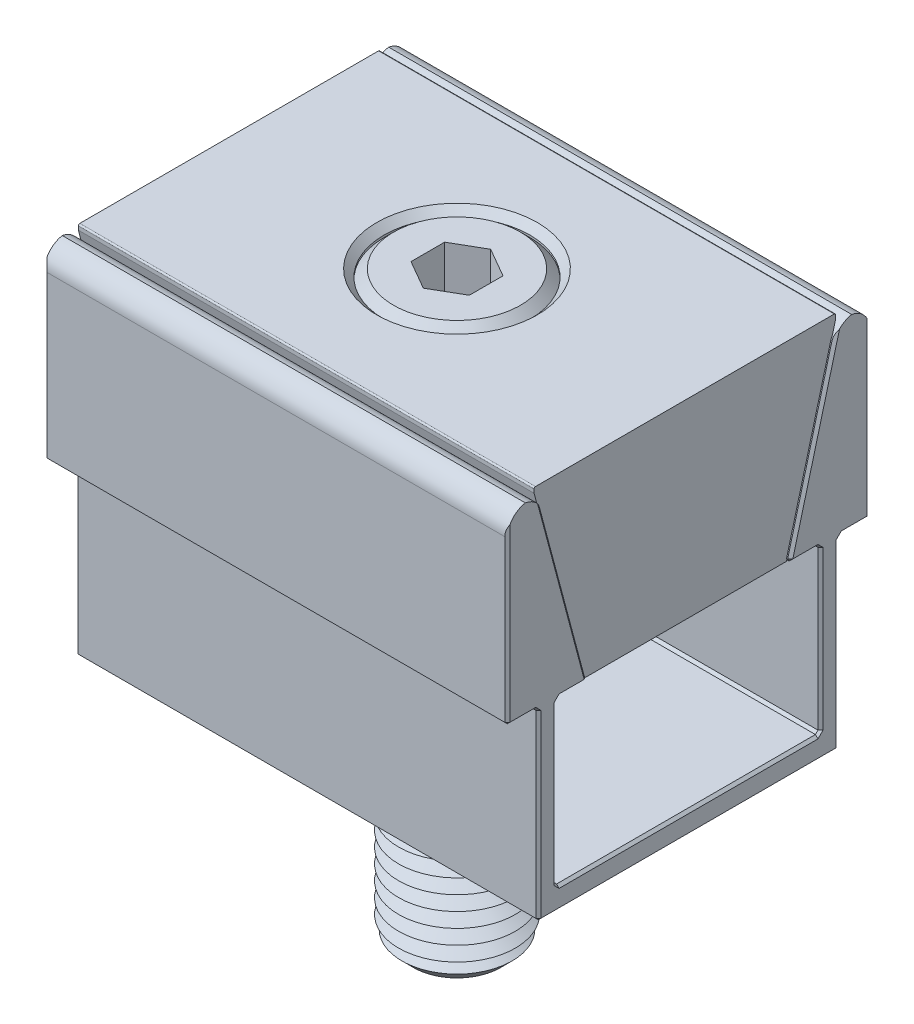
ISO-10303-21;
HEADER;
FILE_DESCRIPTION(('STEP AP214'),'2;1');
FILE_NAME('part.step','',(''),(''),'','','');
FILE_SCHEMA(('AUTOMOTIVE_DESIGN { 1 0 10303 214 1 1 1 1 }'));
ENDSEC;
DATA;
#1=APPLICATION_CONTEXT('core data for automotive mechanical design processes');
#2=APPLICATION_PROTOCOL_DEFINITION('international standard','automotive_design',2000,#1);
#3=PRODUCT_CONTEXT('',#1,'mechanical');
#4=PRODUCT('Part','Part','',(#3));
#5=PRODUCT_RELATED_PRODUCT_CATEGORY('part','',(#4));
#6=PRODUCT_DEFINITION_FORMATION('','',#4);
#7=PRODUCT_DEFINITION_CONTEXT('part definition',#1,'design');
#8=PRODUCT_DEFINITION('design','',#6,#7);
#9=PRODUCT_DEFINITION_SHAPE('','',#8);
#10=(LENGTH_UNIT() NAMED_UNIT(*) SI_UNIT(.MILLI.,.METRE.));
#11=(NAMED_UNIT(*) PLANE_ANGLE_UNIT() SI_UNIT($,.RADIAN.));
#12=(NAMED_UNIT(*) SI_UNIT($,.STERADIAN.) SOLID_ANGLE_UNIT());
#13=UNCERTAINTY_MEASURE_WITH_UNIT(LENGTH_MEASURE(1.E-05),#10,'distance_accuracy_value','');
#14=(GEOMETRIC_REPRESENTATION_CONTEXT(3) GLOBAL_UNCERTAINTY_ASSIGNED_CONTEXT((#13)) GLOBAL_UNIT_ASSIGNED_CONTEXT((#10,
#11,#12)) REPRESENTATION_CONTEXT('',''));
#15=CARTESIAN_POINT('',(0.,0.,0.));
#16=DIRECTION('',(0.,0.,1.));
#17=DIRECTION('',(1.,0.,0.));
#18=AXIS2_PLACEMENT_3D('',#15,#16,#17);
#19=CARTESIAN_POINT('',(0.,45.5,0.));
#20=DIRECTION('',(0.,1.,0.));
#21=DIRECTION('',(0.,0.,1.));
#22=AXIS2_PLACEMENT_3D('',#19,#20,#21);
#23=PLANE('',#22);
#24=CARTESIAN_POINT('',(0.,45.5,0.));
#25=DIRECTION('',(0.,1.,0.));
#26=DIRECTION('',(0.,0.,1.));
#27=AXIS2_PLACEMENT_3D('',#24,#25,#26);
#28=CIRCLE('',#27,4.);
#29=CARTESIAN_POINT('',(2.,45.5,3.46410161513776));
#30=VERTEX_POINT('',#29);
#31=CARTESIAN_POINT('',(4.,45.5,0.));
#32=VERTEX_POINT('',#31);
#33=EDGE_CURVE('P0_E94',#30,#32,#28,.T.);
#34=ORIENTED_EDGE('',*,*,#33,.F.);
#35=DIRECTION('',(0.866025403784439,0.,-0.5));
#36=VECTOR('',#35,1.);
#37=CARTESIAN_POINT('',(0.,45.5,4.61880215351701));
#38=LINE('',#37,#36);
#39=CARTESIAN_POINT('',(4.,45.5,2.30940107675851));
#40=VERTEX_POINT('',#39);
#41=EDGE_CURVE('P0_E117',#30,#40,#38,.T.);
#42=ORIENTED_EDGE('',*,*,#41,.T.);
#43=DIRECTION('',(0.,0.,-1.));
#44=VECTOR('',#43,1.);
#45=CARTESIAN_POINT('',(4.,45.5,2.30940107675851));
#46=LINE('',#45,#44);
#47=EDGE_CURVE('P0_E113',#40,#32,#46,.T.);
#48=ORIENTED_EDGE('',*,*,#47,.T.);
#49=EDGE_LOOP('',(#34,#42,#48));
#50=FACE_BOUND('',#49,.T.);
#51=ADVANCED_FACE('P0_F16',(#50),#23,.T.);
#52=CARTESIAN_POINT('',(0.,45.5,0.));
#53=DIRECTION('',(0.,1.,0.));
#54=DIRECTION('',(0.,0.,1.));
#55=AXIS2_PLACEMENT_3D('',#52,#53,#54);
#56=CIRCLE('',#55,4.);
#57=CARTESIAN_POINT('',(2.,45.5,-3.46410161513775));
#58=VERTEX_POINT('',#57);
#59=EDGE_CURVE('P0_E11',#32,#58,#56,.T.);
#60=ORIENTED_EDGE('',*,*,#59,.F.);
#61=CARTESIAN_POINT('',(4.,45.5,-2.3094010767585));
#62=VERTEX_POINT('',#61);
#63=EDGE_CURVE('P0_E105',#32,#62,#46,.T.);
#64=ORIENTED_EDGE('',*,*,#63,.T.);
#65=DIRECTION('',(-0.866025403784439,0.,-0.5));
#66=VECTOR('',#65,1.);
#67=CARTESIAN_POINT('',(4.,45.5,-2.3094010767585));
#68=LINE('',#67,#66);
#69=EDGE_CURVE('P0_E108',#62,#58,#68,.T.);
#70=ORIENTED_EDGE('',*,*,#69,.T.);
#71=EDGE_LOOP('',(#60,#64,#70));
#72=FACE_BOUND('',#71,.T.);
#73=ADVANCED_FACE('P0_F104',(#72),#23,.T.);
#74=CARTESIAN_POINT('',(-2.,45.5,-3.46410161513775));
#75=VERTEX_POINT('',#74);
#76=EDGE_CURVE('P0_E25',#58,#75,#56,.T.);
#77=ORIENTED_EDGE('',*,*,#76,.F.);
#78=CARTESIAN_POINT('',(0.,45.5,-4.61880215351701));
#79=VERTEX_POINT('',#78);
#80=EDGE_CURVE('P0_E140',#58,#79,#68,.T.);
#81=ORIENTED_EDGE('',*,*,#80,.T.);
#82=DIRECTION('',(-0.866025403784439,0.,0.5));
#83=VECTOR('',#82,1.);
#84=CARTESIAN_POINT('',(0.,45.5,-4.61880215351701));
#85=LINE('',#84,#83);
#86=EDGE_CURVE('P0_E378',#79,#75,#85,.T.);
#87=ORIENTED_EDGE('',*,*,#86,.T.);
#88=EDGE_LOOP('',(#77,#81,#87));
#89=FACE_BOUND('',#88,.T.);
#90=ADVANCED_FACE('P0_F380',(#89),#23,.T.);
#91=CARTESIAN_POINT('',(-4.,45.5,0.));
#92=VERTEX_POINT('',#91);
#93=EDGE_CURVE('P0_E362',#75,#92,#56,.T.);
#94=ORIENTED_EDGE('',*,*,#93,.F.);
#95=CARTESIAN_POINT('',(-4.,45.5,-2.3094010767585));
#96=VERTEX_POINT('',#95);
#97=EDGE_CURVE('P0_E371',#75,#96,#85,.T.);
#98=ORIENTED_EDGE('',*,*,#97,.T.);
#99=DIRECTION('',(0.,0.,1.));
#100=VECTOR('',#99,1.);
#101=CARTESIAN_POINT('',(-4.,45.5,-2.3094010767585));
#102=LINE('',#101,#100);
#103=EDGE_CURVE('P0_E374',#96,#92,#102,.T.);
#104=ORIENTED_EDGE('',*,*,#103,.T.);
#105=EDGE_LOOP('',(#94,#98,#104));
#106=FACE_BOUND('',#105,.T.);
#107=ADVANCED_FACE('P0_F370',(#106),#23,.T.);
#108=CARTESIAN_POINT('',(-2.,45.5,3.46410161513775));
#109=VERTEX_POINT('',#108);
#110=EDGE_CURVE('P0_E32',#92,#109,#56,.T.);
#111=ORIENTED_EDGE('',*,*,#110,.F.);
#112=CARTESIAN_POINT('',(-4.,45.5,2.3094010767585));
#113=VERTEX_POINT('',#112);
#114=EDGE_CURVE('P0_E381',#92,#113,#102,.T.);
#115=ORIENTED_EDGE('',*,*,#114,.T.);
#116=DIRECTION('',(0.866025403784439,0.,0.5));
#117=VECTOR('',#116,1.);
#118=CARTESIAN_POINT('',(-4.,45.5,2.3094010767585));
#119=LINE('',#118,#117);
#120=EDGE_CURVE('P0_E385',#113,#109,#119,.T.);
#121=ORIENTED_EDGE('',*,*,#120,.T.);
#122=EDGE_LOOP('',(#111,#115,#121));
#123=FACE_BOUND('',#122,.T.);
#124=ADVANCED_FACE('P0_F425',(#123),#23,.T.);
#125=CARTESIAN_POINT('',(0.,51.5,0.));
#126=DIRECTION('',(0.,1.,0.));
#127=DIRECTION('',(0.,0.,1.));
#128=AXIS2_PLACEMENT_3D('',#125,#126,#127);
#129=PLANE('',#128);
#130=DIRECTION('',(-0.866025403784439,0.,-0.5));
#131=VECTOR('',#130,1.);
#132=CARTESIAN_POINT('',(4.,51.5,-2.3094010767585));
#133=LINE('',#132,#131);
#134=CARTESIAN_POINT('',(4.,51.5,-2.3094010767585));
#135=VERTEX_POINT('',#134);
#136=CARTESIAN_POINT('',(0.,51.5,-4.61880215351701));
#137=VERTEX_POINT('',#136);
#138=EDGE_CURVE('P0_E40',#135,#137,#133,.T.);
#139=ORIENTED_EDGE('',*,*,#138,.F.);
#140=DIRECTION('',(0.,0.,-1.));
#141=VECTOR('',#140,1.);
#142=CARTESIAN_POINT('',(4.,51.5,2.30940107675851));
#143=LINE('',#142,#141);
#144=CARTESIAN_POINT('',(4.,51.5,2.30940107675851));
#145=VERTEX_POINT('',#144);
#146=EDGE_CURVE('P0_E138',#145,#135,#143,.T.);
#147=ORIENTED_EDGE('',*,*,#146,.F.);
#148=DIRECTION('',(0.866025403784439,0.,-0.5));
#149=VECTOR('',#148,1.);
#150=CARTESIAN_POINT('',(0.,51.5,4.61880215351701));
#151=LINE('',#150,#149);
#152=CARTESIAN_POINT('',(0.,51.5,4.61880215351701));
#153=VERTEX_POINT('',#152);
#154=EDGE_CURVE('P0_E135',#153,#145,#151,.T.);
#155=ORIENTED_EDGE('',*,*,#154,.F.);
#156=DIRECTION('',(0.866025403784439,0.,0.5));
#157=VECTOR('',#156,1.);
#158=CARTESIAN_POINT('',(-4.,51.5,2.3094010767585));
#159=LINE('',#158,#157);
#160=CARTESIAN_POINT('',(-4.,51.5,2.3094010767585));
#161=VERTEX_POINT('',#160);
#162=EDGE_CURVE('P0_E132',#161,#153,#159,.T.);
#163=ORIENTED_EDGE('',*,*,#162,.F.);
#164=DIRECTION('',(0.,0.,1.));
#165=VECTOR('',#164,1.);
#166=CARTESIAN_POINT('',(-4.,51.5,-2.3094010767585));
#167=LINE('',#166,#165);
#168=CARTESIAN_POINT('',(-4.,51.5,-2.3094010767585));
#169=VERTEX_POINT('',#168);
#170=EDGE_CURVE('P0_E129',#169,#161,#167,.T.);
#171=ORIENTED_EDGE('',*,*,#170,.F.);
#172=DIRECTION('',(-0.866025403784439,0.,0.5));
#173=VECTOR('',#172,1.);
#174=CARTESIAN_POINT('',(0.,51.5,-4.61880215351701));
#175=LINE('',#174,#173);
#176=EDGE_CURVE('P0_E126',#137,#169,#175,.T.);
#177=ORIENTED_EDGE('',*,*,#176,.F.);
#178=EDGE_LOOP('',(#139,#147,#155,#163,#171,#177));
#179=FACE_BOUND('',#178,.T.);
#180=CARTESIAN_POINT('',(0.,51.5,0.));
#181=DIRECTION('',(0.,1.,0.));
#182=DIRECTION('',(0.,0.,1.));
#183=AXIS2_PLACEMENT_3D('',#180,#181,#182);
#184=CIRCLE('',#183,8.70000000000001);
#185=CARTESIAN_POINT('',(0.,51.5,-8.70000000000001));
#186=VERTEX_POINT('',#185);
#187=EDGE_CURVE('P0_E354',#186,#186,#184,.T.);
#188=ORIENTED_EDGE('',*,*,#187,.T.);
#189=EDGE_LOOP('',(#188));
#190=FACE_BOUND('',#189,.T.);
#191=ADVANCED_FACE('P0_F403',(#179,#190),#129,.T.);
#192=CARTESIAN_POINT('',(0.,111.747633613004,0.));
#193=DIRECTION('',(0.,1.,0.));
#194=DIRECTION('',(0.,0.,1.));
#195=AXIS2_PLACEMENT_3D('',#192,#193,#194);
#196=CYLINDRICAL_SURFACE('',#195,10.);
#197=CARTESIAN_POINT('',(0.,50.2,0.));
#198=DIRECTION('',(0.,1.,0.));
#199=DIRECTION('',(0.,0.,1.));
#200=AXIS2_PLACEMENT_3D('',#197,#198,#199);
#201=CIRCLE('',#200,10.);
#202=CARTESIAN_POINT('',(0.,50.2,-10.));
#203=VERTEX_POINT('',#202);
#204=EDGE_CURVE('P0_E358',#203,#203,#201,.F.);
#205=ORIENTED_EDGE('',*,*,#204,.T.);
#206=EDGE_LOOP('',(#205));
#207=FACE_BOUND('',#206,.T.);
#208=CARTESIAN_POINT('',(0.,38.8,0.));
#209=DIRECTION('',(0.,1.,0.));
#210=DIRECTION('',(0.,0.,1.));
#211=AXIS2_PLACEMENT_3D('',#208,#209,#210);
#212=CIRCLE('',#211,10.);
#213=CARTESIAN_POINT('',(0.,38.8,10.));
#214=VERTEX_POINT('',#213);
#215=EDGE_CURVE('P0_E348',#214,#214,#212,.T.);
#216=ORIENTED_EDGE('',*,*,#215,.T.);
#217=EDGE_LOOP('',(#216));
#218=FACE_BOUND('',#217,.T.);
#219=ADVANCED_FACE('P0_F435',(#207,#218),#196,.T.);
#220=CARTESIAN_POINT('',(0.,38.8,10.));
#221=DIRECTION('',(0.,-1.,0.));
#222=DIRECTION('',(0.,0.,-1.));
#223=AXIS2_PLACEMENT_3D('',#220,#221,#222);
#224=PLANE('',#223);
#225=CARTESIAN_POINT('',(0.,38.8,0.));
#226=DIRECTION('',(0.,1.,0.));
#227=DIRECTION('',(0.,0.,1.));
#228=AXIS2_PLACEMENT_3D('',#225,#226,#227);
#229=CIRCLE('',#228,8.);
#230=CARTESIAN_POINT('',(0.,38.8,8.));
#231=VERTEX_POINT('',#230);
#232=EDGE_CURVE('P0_E345',#231,#231,#229,.T.);
#233=ORIENTED_EDGE('',*,*,#232,.T.);
#234=EDGE_LOOP('',(#233));
#235=FACE_BOUND('',#234,.T.);
#236=ORIENTED_EDGE('',*,*,#215,.F.);
#237=EDGE_LOOP('',(#236));
#238=FACE_BOUND('',#237,.T.);
#239=ADVANCED_FACE('P0_F1108',(#235,#238),#224,.T.);
#240=CARTESIAN_POINT('',(0.,37.8,0.));
#241=DIRECTION('',(0.,1.,0.));
#242=DIRECTION('',(0.,0.,1.));
#243=AXIS2_PLACEMENT_3D('',#240,#241,#242);
#244=CONICAL_SURFACE('',#243,6.26794919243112,1.0471975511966);
#245=ORIENTED_EDGE('',*,*,#232,.F.);
#246=EDGE_LOOP('',(#245));
#247=FACE_BOUND('',#246,.T.);
#248=CARTESIAN_POINT('',(0.,37.8,0.));
#249=DIRECTION('',(0.,1.,0.));
#250=DIRECTION('',(0.,0.,1.));
#251=AXIS2_PLACEMENT_3D('',#248,#249,#250);
#252=CIRCLE('',#251,6.26794919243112);
#253=CARTESIAN_POINT('',(0.,37.8,6.26794919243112));
#254=VERTEX_POINT('',#253);
#255=EDGE_CURVE('P0_E342',#254,#254,#252,.T.);
#256=ORIENTED_EDGE('',*,*,#255,.T.);
#257=EDGE_LOOP('',(#256));
#258=FACE_BOUND('',#257,.T.);
#259=ADVANCED_FACE('P0_F1099',(#247,#258),#244,.T.);
#260=CARTESIAN_POINT('',(0.,36.8,0.));
#261=DIRECTION('',(0.,-1.,0.));
#262=DIRECTION('',(0.,0.,-1.));
#263=AXIS2_PLACEMENT_3D('',#260,#261,#262);
#264=CONICAL_SURFACE('',#263,8.,1.0471975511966);
#265=ORIENTED_EDGE('',*,*,#255,.F.);
#266=EDGE_LOOP('',(#265));
#267=FACE_BOUND('',#266,.T.);
#268=CARTESIAN_POINT('',(0.,36.8,0.));
#269=DIRECTION('',(0.,1.,0.));
#270=DIRECTION('',(0.,0.,1.));
#271=AXIS2_PLACEMENT_3D('',#268,#269,#270);
#272=CIRCLE('',#271,8.);
#273=CARTESIAN_POINT('',(0.,36.8,8.));
#274=VERTEX_POINT('',#273);
#275=EDGE_CURVE('P0_E339',#274,#274,#272,.T.);
#276=ORIENTED_EDGE('',*,*,#275,.T.);
#277=EDGE_LOOP('',(#276));
#278=FACE_BOUND('',#277,.T.);
#279=ADVANCED_FACE('P0_F1090',(#267,#278),#264,.T.);
#280=CARTESIAN_POINT('',(0.,35.8,0.));
#281=DIRECTION('',(0.,1.,0.));
#282=DIRECTION('',(0.,0.,1.));
#283=AXIS2_PLACEMENT_3D('',#280,#281,#282);
#284=CONICAL_SURFACE('',#283,6.26794919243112,1.0471975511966);
#285=ORIENTED_EDGE('',*,*,#275,.F.);
#286=EDGE_LOOP('',(#285));
#287=FACE_BOUND('',#286,.T.);
#288=CARTESIAN_POINT('',(0.,35.8,0.));
#289=DIRECTION('',(0.,1.,0.));
#290=DIRECTION('',(0.,0.,1.));
#291=AXIS2_PLACEMENT_3D('',#288,#289,#290);
#292=CIRCLE('',#291,6.26794919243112);
#293=CARTESIAN_POINT('',(0.,35.8,6.26794919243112));
#294=VERTEX_POINT('',#293);
#295=EDGE_CURVE('P0_E336',#294,#294,#292,.T.);
#296=ORIENTED_EDGE('',*,*,#295,.T.);
#297=EDGE_LOOP('',(#296));
#298=FACE_BOUND('',#297,.T.);
#299=ADVANCED_FACE('P0_F1081',(#287,#298),#284,.T.);
#300=CARTESIAN_POINT('',(0.,34.8,0.));
#301=DIRECTION('',(0.,-1.,0.));
#302=DIRECTION('',(0.,0.,-1.));
#303=AXIS2_PLACEMENT_3D('',#300,#301,#302);
#304=CONICAL_SURFACE('',#303,8.,1.0471975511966);
#305=ORIENTED_EDGE('',*,*,#295,.F.);
#306=EDGE_LOOP('',(#305));
#307=FACE_BOUND('',#306,.T.);
#308=CARTESIAN_POINT('',(0.,34.8,0.));
#309=DIRECTION('',(0.,1.,0.));
#310=DIRECTION('',(0.,0.,1.));
#311=AXIS2_PLACEMENT_3D('',#308,#309,#310);
#312=CIRCLE('',#311,8.);
#313=CARTESIAN_POINT('',(0.,34.8,8.));
#314=VERTEX_POINT('',#313);
#315=EDGE_CURVE('P0_E333',#314,#314,#312,.T.);
#316=ORIENTED_EDGE('',*,*,#315,.T.);
#317=EDGE_LOOP('',(#316));
#318=FACE_BOUND('',#317,.T.);
#319=ADVANCED_FACE('P0_F1072',(#307,#318),#304,.T.);
#320=CARTESIAN_POINT('',(0.,33.8,0.));
#321=DIRECTION('',(0.,1.,0.));
#322=DIRECTION('',(0.,0.,1.));
#323=AXIS2_PLACEMENT_3D('',#320,#321,#322);
#324=CONICAL_SURFACE('',#323,6.26794919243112,1.0471975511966);
#325=ORIENTED_EDGE('',*,*,#315,.F.);
#326=EDGE_LOOP('',(#325));
#327=FACE_BOUND('',#326,.T.);
#328=CARTESIAN_POINT('',(0.,33.8,0.));
#329=DIRECTION('',(0.,1.,0.));
#330=DIRECTION('',(0.,0.,1.));
#331=AXIS2_PLACEMENT_3D('',#328,#329,#330);
#332=CIRCLE('',#331,6.26794919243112);
#333=CARTESIAN_POINT('',(0.,33.8,6.26794919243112));
#334=VERTEX_POINT('',#333);
#335=EDGE_CURVE('P0_E330',#334,#334,#332,.T.);
#336=ORIENTED_EDGE('',*,*,#335,.T.);
#337=EDGE_LOOP('',(#336));
#338=FACE_BOUND('',#337,.T.);
#339=ADVANCED_FACE('P0_F1063',(#327,#338),#324,.T.);
#340=CARTESIAN_POINT('',(0.,32.8,0.));
#341=DIRECTION('',(0.,-1.,0.));
#342=DIRECTION('',(0.,0.,-1.));
#343=AXIS2_PLACEMENT_3D('',#340,#341,#342);
#344=CONICAL_SURFACE('',#343,8.,1.0471975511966);
#345=ORIENTED_EDGE('',*,*,#335,.F.);
#346=EDGE_LOOP('',(#345));
#347=FACE_BOUND('',#346,.T.);
#348=CARTESIAN_POINT('',(0.,32.8,0.));
#349=DIRECTION('',(0.,1.,0.));
#350=DIRECTION('',(0.,0.,1.));
#351=AXIS2_PLACEMENT_3D('',#348,#349,#350);
#352=CIRCLE('',#351,8.);
#353=CARTESIAN_POINT('',(0.,32.8,8.));
#354=VERTEX_POINT('',#353);
#355=EDGE_CURVE('P0_E327',#354,#354,#352,.T.);
#356=ORIENTED_EDGE('',*,*,#355,.T.);
#357=EDGE_LOOP('',(#356));
#358=FACE_BOUND('',#357,.T.);
#359=ADVANCED_FACE('P0_F1054',(#347,#358),#344,.T.);
#360=CARTESIAN_POINT('',(0.,31.8,0.));
#361=DIRECTION('',(0.,1.,0.));
#362=DIRECTION('',(0.,0.,1.));
#363=AXIS2_PLACEMENT_3D('',#360,#361,#362);
#364=CONICAL_SURFACE('',#363,6.26794919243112,1.0471975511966);
#365=ORIENTED_EDGE('',*,*,#355,.F.);
#366=EDGE_LOOP('',(#365));
#367=FACE_BOUND('',#366,.T.);
#368=CARTESIAN_POINT('',(0.,31.8,0.));
#369=DIRECTION('',(0.,1.,0.));
#370=DIRECTION('',(0.,0.,1.));
#371=AXIS2_PLACEMENT_3D('',#368,#369,#370);
#372=CIRCLE('',#371,6.26794919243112);
#373=CARTESIAN_POINT('',(0.,31.8,6.26794919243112));
#374=VERTEX_POINT('',#373);
#375=EDGE_CURVE('P0_E324',#374,#374,#372,.T.);
#376=ORIENTED_EDGE('',*,*,#375,.T.);
#377=EDGE_LOOP('',(#376));
#378=FACE_BOUND('',#377,.T.);
#379=ADVANCED_FACE('P0_F1045',(#367,#378),#364,.T.);
#380=CARTESIAN_POINT('',(0.,30.8,0.));
#381=DIRECTION('',(0.,-1.,0.));
#382=DIRECTION('',(0.,0.,-1.));
#383=AXIS2_PLACEMENT_3D('',#380,#381,#382);
#384=CONICAL_SURFACE('',#383,8.,1.0471975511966);
#385=ORIENTED_EDGE('',*,*,#375,.F.);
#386=EDGE_LOOP('',(#385));
#387=FACE_BOUND('',#386,.T.);
#388=CARTESIAN_POINT('',(0.,30.8,0.));
#389=DIRECTION('',(0.,1.,0.));
#390=DIRECTION('',(0.,0.,1.));
#391=AXIS2_PLACEMENT_3D('',#388,#389,#390);
#392=CIRCLE('',#391,8.);
#393=CARTESIAN_POINT('',(0.,30.8,8.));
#394=VERTEX_POINT('',#393);
#395=EDGE_CURVE('P0_E321',#394,#394,#392,.T.);
#396=ORIENTED_EDGE('',*,*,#395,.T.);
#397=EDGE_LOOP('',(#396));
#398=FACE_BOUND('',#397,.T.);
#399=ADVANCED_FACE('P0_F1036',(#387,#398),#384,.T.);
#400=CARTESIAN_POINT('',(0.,29.8,0.));
#401=DIRECTION('',(0.,1.,0.));
#402=DIRECTION('',(0.,0.,1.));
#403=AXIS2_PLACEMENT_3D('',#400,#401,#402);
#404=CONICAL_SURFACE('',#403,6.26794919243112,1.0471975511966);
#405=ORIENTED_EDGE('',*,*,#395,.F.);
#406=EDGE_LOOP('',(#405));
#407=FACE_BOUND('',#406,.T.);
#408=CARTESIAN_POINT('',(0.,29.8,0.));
#409=DIRECTION('',(0.,1.,0.));
#410=DIRECTION('',(0.,0.,1.));
#411=AXIS2_PLACEMENT_3D('',#408,#409,#410);
#412=CIRCLE('',#411,6.26794919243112);
#413=CARTESIAN_POINT('',(0.,29.8,6.26794919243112));
#414=VERTEX_POINT('',#413);
#415=EDGE_CURVE('P0_E318',#414,#414,#412,.T.);
#416=ORIENTED_EDGE('',*,*,#415,.T.);
#417=EDGE_LOOP('',(#416));
#418=FACE_BOUND('',#417,.T.);
#419=ADVANCED_FACE('P0_F1027',(#407,#418),#404,.T.);
#420=CARTESIAN_POINT('',(0.,28.8,0.));
#421=DIRECTION('',(0.,-1.,0.));
#422=DIRECTION('',(0.,0.,-1.));
#423=AXIS2_PLACEMENT_3D('',#420,#421,#422);
#424=CONICAL_SURFACE('',#423,8.,1.0471975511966);
#425=ORIENTED_EDGE('',*,*,#415,.F.);
#426=EDGE_LOOP('',(#425));
#427=FACE_BOUND('',#426,.T.);
#428=CARTESIAN_POINT('',(0.,28.8,0.));
#429=DIRECTION('',(0.,1.,0.));
#430=DIRECTION('',(0.,0.,1.));
#431=AXIS2_PLACEMENT_3D('',#428,#429,#430);
#432=CIRCLE('',#431,8.);
#433=CARTESIAN_POINT('',(0.,28.8,8.));
#434=VERTEX_POINT('',#433);
#435=EDGE_CURVE('P0_E315',#434,#434,#432,.T.);
#436=ORIENTED_EDGE('',*,*,#435,.T.);
#437=EDGE_LOOP('',(#436));
#438=FACE_BOUND('',#437,.T.);
#439=ADVANCED_FACE('P0_F1018',(#427,#438),#424,.T.);
#440=CARTESIAN_POINT('',(0.,27.8,0.));
#441=DIRECTION('',(0.,1.,0.));
#442=DIRECTION('',(0.,0.,1.));
#443=AXIS2_PLACEMENT_3D('',#440,#441,#442);
#444=CONICAL_SURFACE('',#443,6.26794919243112,1.0471975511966);
#445=ORIENTED_EDGE('',*,*,#435,.F.);
#446=EDGE_LOOP('',(#445));
#447=FACE_BOUND('',#446,.T.);
#448=CARTESIAN_POINT('',(0.,27.8,0.));
#449=DIRECTION('',(0.,1.,0.));
#450=DIRECTION('',(0.,0.,1.));
#451=AXIS2_PLACEMENT_3D('',#448,#449,#450);
#452=CIRCLE('',#451,6.26794919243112);
#453=CARTESIAN_POINT('',(0.,27.8,6.26794919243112));
#454=VERTEX_POINT('',#453);
#455=EDGE_CURVE('P0_E312',#454,#454,#452,.T.);
#456=ORIENTED_EDGE('',*,*,#455,.T.);
#457=EDGE_LOOP('',(#456));
#458=FACE_BOUND('',#457,.T.);
#459=ADVANCED_FACE('P0_F1009',(#447,#458),#444,.T.);
#460=CARTESIAN_POINT('',(0.,26.8,0.));
#461=DIRECTION('',(0.,-1.,0.));
#462=DIRECTION('',(0.,0.,-1.));
#463=AXIS2_PLACEMENT_3D('',#460,#461,#462);
#464=CONICAL_SURFACE('',#463,8.,1.0471975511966);
#465=ORIENTED_EDGE('',*,*,#455,.F.);
#466=EDGE_LOOP('',(#465));
#467=FACE_BOUND('',#466,.T.);
#468=CARTESIAN_POINT('',(0.,26.8,0.));
#469=DIRECTION('',(0.,1.,0.));
#470=DIRECTION('',(0.,0.,1.));
#471=AXIS2_PLACEMENT_3D('',#468,#469,#470);
#472=CIRCLE('',#471,8.);
#473=CARTESIAN_POINT('',(0.,26.8,8.));
#474=VERTEX_POINT('',#473);
#475=EDGE_CURVE('P0_E309',#474,#474,#472,.T.);
#476=ORIENTED_EDGE('',*,*,#475,.T.);
#477=EDGE_LOOP('',(#476));
#478=FACE_BOUND('',#477,.T.);
#479=ADVANCED_FACE('P0_F1000',(#467,#478),#464,.T.);
#480=CARTESIAN_POINT('',(0.,25.8,0.));
#481=DIRECTION('',(0.,1.,0.));
#482=DIRECTION('',(0.,0.,1.));
#483=AXIS2_PLACEMENT_3D('',#480,#481,#482);
#484=CONICAL_SURFACE('',#483,6.26794919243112,1.0471975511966);
#485=ORIENTED_EDGE('',*,*,#475,.F.);
#486=EDGE_LOOP('',(#485));
#487=FACE_BOUND('',#486,.T.);
#488=CARTESIAN_POINT('',(0.,25.8,0.));
#489=DIRECTION('',(0.,1.,0.));
#490=DIRECTION('',(0.,0.,1.));
#491=AXIS2_PLACEMENT_3D('',#488,#489,#490);
#492=CIRCLE('',#491,6.26794919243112);
#493=CARTESIAN_POINT('',(0.,25.8,6.26794919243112));
#494=VERTEX_POINT('',#493);
#495=EDGE_CURVE('P0_E306',#494,#494,#492,.T.);
#496=ORIENTED_EDGE('',*,*,#495,.T.);
#497=EDGE_LOOP('',(#496));
#498=FACE_BOUND('',#497,.T.);
#499=ADVANCED_FACE('P0_F991',(#487,#498),#484,.T.);
#500=CARTESIAN_POINT('',(0.,24.8,0.));
#501=DIRECTION('',(0.,-1.,0.));
#502=DIRECTION('',(0.,0.,-1.));
#503=AXIS2_PLACEMENT_3D('',#500,#501,#502);
#504=CONICAL_SURFACE('',#503,8.,1.0471975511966);
#505=ORIENTED_EDGE('',*,*,#495,.F.);
#506=EDGE_LOOP('',(#505));
#507=FACE_BOUND('',#506,.T.);
#508=CARTESIAN_POINT('',(0.,24.8,0.));
#509=DIRECTION('',(0.,1.,0.));
#510=DIRECTION('',(0.,0.,1.));
#511=AXIS2_PLACEMENT_3D('',#508,#509,#510);
#512=CIRCLE('',#511,8.);
#513=CARTESIAN_POINT('',(0.,24.8,8.));
#514=VERTEX_POINT('',#513);
#515=EDGE_CURVE('P0_E303',#514,#514,#512,.T.);
#516=ORIENTED_EDGE('',*,*,#515,.T.);
#517=EDGE_LOOP('',(#516));
#518=FACE_BOUND('',#517,.T.);
#519=ADVANCED_FACE('P0_F982',(#507,#518),#504,.T.);
#520=CARTESIAN_POINT('',(0.,23.8,0.));
#521=DIRECTION('',(0.,1.,0.));
#522=DIRECTION('',(0.,0.,1.));
#523=AXIS2_PLACEMENT_3D('',#520,#521,#522);
#524=CONICAL_SURFACE('',#523,6.26794919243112,1.0471975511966);
#525=ORIENTED_EDGE('',*,*,#515,.F.);
#526=EDGE_LOOP('',(#525));
#527=FACE_BOUND('',#526,.T.);
#528=CARTESIAN_POINT('',(0.,23.8,0.));
#529=DIRECTION('',(0.,1.,0.));
#530=DIRECTION('',(0.,0.,1.));
#531=AXIS2_PLACEMENT_3D('',#528,#529,#530);
#532=CIRCLE('',#531,6.26794919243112);
#533=CARTESIAN_POINT('',(0.,23.8,6.26794919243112));
#534=VERTEX_POINT('',#533);
#535=EDGE_CURVE('P0_E300',#534,#534,#532,.T.);
#536=ORIENTED_EDGE('',*,*,#535,.T.);
#537=EDGE_LOOP('',(#536));
#538=FACE_BOUND('',#537,.T.);
#539=ADVANCED_FACE('P0_F973',(#527,#538),#524,.T.);
#540=CARTESIAN_POINT('',(0.,22.8,0.));
#541=DIRECTION('',(0.,-1.,0.));
#542=DIRECTION('',(0.,0.,-1.));
#543=AXIS2_PLACEMENT_3D('',#540,#541,#542);
#544=CONICAL_SURFACE('',#543,8.,1.0471975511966);
#545=ORIENTED_EDGE('',*,*,#535,.F.);
#546=EDGE_LOOP('',(#545));
#547=FACE_BOUND('',#546,.T.);
#548=CARTESIAN_POINT('',(0.,22.8,0.));
#549=DIRECTION('',(0.,1.,0.));
#550=DIRECTION('',(0.,0.,1.));
#551=AXIS2_PLACEMENT_3D('',#548,#549,#550);
#552=CIRCLE('',#551,8.);
#553=CARTESIAN_POINT('',(0.,22.8,8.));
#554=VERTEX_POINT('',#553);
#555=EDGE_CURVE('P0_E297',#554,#554,#552,.T.);
#556=ORIENTED_EDGE('',*,*,#555,.T.);
#557=EDGE_LOOP('',(#556));
#558=FACE_BOUND('',#557,.T.);
#559=ADVANCED_FACE('P0_F964',(#547,#558),#544,.T.);
#560=CARTESIAN_POINT('',(0.,21.8,0.));
#561=DIRECTION('',(0.,1.,0.));
#562=DIRECTION('',(0.,0.,1.));
#563=AXIS2_PLACEMENT_3D('',#560,#561,#562);
#564=CONICAL_SURFACE('',#563,6.26794919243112,1.0471975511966);
#565=ORIENTED_EDGE('',*,*,#555,.F.);
#566=EDGE_LOOP('',(#565));
#567=FACE_BOUND('',#566,.T.);
#568=CARTESIAN_POINT('',(0.,21.8,0.));
#569=DIRECTION('',(0.,1.,0.));
#570=DIRECTION('',(0.,0.,1.));
#571=AXIS2_PLACEMENT_3D('',#568,#569,#570);
#572=CIRCLE('',#571,6.26794919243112);
#573=CARTESIAN_POINT('',(0.,21.8,6.26794919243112));
#574=VERTEX_POINT('',#573);
#575=EDGE_CURVE('P0_E294',#574,#574,#572,.T.);
#576=ORIENTED_EDGE('',*,*,#575,.T.);
#577=EDGE_LOOP('',(#576));
#578=FACE_BOUND('',#577,.T.);
#579=ADVANCED_FACE('P0_F955',(#567,#578),#564,.T.);
#580=CARTESIAN_POINT('',(0.,20.8,0.));
#581=DIRECTION('',(0.,-1.,0.));
#582=DIRECTION('',(0.,0.,-1.));
#583=AXIS2_PLACEMENT_3D('',#580,#581,#582);
#584=CONICAL_SURFACE('',#583,8.,1.0471975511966);
#585=ORIENTED_EDGE('',*,*,#575,.F.);
#586=EDGE_LOOP('',(#585));
#587=FACE_BOUND('',#586,.T.);
#588=CARTESIAN_POINT('',(0.,20.8,0.));
#589=DIRECTION('',(0.,1.,0.));
#590=DIRECTION('',(0.,0.,1.));
#591=AXIS2_PLACEMENT_3D('',#588,#589,#590);
#592=CIRCLE('',#591,8.);
#593=CARTESIAN_POINT('',(0.,20.8,8.));
#594=VERTEX_POINT('',#593);
#595=EDGE_CURVE('P0_E291',#594,#594,#592,.T.);
#596=ORIENTED_EDGE('',*,*,#595,.T.);
#597=EDGE_LOOP('',(#596));
#598=FACE_BOUND('',#597,.T.);
#599=ADVANCED_FACE('P0_F946',(#587,#598),#584,.T.);
#600=CARTESIAN_POINT('',(0.,19.8,0.));
#601=DIRECTION('',(0.,1.,0.));
#602=DIRECTION('',(0.,0.,1.));
#603=AXIS2_PLACEMENT_3D('',#600,#601,#602);
#604=CONICAL_SURFACE('',#603,6.26794919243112,1.0471975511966);
#605=ORIENTED_EDGE('',*,*,#595,.F.);
#606=EDGE_LOOP('',(#605));
#607=FACE_BOUND('',#606,.T.);
#608=CARTESIAN_POINT('',(0.,19.8,0.));
#609=DIRECTION('',(0.,1.,0.));
#610=DIRECTION('',(0.,0.,1.));
#611=AXIS2_PLACEMENT_3D('',#608,#609,#610);
#612=CIRCLE('',#611,6.26794919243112);
#613=CARTESIAN_POINT('',(0.,19.8,6.26794919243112));
#614=VERTEX_POINT('',#613);
#615=EDGE_CURVE('P0_E288',#614,#614,#612,.T.);
#616=ORIENTED_EDGE('',*,*,#615,.T.);
#617=EDGE_LOOP('',(#616));
#618=FACE_BOUND('',#617,.T.);
#619=ADVANCED_FACE('P0_F937',(#607,#618),#604,.T.);
#620=CARTESIAN_POINT('',(0.,18.8,0.));
#621=DIRECTION('',(0.,-1.,0.));
#622=DIRECTION('',(0.,0.,-1.));
#623=AXIS2_PLACEMENT_3D('',#620,#621,#622);
#624=CONICAL_SURFACE('',#623,8.,1.0471975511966);
#625=ORIENTED_EDGE('',*,*,#615,.F.);
#626=EDGE_LOOP('',(#625));
#627=FACE_BOUND('',#626,.T.);
#628=CARTESIAN_POINT('',(0.,18.8,0.));
#629=DIRECTION('',(0.,1.,0.));
#630=DIRECTION('',(0.,0.,1.));
#631=AXIS2_PLACEMENT_3D('',#628,#629,#630);
#632=CIRCLE('',#631,8.);
#633=CARTESIAN_POINT('',(0.,18.8,8.));
#634=VERTEX_POINT('',#633);
#635=EDGE_CURVE('P0_E285',#634,#634,#632,.T.);
#636=ORIENTED_EDGE('',*,*,#635,.T.);
#637=EDGE_LOOP('',(#636));
#638=FACE_BOUND('',#637,.T.);
#639=ADVANCED_FACE('P0_F928',(#627,#638),#624,.T.);
#640=CARTESIAN_POINT('',(0.,17.8,0.));
#641=DIRECTION('',(0.,1.,0.));
#642=DIRECTION('',(0.,0.,1.));
#643=AXIS2_PLACEMENT_3D('',#640,#641,#642);
#644=CONICAL_SURFACE('',#643,6.26794919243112,1.0471975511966);
#645=ORIENTED_EDGE('',*,*,#635,.F.);
#646=EDGE_LOOP('',(#645));
#647=FACE_BOUND('',#646,.T.);
#648=CARTESIAN_POINT('',(0.,17.8,0.));
#649=DIRECTION('',(0.,1.,0.));
#650=DIRECTION('',(0.,0.,1.));
#651=AXIS2_PLACEMENT_3D('',#648,#649,#650);
#652=CIRCLE('',#651,6.26794919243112);
#653=CARTESIAN_POINT('',(0.,17.8,6.26794919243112));
#654=VERTEX_POINT('',#653);
#655=EDGE_CURVE('P0_E282',#654,#654,#652,.T.);
#656=ORIENTED_EDGE('',*,*,#655,.T.);
#657=EDGE_LOOP('',(#656));
#658=FACE_BOUND('',#657,.T.);
#659=ADVANCED_FACE('P0_F919',(#647,#658),#644,.T.);
#660=CARTESIAN_POINT('',(0.,16.8,0.));
#661=DIRECTION('',(0.,-1.,0.));
#662=DIRECTION('',(0.,0.,-1.));
#663=AXIS2_PLACEMENT_3D('',#660,#661,#662);
#664=CONICAL_SURFACE('',#663,8.,1.0471975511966);
#665=ORIENTED_EDGE('',*,*,#655,.F.);
#666=EDGE_LOOP('',(#665));
#667=FACE_BOUND('',#666,.T.);
#668=CARTESIAN_POINT('',(0.,16.8,0.));
#669=DIRECTION('',(0.,1.,0.));
#670=DIRECTION('',(0.,0.,1.));
#671=AXIS2_PLACEMENT_3D('',#668,#669,#670);
#672=CIRCLE('',#671,8.);
#673=CARTESIAN_POINT('',(0.,16.8,8.));
#674=VERTEX_POINT('',#673);
#675=EDGE_CURVE('P0_E279',#674,#674,#672,.T.);
#676=ORIENTED_EDGE('',*,*,#675,.T.);
#677=EDGE_LOOP('',(#676));
#678=FACE_BOUND('',#677,.T.);
#679=ADVANCED_FACE('P0_F910',(#667,#678),#664,.T.);
#680=CARTESIAN_POINT('',(0.,15.8,0.));
#681=DIRECTION('',(0.,1.,0.));
#682=DIRECTION('',(0.,0.,1.));
#683=AXIS2_PLACEMENT_3D('',#680,#681,#682);
#684=CONICAL_SURFACE('',#683,6.26794919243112,1.0471975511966);
#685=ORIENTED_EDGE('',*,*,#675,.F.);
#686=EDGE_LOOP('',(#685));
#687=FACE_BOUND('',#686,.T.);
#688=CARTESIAN_POINT('',(0.,15.8,0.));
#689=DIRECTION('',(0.,1.,0.));
#690=DIRECTION('',(0.,0.,1.));
#691=AXIS2_PLACEMENT_3D('',#688,#689,#690);
#692=CIRCLE('',#691,6.26794919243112);
#693=CARTESIAN_POINT('',(0.,15.8,6.26794919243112));
#694=VERTEX_POINT('',#693);
#695=EDGE_CURVE('P0_E276',#694,#694,#692,.T.);
#696=ORIENTED_EDGE('',*,*,#695,.T.);
#697=EDGE_LOOP('',(#696));
#698=FACE_BOUND('',#697,.T.);
#699=ADVANCED_FACE('P0_F901',(#687,#698),#684,.T.);
#700=CARTESIAN_POINT('',(0.,14.8,0.));
#701=DIRECTION('',(0.,-1.,0.));
#702=DIRECTION('',(0.,0.,-1.));
#703=AXIS2_PLACEMENT_3D('',#700,#701,#702);
#704=CONICAL_SURFACE('',#703,8.,1.0471975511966);
#705=ORIENTED_EDGE('',*,*,#695,.F.);
#706=EDGE_LOOP('',(#705));
#707=FACE_BOUND('',#706,.T.);
#708=CARTESIAN_POINT('',(0.,14.8,0.));
#709=DIRECTION('',(0.,1.,0.));
#710=DIRECTION('',(0.,0.,1.));
#711=AXIS2_PLACEMENT_3D('',#708,#709,#710);
#712=CIRCLE('',#711,8.);
#713=CARTESIAN_POINT('',(0.,14.8,8.));
#714=VERTEX_POINT('',#713);
#715=EDGE_CURVE('P0_E273',#714,#714,#712,.T.);
#716=ORIENTED_EDGE('',*,*,#715,.T.);
#717=EDGE_LOOP('',(#716));
#718=FACE_BOUND('',#717,.T.);
#719=ADVANCED_FACE('P0_F892',(#707,#718),#704,.T.);
#720=CARTESIAN_POINT('',(0.,13.8,0.));
#721=DIRECTION('',(0.,1.,0.));
#722=DIRECTION('',(0.,0.,1.));
#723=AXIS2_PLACEMENT_3D('',#720,#721,#722);
#724=CONICAL_SURFACE('',#723,6.26794919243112,1.0471975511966);
#725=ORIENTED_EDGE('',*,*,#715,.F.);
#726=EDGE_LOOP('',(#725));
#727=FACE_BOUND('',#726,.T.);
#728=CARTESIAN_POINT('',(0.,13.8,0.));
#729=DIRECTION('',(0.,1.,0.));
#730=DIRECTION('',(0.,0.,1.));
#731=AXIS2_PLACEMENT_3D('',#728,#729,#730);
#732=CIRCLE('',#731,6.26794919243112);
#733=CARTESIAN_POINT('',(0.,13.8,6.26794919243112));
#734=VERTEX_POINT('',#733);
#735=EDGE_CURVE('P0_E270',#734,#734,#732,.T.);
#736=ORIENTED_EDGE('',*,*,#735,.T.);
#737=EDGE_LOOP('',(#736));
#738=FACE_BOUND('',#737,.T.);
#739=ADVANCED_FACE('P0_F883',(#727,#738),#724,.T.);
#740=CARTESIAN_POINT('',(0.,12.8,0.));
#741=DIRECTION('',(0.,-1.,0.));
#742=DIRECTION('',(0.,0.,-1.));
#743=AXIS2_PLACEMENT_3D('',#740,#741,#742);
#744=CONICAL_SURFACE('',#743,8.,1.0471975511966);
#745=ORIENTED_EDGE('',*,*,#735,.F.);
#746=EDGE_LOOP('',(#745));
#747=FACE_BOUND('',#746,.T.);
#748=CARTESIAN_POINT('',(0.,12.8,0.));
#749=DIRECTION('',(0.,1.,0.));
#750=DIRECTION('',(0.,0.,1.));
#751=AXIS2_PLACEMENT_3D('',#748,#749,#750);
#752=CIRCLE('',#751,8.);
#753=CARTESIAN_POINT('',(0.,12.8,8.));
#754=VERTEX_POINT('',#753);
#755=EDGE_CURVE('P0_E267',#754,#754,#752,.T.);
#756=ORIENTED_EDGE('',*,*,#755,.T.);
#757=EDGE_LOOP('',(#756));
#758=FACE_BOUND('',#757,.T.);
#759=ADVANCED_FACE('P0_F874',(#747,#758),#744,.T.);
#760=CARTESIAN_POINT('',(0.,11.8,0.));
#761=DIRECTION('',(0.,1.,0.));
#762=DIRECTION('',(0.,0.,1.));
#763=AXIS2_PLACEMENT_3D('',#760,#761,#762);
#764=CONICAL_SURFACE('',#763,6.26794919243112,1.0471975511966);
#765=ORIENTED_EDGE('',*,*,#755,.F.);
#766=EDGE_LOOP('',(#765));
#767=FACE_BOUND('',#766,.T.);
#768=CARTESIAN_POINT('',(0.,11.8,0.));
#769=DIRECTION('',(0.,1.,0.));
#770=DIRECTION('',(0.,0.,1.));
#771=AXIS2_PLACEMENT_3D('',#768,#769,#770);
#772=CIRCLE('',#771,6.26794919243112);
#773=CARTESIAN_POINT('',(0.,11.8,6.26794919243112));
#774=VERTEX_POINT('',#773);
#775=EDGE_CURVE('P0_E264',#774,#774,#772,.T.);
#776=ORIENTED_EDGE('',*,*,#775,.T.);
#777=EDGE_LOOP('',(#776));
#778=FACE_BOUND('',#777,.T.);
#779=ADVANCED_FACE('P0_F865',(#767,#778),#764,.T.);
#780=CARTESIAN_POINT('',(0.,10.8,0.));
#781=DIRECTION('',(0.,-1.,0.));
#782=DIRECTION('',(0.,0.,-1.));
#783=AXIS2_PLACEMENT_3D('',#780,#781,#782);
#784=CONICAL_SURFACE('',#783,8.,1.0471975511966);
#785=ORIENTED_EDGE('',*,*,#775,.F.);
#786=EDGE_LOOP('',(#785));
#787=FACE_BOUND('',#786,.T.);
#788=CARTESIAN_POINT('',(0.,10.8,0.));
#789=DIRECTION('',(0.,1.,0.));
#790=DIRECTION('',(0.,0.,1.));
#791=AXIS2_PLACEMENT_3D('',#788,#789,#790);
#792=CIRCLE('',#791,8.);
#793=CARTESIAN_POINT('',(0.,10.8,8.));
#794=VERTEX_POINT('',#793);
#795=EDGE_CURVE('P0_E261',#794,#794,#792,.T.);
#796=ORIENTED_EDGE('',*,*,#795,.T.);
#797=EDGE_LOOP('',(#796));
#798=FACE_BOUND('',#797,.T.);
#799=ADVANCED_FACE('P0_F856',(#787,#798),#784,.T.);
#800=CARTESIAN_POINT('',(0.,9.8,0.));
#801=DIRECTION('',(0.,1.,0.));
#802=DIRECTION('',(0.,0.,1.));
#803=AXIS2_PLACEMENT_3D('',#800,#801,#802);
#804=CONICAL_SURFACE('',#803,6.26794919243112,1.0471975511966);
#805=ORIENTED_EDGE('',*,*,#795,.F.);
#806=EDGE_LOOP('',(#805));
#807=FACE_BOUND('',#806,.T.);
#808=CARTESIAN_POINT('',(0.,9.8,0.));
#809=DIRECTION('',(0.,1.,0.));
#810=DIRECTION('',(0.,0.,1.));
#811=AXIS2_PLACEMENT_3D('',#808,#809,#810);
#812=CIRCLE('',#811,6.26794919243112);
#813=CARTESIAN_POINT('',(0.,9.8,6.26794919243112));
#814=VERTEX_POINT('',#813);
#815=EDGE_CURVE('P0_E258',#814,#814,#812,.T.);
#816=ORIENTED_EDGE('',*,*,#815,.T.);
#817=EDGE_LOOP('',(#816));
#818=FACE_BOUND('',#817,.T.);
#819=ADVANCED_FACE('P0_F847',(#807,#818),#804,.T.);
#820=CARTESIAN_POINT('',(0.,8.8,0.));
#821=DIRECTION('',(0.,-1.,0.));
#822=DIRECTION('',(0.,0.,-1.));
#823=AXIS2_PLACEMENT_3D('',#820,#821,#822);
#824=CONICAL_SURFACE('',#823,8.,1.0471975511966);
#825=ORIENTED_EDGE('',*,*,#815,.F.);
#826=EDGE_LOOP('',(#825));
#827=FACE_BOUND('',#826,.T.);
#828=CARTESIAN_POINT('',(0.,8.8,0.));
#829=DIRECTION('',(0.,1.,0.));
#830=DIRECTION('',(0.,0.,1.));
#831=AXIS2_PLACEMENT_3D('',#828,#829,#830);
#832=CIRCLE('',#831,8.);
#833=CARTESIAN_POINT('',(0.,8.8,8.));
#834=VERTEX_POINT('',#833);
#835=EDGE_CURVE('P0_E255',#834,#834,#832,.T.);
#836=ORIENTED_EDGE('',*,*,#835,.T.);
#837=EDGE_LOOP('',(#836));
#838=FACE_BOUND('',#837,.T.);
#839=ADVANCED_FACE('P0_F838',(#827,#838),#824,.T.);
#840=CARTESIAN_POINT('',(0.,7.8,0.));
#841=DIRECTION('',(0.,1.,0.));
#842=DIRECTION('',(0.,0.,1.));
#843=AXIS2_PLACEMENT_3D('',#840,#841,#842);
#844=CONICAL_SURFACE('',#843,6.26794919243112,1.0471975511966);
#845=ORIENTED_EDGE('',*,*,#835,.F.);
#846=EDGE_LOOP('',(#845));
#847=FACE_BOUND('',#846,.T.);
#848=CARTESIAN_POINT('',(0.,7.8,0.));
#849=DIRECTION('',(0.,1.,0.));
#850=DIRECTION('',(0.,0.,1.));
#851=AXIS2_PLACEMENT_3D('',#848,#849,#850);
#852=CIRCLE('',#851,6.26794919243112);
#853=CARTESIAN_POINT('',(0.,7.8,6.26794919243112));
#854=VERTEX_POINT('',#853);
#855=EDGE_CURVE('P0_E252',#854,#854,#852,.T.);
#856=ORIENTED_EDGE('',*,*,#855,.T.);
#857=EDGE_LOOP('',(#856));
#858=FACE_BOUND('',#857,.T.);
#859=ADVANCED_FACE('P0_F829',(#847,#858),#844,.T.);
#860=CARTESIAN_POINT('',(0.,6.8,0.));
#861=DIRECTION('',(0.,-1.,0.));
#862=DIRECTION('',(0.,0.,-1.));
#863=AXIS2_PLACEMENT_3D('',#860,#861,#862);
#864=CONICAL_SURFACE('',#863,8.,1.0471975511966);
#865=ORIENTED_EDGE('',*,*,#855,.F.);
#866=EDGE_LOOP('',(#865));
#867=FACE_BOUND('',#866,.T.);
#868=CARTESIAN_POINT('',(0.,6.8,0.));
#869=DIRECTION('',(0.,1.,0.));
#870=DIRECTION('',(0.,0.,1.));
#871=AXIS2_PLACEMENT_3D('',#868,#869,#870);
#872=CIRCLE('',#871,8.);
#873=CARTESIAN_POINT('',(0.,6.8,8.));
#874=VERTEX_POINT('',#873);
#875=EDGE_CURVE('P0_E249',#874,#874,#872,.T.);
#876=ORIENTED_EDGE('',*,*,#875,.T.);
#877=EDGE_LOOP('',(#876));
#878=FACE_BOUND('',#877,.T.);
#879=ADVANCED_FACE('P0_F820',(#867,#878),#864,.T.);
#880=CARTESIAN_POINT('',(0.,5.8,0.));
#881=DIRECTION('',(0.,1.,0.));
#882=DIRECTION('',(0.,0.,1.));
#883=AXIS2_PLACEMENT_3D('',#880,#881,#882);
#884=CONICAL_SURFACE('',#883,6.26794919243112,1.0471975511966);
#885=ORIENTED_EDGE('',*,*,#875,.F.);
#886=EDGE_LOOP('',(#885));
#887=FACE_BOUND('',#886,.T.);
#888=CARTESIAN_POINT('',(0.,5.8,0.));
#889=DIRECTION('',(0.,1.,0.));
#890=DIRECTION('',(0.,0.,1.));
#891=AXIS2_PLACEMENT_3D('',#888,#889,#890);
#892=CIRCLE('',#891,6.26794919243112);
#893=CARTESIAN_POINT('',(0.,5.8,6.26794919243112));
#894=VERTEX_POINT('',#893);
#895=EDGE_CURVE('P0_E246',#894,#894,#892,.T.);
#896=ORIENTED_EDGE('',*,*,#895,.T.);
#897=EDGE_LOOP('',(#896));
#898=FACE_BOUND('',#897,.T.);
#899=ADVANCED_FACE('P0_F811',(#887,#898),#884,.T.);
#900=CARTESIAN_POINT('',(0.,4.8,0.));
#901=DIRECTION('',(0.,-1.,0.));
#902=DIRECTION('',(0.,0.,-1.));
#903=AXIS2_PLACEMENT_3D('',#900,#901,#902);
#904=CONICAL_SURFACE('',#903,8.,1.0471975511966);
#905=ORIENTED_EDGE('',*,*,#895,.F.);
#906=EDGE_LOOP('',(#905));
#907=FACE_BOUND('',#906,.T.);
#908=CARTESIAN_POINT('',(0.,4.8,0.));
#909=DIRECTION('',(0.,1.,0.));
#910=DIRECTION('',(0.,0.,1.));
#911=AXIS2_PLACEMENT_3D('',#908,#909,#910);
#912=CIRCLE('',#911,8.);
#913=CARTESIAN_POINT('',(0.,4.8,8.));
#914=VERTEX_POINT('',#913);
#915=EDGE_CURVE('P0_E243',#914,#914,#912,.T.);
#916=ORIENTED_EDGE('',*,*,#915,.T.);
#917=EDGE_LOOP('',(#916));
#918=FACE_BOUND('',#917,.T.);
#919=ADVANCED_FACE('P0_F802',(#907,#918),#904,.T.);
#920=CARTESIAN_POINT('',(0.,3.8,0.));
#921=DIRECTION('',(0.,1.,0.));
#922=DIRECTION('',(0.,0.,1.));
#923=AXIS2_PLACEMENT_3D('',#920,#921,#922);
#924=CONICAL_SURFACE('',#923,6.26794919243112,1.0471975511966);
#925=ORIENTED_EDGE('',*,*,#915,.F.);
#926=EDGE_LOOP('',(#925));
#927=FACE_BOUND('',#926,.T.);
#928=CARTESIAN_POINT('',(0.,3.8,0.));
#929=DIRECTION('',(0.,1.,0.));
#930=DIRECTION('',(0.,0.,1.));
#931=AXIS2_PLACEMENT_3D('',#928,#929,#930);
#932=CIRCLE('',#931,6.26794919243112);
#933=CARTESIAN_POINT('',(0.,3.8,6.26794919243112));
#934=VERTEX_POINT('',#933);
#935=EDGE_CURVE('P0_E240',#934,#934,#932,.T.);
#936=ORIENTED_EDGE('',*,*,#935,.T.);
#937=EDGE_LOOP('',(#936));
#938=FACE_BOUND('',#937,.T.);
#939=ADVANCED_FACE('P0_F793',(#927,#938),#924,.T.);
#940=CARTESIAN_POINT('',(0.,2.8,0.));
#941=DIRECTION('',(0.,-1.,0.));
#942=DIRECTION('',(0.,0.,-1.));
#943=AXIS2_PLACEMENT_3D('',#940,#941,#942);
#944=CONICAL_SURFACE('',#943,8.,1.0471975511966);
#945=ORIENTED_EDGE('',*,*,#935,.F.);
#946=EDGE_LOOP('',(#945));
#947=FACE_BOUND('',#946,.T.);
#948=CARTESIAN_POINT('',(0.,2.8,0.));
#949=DIRECTION('',(0.,1.,0.));
#950=DIRECTION('',(0.,0.,1.));
#951=AXIS2_PLACEMENT_3D('',#948,#949,#950);
#952=CIRCLE('',#951,8.);
#953=CARTESIAN_POINT('',(0.,2.8,8.));
#954=VERTEX_POINT('',#953);
#955=EDGE_CURVE('P0_E237',#954,#954,#952,.T.);
#956=ORIENTED_EDGE('',*,*,#955,.T.);
#957=EDGE_LOOP('',(#956));
#958=FACE_BOUND('',#957,.T.);
#959=ADVANCED_FACE('P0_F784',(#947,#958),#944,.T.);
#960=CARTESIAN_POINT('',(0.,1.8,0.));
#961=DIRECTION('',(0.,1.,0.));
#962=DIRECTION('',(0.,0.,1.));
#963=AXIS2_PLACEMENT_3D('',#960,#961,#962);
#964=CONICAL_SURFACE('',#963,6.26794919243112,1.0471975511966);
#965=ORIENTED_EDGE('',*,*,#955,.F.);
#966=EDGE_LOOP('',(#965));
#967=FACE_BOUND('',#966,.T.);
#968=CARTESIAN_POINT('',(0.,1.8,0.));
#969=DIRECTION('',(0.,1.,0.));
#970=DIRECTION('',(0.,0.,1.));
#971=AXIS2_PLACEMENT_3D('',#968,#969,#970);
#972=CIRCLE('',#971,6.26794919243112);
#973=CARTESIAN_POINT('',(0.,1.8,6.26794919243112));
#974=VERTEX_POINT('',#973);
#975=EDGE_CURVE('P0_E234',#974,#974,#972,.T.);
#976=ORIENTED_EDGE('',*,*,#975,.T.);
#977=EDGE_LOOP('',(#976));
#978=FACE_BOUND('',#977,.T.);
#979=ADVANCED_FACE('P0_F775',(#967,#978),#964,.T.);
#980=CARTESIAN_POINT('',(0.,0.799999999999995,0.));
#981=DIRECTION('',(0.,-1.,0.));
#982=DIRECTION('',(0.,0.,-1.));
#983=AXIS2_PLACEMENT_3D('',#980,#981,#982);
#984=CONICAL_SURFACE('',#983,8.,1.0471975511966);
#985=ORIENTED_EDGE('',*,*,#975,.F.);
#986=EDGE_LOOP('',(#985));
#987=FACE_BOUND('',#986,.T.);
#988=CARTESIAN_POINT('',(0.,0.800000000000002,0.));
#989=DIRECTION('',(0.,1.,0.));
#990=DIRECTION('',(0.,0.,1.));
#991=AXIS2_PLACEMENT_3D('',#988,#989,#990);
#992=CIRCLE('',#991,8.);
#993=CARTESIAN_POINT('',(0.,0.800000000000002,8.));
#994=VERTEX_POINT('',#993);
#995=EDGE_CURVE('P0_E231',#994,#994,#992,.T.);
#996=ORIENTED_EDGE('',*,*,#995,.T.);
#997=EDGE_LOOP('',(#996));
#998=FACE_BOUND('',#997,.T.);
#999=ADVANCED_FACE('P0_F766',(#987,#998),#984,.T.);
#1000=CARTESIAN_POINT('',(0.,-0.199999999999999,0.));
#1001=DIRECTION('',(0.,1.,0.));
#1002=DIRECTION('',(0.,0.,1.));
#1003=AXIS2_PLACEMENT_3D('',#1000,#1001,#1002);
#1004=CONICAL_SURFACE('',#1003,6.26794919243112,1.0471975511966);
#1005=ORIENTED_EDGE('',*,*,#995,.F.);
#1006=EDGE_LOOP('',(#1005));
#1007=FACE_BOUND('',#1006,.T.);
#1008=CARTESIAN_POINT('',(0.,-0.199999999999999,0.));
#1009=DIRECTION('',(0.,1.,0.));
#1010=DIRECTION('',(0.,0.,1.));
#1011=AXIS2_PLACEMENT_3D('',#1008,#1009,#1010);
#1012=CIRCLE('',#1011,6.26794919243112);
#1013=CARTESIAN_POINT('',(0.,-0.199999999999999,6.26794919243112));
#1014=VERTEX_POINT('',#1013);
#1015=EDGE_CURVE('P0_E228',#1014,#1014,#1012,.T.);
#1016=ORIENTED_EDGE('',*,*,#1015,.T.);
#1017=EDGE_LOOP('',(#1016));
#1018=FACE_BOUND('',#1017,.T.);
#1019=ADVANCED_FACE('P0_F757',(#1007,#1018),#1004,.T.);
#1020=CARTESIAN_POINT('',(0.,-1.2,0.));
#1021=DIRECTION('',(0.,-1.,0.));
#1022=DIRECTION('',(0.,0.,-1.));
#1023=AXIS2_PLACEMENT_3D('',#1020,#1021,#1022);
#1024=CONICAL_SURFACE('',#1023,8.,1.0471975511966);
#1025=ORIENTED_EDGE('',*,*,#1015,.F.);
#1026=EDGE_LOOP('',(#1025));
#1027=FACE_BOUND('',#1026,.T.);
#1028=CARTESIAN_POINT('',(0.,-1.2,0.));
#1029=DIRECTION('',(0.,1.,0.));
#1030=DIRECTION('',(0.,0.,1.));
#1031=AXIS2_PLACEMENT_3D('',#1028,#1029,#1030);
#1032=CIRCLE('',#1031,8.);
#1033=CARTESIAN_POINT('',(0.,-1.2,8.));
#1034=VERTEX_POINT('',#1033);
#1035=EDGE_CURVE('P0_E225',#1034,#1034,#1032,.T.);
#1036=ORIENTED_EDGE('',*,*,#1035,.T.);
#1037=EDGE_LOOP('',(#1036));
#1038=FACE_BOUND('',#1037,.T.);
#1039=ADVANCED_FACE('P0_F748',(#1027,#1038),#1024,.T.);
#1040=CARTESIAN_POINT('',(0.,-2.2,0.));
#1041=DIRECTION('',(0.,1.,0.));
#1042=DIRECTION('',(0.,0.,1.));
#1043=AXIS2_PLACEMENT_3D('',#1040,#1041,#1042);
#1044=CONICAL_SURFACE('',#1043,6.26794919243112,1.0471975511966);
#1045=ORIENTED_EDGE('',*,*,#1035,.F.);
#1046=EDGE_LOOP('',(#1045));
#1047=FACE_BOUND('',#1046,.T.);
#1048=CARTESIAN_POINT('',(0.,-2.2,0.));
#1049=DIRECTION('',(0.,1.,0.));
#1050=DIRECTION('',(0.,0.,1.));
#1051=AXIS2_PLACEMENT_3D('',#1048,#1049,#1050);
#1052=CIRCLE('',#1051,6.26794919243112);
#1053=CARTESIAN_POINT('',(0.,-2.2,6.26794919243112));
#1054=VERTEX_POINT('',#1053);
#1055=EDGE_CURVE('P0_E222',#1054,#1054,#1052,.T.);
#1056=ORIENTED_EDGE('',*,*,#1055,.T.);
#1057=EDGE_LOOP('',(#1056));
#1058=FACE_BOUND('',#1057,.T.);
#1059=ADVANCED_FACE('P0_F739',(#1047,#1058),#1044,.T.);
#1060=CARTESIAN_POINT('',(0.,-3.2,0.));
#1061=DIRECTION('',(0.,-1.,0.));
#1062=DIRECTION('',(0.,0.,-1.));
#1063=AXIS2_PLACEMENT_3D('',#1060,#1061,#1062);
#1064=CONICAL_SURFACE('',#1063,8.,1.0471975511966);
#1065=ORIENTED_EDGE('',*,*,#1055,.F.);
#1066=EDGE_LOOP('',(#1065));
#1067=FACE_BOUND('',#1066,.T.);
#1068=CARTESIAN_POINT('',(0.,-3.2,0.));
#1069=DIRECTION('',(0.,1.,0.));
#1070=DIRECTION('',(0.,0.,1.));
#1071=AXIS2_PLACEMENT_3D('',#1068,#1069,#1070);
#1072=CIRCLE('',#1071,8.);
#1073=CARTESIAN_POINT('',(0.,-3.2,8.));
#1074=VERTEX_POINT('',#1073);
#1075=EDGE_CURVE('P0_E219',#1074,#1074,#1072,.T.);
#1076=ORIENTED_EDGE('',*,*,#1075,.T.);
#1077=EDGE_LOOP('',(#1076));
#1078=FACE_BOUND('',#1077,.T.);
#1079=ADVANCED_FACE('P0_F730',(#1067,#1078),#1064,.T.);
#1080=CARTESIAN_POINT('',(0.,-4.2,0.));
#1081=DIRECTION('',(0.,1.,0.));
#1082=DIRECTION('',(0.,0.,1.));
#1083=AXIS2_PLACEMENT_3D('',#1080,#1081,#1082);
#1084=CONICAL_SURFACE('',#1083,6.26794919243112,1.0471975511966);
#1085=ORIENTED_EDGE('',*,*,#1075,.F.);
#1086=EDGE_LOOP('',(#1085));
#1087=FACE_BOUND('',#1086,.T.);
#1088=CARTESIAN_POINT('',(0.,-4.2,0.));
#1089=DIRECTION('',(0.,1.,0.));
#1090=DIRECTION('',(0.,0.,1.));
#1091=AXIS2_PLACEMENT_3D('',#1088,#1089,#1090);
#1092=CIRCLE('',#1091,6.26794919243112);
#1093=CARTESIAN_POINT('',(0.,-4.2,6.26794919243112));
#1094=VERTEX_POINT('',#1093);
#1095=EDGE_CURVE('P0_E216',#1094,#1094,#1092,.T.);
#1096=ORIENTED_EDGE('',*,*,#1095,.T.);
#1097=EDGE_LOOP('',(#1096));
#1098=FACE_BOUND('',#1097,.T.);
#1099=ADVANCED_FACE('P0_F721',(#1087,#1098),#1084,.T.);
#1100=CARTESIAN_POINT('',(0.,-5.2,0.));
#1101=DIRECTION('',(0.,-1.,0.));
#1102=DIRECTION('',(0.,0.,-1.));
#1103=AXIS2_PLACEMENT_3D('',#1100,#1101,#1102);
#1104=CONICAL_SURFACE('',#1103,8.,1.0471975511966);
#1105=ORIENTED_EDGE('',*,*,#1095,.F.);
#1106=EDGE_LOOP('',(#1105));
#1107=FACE_BOUND('',#1106,.T.);
#1108=CARTESIAN_POINT('',(0.,-5.2,0.));
#1109=DIRECTION('',(0.,1.,0.));
#1110=DIRECTION('',(0.,0.,1.));
#1111=AXIS2_PLACEMENT_3D('',#1108,#1109,#1110);
#1112=CIRCLE('',#1111,8.);
#1113=CARTESIAN_POINT('',(0.,-5.2,8.));
#1114=VERTEX_POINT('',#1113);
#1115=EDGE_CURVE('P0_E213',#1114,#1114,#1112,.T.);
#1116=ORIENTED_EDGE('',*,*,#1115,.T.);
#1117=EDGE_LOOP('',(#1116));
#1118=FACE_BOUND('',#1117,.T.);
#1119=ADVANCED_FACE('P0_F712',(#1107,#1118),#1104,.T.);
#1120=CARTESIAN_POINT('',(0.,-6.2,0.));
#1121=DIRECTION('',(0.,1.,0.));
#1122=DIRECTION('',(0.,0.,1.));
#1123=AXIS2_PLACEMENT_3D('',#1120,#1121,#1122);
#1124=CONICAL_SURFACE('',#1123,6.26794919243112,1.0471975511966);
#1125=ORIENTED_EDGE('',*,*,#1115,.F.);
#1126=EDGE_LOOP('',(#1125));
#1127=FACE_BOUND('',#1126,.T.);
#1128=CARTESIAN_POINT('',(0.,-6.2,0.));
#1129=DIRECTION('',(0.,1.,0.));
#1130=DIRECTION('',(0.,0.,1.));
#1131=AXIS2_PLACEMENT_3D('',#1128,#1129,#1130);
#1132=CIRCLE('',#1131,6.26794919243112);
#1133=CARTESIAN_POINT('',(0.,-6.2,6.26794919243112));
#1134=VERTEX_POINT('',#1133);
#1135=EDGE_CURVE('P0_E210',#1134,#1134,#1132,.T.);
#1136=ORIENTED_EDGE('',*,*,#1135,.T.);
#1137=EDGE_LOOP('',(#1136));
#1138=FACE_BOUND('',#1137,.T.);
#1139=ADVANCED_FACE('P0_F703',(#1127,#1138),#1124,.T.);
#1140=CARTESIAN_POINT('',(0.,-7.2,0.));
#1141=DIRECTION('',(0.,-1.,0.));
#1142=DIRECTION('',(0.,0.,-1.));
#1143=AXIS2_PLACEMENT_3D('',#1140,#1141,#1142);
#1144=CONICAL_SURFACE('',#1143,8.,1.0471975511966);
#1145=ORIENTED_EDGE('',*,*,#1135,.F.);
#1146=EDGE_LOOP('',(#1145));
#1147=FACE_BOUND('',#1146,.T.);
#1148=CARTESIAN_POINT('',(0.,-7.2,0.));
#1149=DIRECTION('',(0.,1.,0.));
#1150=DIRECTION('',(0.,0.,1.));
#1151=AXIS2_PLACEMENT_3D('',#1148,#1149,#1150);
#1152=CIRCLE('',#1151,8.);
#1153=CARTESIAN_POINT('',(0.,-7.2,8.));
#1154=VERTEX_POINT('',#1153);
#1155=EDGE_CURVE('P0_E207',#1154,#1154,#1152,.T.);
#1156=ORIENTED_EDGE('',*,*,#1155,.T.);
#1157=EDGE_LOOP('',(#1156));
#1158=FACE_BOUND('',#1157,.T.);
#1159=ADVANCED_FACE('P0_F694',(#1147,#1158),#1144,.T.);
#1160=CARTESIAN_POINT('',(0.,-8.2,0.));
#1161=DIRECTION('',(0.,1.,0.));
#1162=DIRECTION('',(0.,0.,1.));
#1163=AXIS2_PLACEMENT_3D('',#1160,#1161,#1162);
#1164=CONICAL_SURFACE('',#1163,6.26794919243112,1.0471975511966);
#1165=ORIENTED_EDGE('',*,*,#1155,.F.);
#1166=EDGE_LOOP('',(#1165));
#1167=FACE_BOUND('',#1166,.T.);
#1168=CARTESIAN_POINT('',(0.,-8.2,0.));
#1169=DIRECTION('',(0.,1.,0.));
#1170=DIRECTION('',(0.,0.,1.));
#1171=AXIS2_PLACEMENT_3D('',#1168,#1169,#1170);
#1172=CIRCLE('',#1171,6.26794919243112);
#1173=CARTESIAN_POINT('',(0.,-8.2,6.26794919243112));
#1174=VERTEX_POINT('',#1173);
#1175=EDGE_CURVE('P0_E204',#1174,#1174,#1172,.T.);
#1176=ORIENTED_EDGE('',*,*,#1175,.T.);
#1177=EDGE_LOOP('',(#1176));
#1178=FACE_BOUND('',#1177,.T.);
#1179=ADVANCED_FACE('P0_F685',(#1167,#1178),#1164,.T.);
#1180=CARTESIAN_POINT('',(0.,-9.2,0.));
#1181=DIRECTION('',(0.,-1.,0.));
#1182=DIRECTION('',(0.,0.,-1.));
#1183=AXIS2_PLACEMENT_3D('',#1180,#1181,#1182);
#1184=CONICAL_SURFACE('',#1183,8.,1.0471975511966);
#1185=ORIENTED_EDGE('',*,*,#1175,.F.);
#1186=EDGE_LOOP('',(#1185));
#1187=FACE_BOUND('',#1186,.T.);
#1188=CARTESIAN_POINT('',(0.,-9.2,0.));
#1189=DIRECTION('',(0.,1.,0.));
#1190=DIRECTION('',(0.,0.,1.));
#1191=AXIS2_PLACEMENT_3D('',#1188,#1189,#1190);
#1192=CIRCLE('',#1191,8.);
#1193=CARTESIAN_POINT('',(0.,-9.2,8.));
#1194=VERTEX_POINT('',#1193);
#1195=EDGE_CURVE('P0_E201',#1194,#1194,#1192,.T.);
#1196=ORIENTED_EDGE('',*,*,#1195,.T.);
#1197=EDGE_LOOP('',(#1196));
#1198=FACE_BOUND('',#1197,.T.);
#1199=ADVANCED_FACE('P0_F676',(#1187,#1198),#1184,.T.);
#1200=CARTESIAN_POINT('',(0.,-10.2,0.));
#1201=DIRECTION('',(0.,1.,0.));
#1202=DIRECTION('',(0.,0.,1.));
#1203=AXIS2_PLACEMENT_3D('',#1200,#1201,#1202);
#1204=CONICAL_SURFACE('',#1203,6.26794919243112,1.0471975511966);
#1205=ORIENTED_EDGE('',*,*,#1195,.F.);
#1206=EDGE_LOOP('',(#1205));
#1207=FACE_BOUND('',#1206,.T.);
#1208=CARTESIAN_POINT('',(0.,-10.2,0.));
#1209=DIRECTION('',(0.,1.,0.));
#1210=DIRECTION('',(0.,0.,1.));
#1211=AXIS2_PLACEMENT_3D('',#1208,#1209,#1210);
#1212=CIRCLE('',#1211,6.26794919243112);
#1213=CARTESIAN_POINT('',(0.,-10.2,6.26794919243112));
#1214=VERTEX_POINT('',#1213);
#1215=EDGE_CURVE('P0_E198',#1214,#1214,#1212,.T.);
#1216=ORIENTED_EDGE('',*,*,#1215,.T.);
#1217=EDGE_LOOP('',(#1216));
#1218=FACE_BOUND('',#1217,.T.);
#1219=ADVANCED_FACE('P0_F667',(#1207,#1218),#1204,.T.);
#1220=CARTESIAN_POINT('',(0.,-11.2,0.));
#1221=DIRECTION('',(0.,-1.,0.));
#1222=DIRECTION('',(0.,0.,-1.));
#1223=AXIS2_PLACEMENT_3D('',#1220,#1221,#1222);
#1224=CONICAL_SURFACE('',#1223,8.,1.0471975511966);
#1225=ORIENTED_EDGE('',*,*,#1215,.F.);
#1226=EDGE_LOOP('',(#1225));
#1227=FACE_BOUND('',#1226,.T.);
#1228=CARTESIAN_POINT('',(0.,-11.2,0.));
#1229=DIRECTION('',(0.,1.,0.));
#1230=DIRECTION('',(0.,0.,1.));
#1231=AXIS2_PLACEMENT_3D('',#1228,#1229,#1230);
#1232=CIRCLE('',#1231,8.);
#1233=CARTESIAN_POINT('',(0.,-11.2,8.));
#1234=VERTEX_POINT('',#1233);
#1235=EDGE_CURVE('P0_E195',#1234,#1234,#1232,.T.);
#1236=ORIENTED_EDGE('',*,*,#1235,.T.);
#1237=EDGE_LOOP('',(#1236));
#1238=FACE_BOUND('',#1237,.T.);
#1239=ADVANCED_FACE('P0_F658',(#1227,#1238),#1224,.T.);
#1240=CARTESIAN_POINT('',(0.,-12.2,0.));
#1241=DIRECTION('',(0.,1.,0.));
#1242=DIRECTION('',(0.,0.,1.));
#1243=AXIS2_PLACEMENT_3D('',#1240,#1241,#1242);
#1244=CONICAL_SURFACE('',#1243,6.26794919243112,1.0471975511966);
#1245=ORIENTED_EDGE('',*,*,#1235,.F.);
#1246=EDGE_LOOP('',(#1245));
#1247=FACE_BOUND('',#1246,.T.);
#1248=CARTESIAN_POINT('',(0.,-12.2,0.));
#1249=DIRECTION('',(0.,1.,0.));
#1250=DIRECTION('',(0.,0.,1.));
#1251=AXIS2_PLACEMENT_3D('',#1248,#1249,#1250);
#1252=CIRCLE('',#1251,6.26794919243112);
#1253=CARTESIAN_POINT('',(0.,-12.2,6.26794919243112));
#1254=VERTEX_POINT('',#1253);
#1255=EDGE_CURVE('P0_E192',#1254,#1254,#1252,.T.);
#1256=ORIENTED_EDGE('',*,*,#1255,.T.);
#1257=EDGE_LOOP('',(#1256));
#1258=FACE_BOUND('',#1257,.T.);
#1259=ADVANCED_FACE('P0_F649',(#1247,#1258),#1244,.T.);
#1260=CARTESIAN_POINT('',(0.,-13.2,0.));
#1261=DIRECTION('',(0.,-1.,0.));
#1262=DIRECTION('',(0.,0.,-1.));
#1263=AXIS2_PLACEMENT_3D('',#1260,#1261,#1262);
#1264=CONICAL_SURFACE('',#1263,8.,1.0471975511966);
#1265=ORIENTED_EDGE('',*,*,#1255,.F.);
#1266=EDGE_LOOP('',(#1265));
#1267=FACE_BOUND('',#1266,.T.);
#1268=CARTESIAN_POINT('',(0.,-13.2,0.));
#1269=DIRECTION('',(0.,1.,0.));
#1270=DIRECTION('',(0.,0.,1.));
#1271=AXIS2_PLACEMENT_3D('',#1268,#1269,#1270);
#1272=CIRCLE('',#1271,8.);
#1273=CARTESIAN_POINT('',(0.,-13.2,8.));
#1274=VERTEX_POINT('',#1273);
#1275=EDGE_CURVE('P0_E189',#1274,#1274,#1272,.T.);
#1276=ORIENTED_EDGE('',*,*,#1275,.T.);
#1277=EDGE_LOOP('',(#1276));
#1278=FACE_BOUND('',#1277,.T.);
#1279=ADVANCED_FACE('P0_F640',(#1267,#1278),#1264,.T.);
#1280=CARTESIAN_POINT('',(0.,-14.2,0.));
#1281=DIRECTION('',(0.,1.,0.));
#1282=DIRECTION('',(0.,0.,1.));
#1283=AXIS2_PLACEMENT_3D('',#1280,#1281,#1282);
#1284=CONICAL_SURFACE('',#1283,6.26794919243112,1.0471975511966);
#1285=ORIENTED_EDGE('',*,*,#1275,.F.);
#1286=EDGE_LOOP('',(#1285));
#1287=FACE_BOUND('',#1286,.T.);
#1288=CARTESIAN_POINT('',(0.,-14.2,0.));
#1289=DIRECTION('',(0.,1.,0.));
#1290=DIRECTION('',(0.,0.,1.));
#1291=AXIS2_PLACEMENT_3D('',#1288,#1289,#1290);
#1292=CIRCLE('',#1291,6.26794919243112);
#1293=CARTESIAN_POINT('',(0.,-14.2,6.26794919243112));
#1294=VERTEX_POINT('',#1293);
#1295=EDGE_CURVE('P0_E186',#1294,#1294,#1292,.T.);
#1296=ORIENTED_EDGE('',*,*,#1295,.T.);
#1297=EDGE_LOOP('',(#1296));
#1298=FACE_BOUND('',#1297,.T.);
#1299=ADVANCED_FACE('P0_F631',(#1287,#1298),#1284,.T.);
#1300=CARTESIAN_POINT('',(0.,-15.2,0.));
#1301=DIRECTION('',(0.,-1.,0.));
#1302=DIRECTION('',(0.,0.,-1.));
#1303=AXIS2_PLACEMENT_3D('',#1300,#1301,#1302);
#1304=CONICAL_SURFACE('',#1303,8.,1.0471975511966);
#1305=ORIENTED_EDGE('',*,*,#1295,.F.);
#1306=EDGE_LOOP('',(#1305));
#1307=FACE_BOUND('',#1306,.T.);
#1308=CARTESIAN_POINT('',(0.,-15.2,0.));
#1309=DIRECTION('',(0.,1.,0.));
#1310=DIRECTION('',(0.,0.,1.));
#1311=AXIS2_PLACEMENT_3D('',#1308,#1309,#1310);
#1312=CIRCLE('',#1311,8.);
#1313=CARTESIAN_POINT('',(0.,-15.2,8.));
#1314=VERTEX_POINT('',#1313);
#1315=EDGE_CURVE('P0_E183',#1314,#1314,#1312,.T.);
#1316=ORIENTED_EDGE('',*,*,#1315,.T.);
#1317=EDGE_LOOP('',(#1316));
#1318=FACE_BOUND('',#1317,.T.);
#1319=ADVANCED_FACE('P0_F622',(#1307,#1318),#1304,.T.);
#1320=CARTESIAN_POINT('',(0.,-16.2,0.));
#1321=DIRECTION('',(0.,1.,0.));
#1322=DIRECTION('',(0.,0.,1.));
#1323=AXIS2_PLACEMENT_3D('',#1320,#1321,#1322);
#1324=CONICAL_SURFACE('',#1323,6.26794919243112,1.0471975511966);
#1325=ORIENTED_EDGE('',*,*,#1315,.F.);
#1326=EDGE_LOOP('',(#1325));
#1327=FACE_BOUND('',#1326,.T.);
#1328=CARTESIAN_POINT('',(0.,-16.2,0.));
#1329=DIRECTION('',(0.,1.,0.));
#1330=DIRECTION('',(0.,0.,1.));
#1331=AXIS2_PLACEMENT_3D('',#1328,#1329,#1330);
#1332=CIRCLE('',#1331,6.26794919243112);
#1333=CARTESIAN_POINT('',(0.,-16.2,6.26794919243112));
#1334=VERTEX_POINT('',#1333);
#1335=EDGE_CURVE('P0_E180',#1334,#1334,#1332,.T.);
#1336=ORIENTED_EDGE('',*,*,#1335,.T.);
#1337=EDGE_LOOP('',(#1336));
#1338=FACE_BOUND('',#1337,.T.);
#1339=ADVANCED_FACE('P0_F613',(#1327,#1338),#1324,.T.);
#1340=CARTESIAN_POINT('',(0.,-17.2,0.));
#1341=DIRECTION('',(0.,-1.,0.));
#1342=DIRECTION('',(0.,0.,-1.));
#1343=AXIS2_PLACEMENT_3D('',#1340,#1341,#1342);
#1344=CONICAL_SURFACE('',#1343,8.,1.0471975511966);
#1345=ORIENTED_EDGE('',*,*,#1335,.F.);
#1346=EDGE_LOOP('',(#1345));
#1347=FACE_BOUND('',#1346,.T.);
#1348=CARTESIAN_POINT('',(0.,-17.2,0.));
#1349=DIRECTION('',(0.,1.,0.));
#1350=DIRECTION('',(0.,0.,1.));
#1351=AXIS2_PLACEMENT_3D('',#1348,#1349,#1350);
#1352=CIRCLE('',#1351,8.);
#1353=CARTESIAN_POINT('',(0.,-17.2,8.));
#1354=VERTEX_POINT('',#1353);
#1355=EDGE_CURVE('P0_E177',#1354,#1354,#1352,.T.);
#1356=ORIENTED_EDGE('',*,*,#1355,.T.);
#1357=EDGE_LOOP('',(#1356));
#1358=FACE_BOUND('',#1357,.T.);
#1359=ADVANCED_FACE('P0_F604',(#1347,#1358),#1344,.T.);
#1360=CARTESIAN_POINT('',(0.,-18.2,0.));
#1361=DIRECTION('',(0.,1.,0.));
#1362=DIRECTION('',(0.,0.,1.));
#1363=AXIS2_PLACEMENT_3D('',#1360,#1361,#1362);
#1364=CONICAL_SURFACE('',#1363,6.26794919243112,1.0471975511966);
#1365=ORIENTED_EDGE('',*,*,#1355,.F.);
#1366=EDGE_LOOP('',(#1365));
#1367=FACE_BOUND('',#1366,.T.);
#1368=CARTESIAN_POINT('',(0.,-18.2,0.));
#1369=DIRECTION('',(0.,1.,0.));
#1370=DIRECTION('',(0.,0.,1.));
#1371=AXIS2_PLACEMENT_3D('',#1368,#1369,#1370);
#1372=CIRCLE('',#1371,6.26794919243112);
#1373=CARTESIAN_POINT('',(0.,-18.2,6.26794919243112));
#1374=VERTEX_POINT('',#1373);
#1375=EDGE_CURVE('P0_E174',#1374,#1374,#1372,.T.);
#1376=ORIENTED_EDGE('',*,*,#1375,.T.);
#1377=EDGE_LOOP('',(#1376));
#1378=FACE_BOUND('',#1377,.T.);
#1379=ADVANCED_FACE('P0_F595',(#1367,#1378),#1364,.T.);
#1380=CARTESIAN_POINT('',(0.,-19.2,0.));
#1381=DIRECTION('',(0.,-1.,0.));
#1382=DIRECTION('',(0.,0.,-1.));
#1383=AXIS2_PLACEMENT_3D('',#1380,#1381,#1382);
#1384=CONICAL_SURFACE('',#1383,8.,1.0471975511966);
#1385=ORIENTED_EDGE('',*,*,#1375,.F.);
#1386=EDGE_LOOP('',(#1385));
#1387=FACE_BOUND('',#1386,.T.);
#1388=CARTESIAN_POINT('',(0.,-19.2,0.));
#1389=DIRECTION('',(0.,1.,0.));
#1390=DIRECTION('',(0.,0.,1.));
#1391=AXIS2_PLACEMENT_3D('',#1388,#1389,#1390);
#1392=CIRCLE('',#1391,8.);
#1393=CARTESIAN_POINT('',(0.,-19.2,8.));
#1394=VERTEX_POINT('',#1393);
#1395=EDGE_CURVE('P0_E171',#1394,#1394,#1392,.T.);
#1396=ORIENTED_EDGE('',*,*,#1395,.T.);
#1397=EDGE_LOOP('',(#1396));
#1398=FACE_BOUND('',#1397,.T.);
#1399=ADVANCED_FACE('P0_F586',(#1387,#1398),#1384,.T.);
#1400=CARTESIAN_POINT('',(0.,-20.2,0.));
#1401=DIRECTION('',(0.,1.,0.));
#1402=DIRECTION('',(0.,0.,1.));
#1403=AXIS2_PLACEMENT_3D('',#1400,#1401,#1402);
#1404=CONICAL_SURFACE('',#1403,6.26794919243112,1.0471975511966);
#1405=ORIENTED_EDGE('',*,*,#1395,.F.);
#1406=EDGE_LOOP('',(#1405));
#1407=FACE_BOUND('',#1406,.T.);
#1408=CARTESIAN_POINT('',(0.,-20.2,0.));
#1409=DIRECTION('',(0.,1.,0.));
#1410=DIRECTION('',(0.,0.,1.));
#1411=AXIS2_PLACEMENT_3D('',#1408,#1409,#1410);
#1412=CIRCLE('',#1411,6.26794919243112);
#1413=CARTESIAN_POINT('',(0.,-20.2,6.26794919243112));
#1414=VERTEX_POINT('',#1413);
#1415=EDGE_CURVE('P0_E168',#1414,#1414,#1412,.T.);
#1416=ORIENTED_EDGE('',*,*,#1415,.T.);
#1417=EDGE_LOOP('',(#1416));
#1418=FACE_BOUND('',#1417,.T.);
#1419=ADVANCED_FACE('P0_F577',(#1407,#1418),#1404,.T.);
#1420=CARTESIAN_POINT('',(0.,-21.2,0.));
#1421=DIRECTION('',(0.,-1.,0.));
#1422=DIRECTION('',(0.,0.,-1.));
#1423=AXIS2_PLACEMENT_3D('',#1420,#1421,#1422);
#1424=CONICAL_SURFACE('',#1423,8.,1.0471975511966);
#1425=ORIENTED_EDGE('',*,*,#1415,.F.);
#1426=EDGE_LOOP('',(#1425));
#1427=FACE_BOUND('',#1426,.T.);
#1428=CARTESIAN_POINT('',(0.,-21.2,0.));
#1429=DIRECTION('',(0.,1.,0.));
#1430=DIRECTION('',(0.,0.,1.));
#1431=AXIS2_PLACEMENT_3D('',#1428,#1429,#1430);
#1432=CIRCLE('',#1431,8.);
#1433=CARTESIAN_POINT('',(0.,-21.2,8.));
#1434=VERTEX_POINT('',#1433);
#1435=EDGE_CURVE('P0_E165',#1434,#1434,#1432,.T.);
#1436=ORIENTED_EDGE('',*,*,#1435,.T.);
#1437=EDGE_LOOP('',(#1436));
#1438=FACE_BOUND('',#1437,.T.);
#1439=ADVANCED_FACE('P0_F568',(#1427,#1438),#1424,.T.);
#1440=CARTESIAN_POINT('',(0.,-22.2,0.));
#1441=DIRECTION('',(0.,1.,0.));
#1442=DIRECTION('',(0.,0.,1.));
#1443=AXIS2_PLACEMENT_3D('',#1440,#1441,#1442);
#1444=CONICAL_SURFACE('',#1443,6.26794919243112,1.0471975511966);
#1445=ORIENTED_EDGE('',*,*,#1435,.F.);
#1446=EDGE_LOOP('',(#1445));
#1447=FACE_BOUND('',#1446,.T.);
#1448=CARTESIAN_POINT('',(0.,-22.2,0.));
#1449=DIRECTION('',(0.,1.,0.));
#1450=DIRECTION('',(0.,0.,1.));
#1451=AXIS2_PLACEMENT_3D('',#1448,#1449,#1450);
#1452=CIRCLE('',#1451,6.26794919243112);
#1453=CARTESIAN_POINT('',(0.,-22.2,6.26794919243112));
#1454=VERTEX_POINT('',#1453);
#1455=EDGE_CURVE('P0_E162',#1454,#1454,#1452,.T.);
#1456=ORIENTED_EDGE('',*,*,#1455,.T.);
#1457=EDGE_LOOP('',(#1456));
#1458=FACE_BOUND('',#1457,.T.);
#1459=ADVANCED_FACE('P0_F559',(#1447,#1458),#1444,.T.);
#1460=CARTESIAN_POINT('',(0.,-23.2,0.));
#1461=DIRECTION('',(0.,-1.,0.));
#1462=DIRECTION('',(0.,0.,-1.));
#1463=AXIS2_PLACEMENT_3D('',#1460,#1461,#1462);
#1464=CONICAL_SURFACE('',#1463,8.,1.0471975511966);
#1465=ORIENTED_EDGE('',*,*,#1455,.F.);
#1466=EDGE_LOOP('',(#1465));
#1467=FACE_BOUND('',#1466,.T.);
#1468=CARTESIAN_POINT('',(0.,-23.2,0.));
#1469=DIRECTION('',(0.,1.,0.));
#1470=DIRECTION('',(0.,0.,1.));
#1471=AXIS2_PLACEMENT_3D('',#1468,#1469,#1470);
#1472=CIRCLE('',#1471,8.);
#1473=CARTESIAN_POINT('',(0.,-23.2,8.));
#1474=VERTEX_POINT('',#1473);
#1475=EDGE_CURVE('P0_E159',#1474,#1474,#1472,.T.);
#1476=ORIENTED_EDGE('',*,*,#1475,.T.);
#1477=EDGE_LOOP('',(#1476));
#1478=FACE_BOUND('',#1477,.T.);
#1479=ADVANCED_FACE('P0_F550',(#1467,#1478),#1464,.T.);
#1480=CARTESIAN_POINT('',(0.,-24.2,0.));
#1481=DIRECTION('',(0.,1.,0.));
#1482=DIRECTION('',(0.,0.,1.));
#1483=AXIS2_PLACEMENT_3D('',#1480,#1481,#1482);
#1484=CONICAL_SURFACE('',#1483,6.26794919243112,1.0471975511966);
#1485=ORIENTED_EDGE('',*,*,#1475,.F.);
#1486=EDGE_LOOP('',(#1485));
#1487=FACE_BOUND('',#1486,.T.);
#1488=CARTESIAN_POINT('',(0.,-24.2,0.));
#1489=DIRECTION('',(0.,1.,0.));
#1490=DIRECTION('',(0.,0.,1.));
#1491=AXIS2_PLACEMENT_3D('',#1488,#1489,#1490);
#1492=CIRCLE('',#1491,6.26794919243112);
#1493=CARTESIAN_POINT('',(0.,-24.2,6.26794919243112));
#1494=VERTEX_POINT('',#1493);
#1495=EDGE_CURVE('P0_E156',#1494,#1494,#1492,.T.);
#1496=ORIENTED_EDGE('',*,*,#1495,.T.);
#1497=EDGE_LOOP('',(#1496));
#1498=FACE_BOUND('',#1497,.T.);
#1499=ADVANCED_FACE('P0_F541',(#1487,#1498),#1484,.T.);
#1500=CARTESIAN_POINT('',(0.,-25.2,0.));
#1501=DIRECTION('',(0.,-1.,0.));
#1502=DIRECTION('',(0.,0.,-1.));
#1503=AXIS2_PLACEMENT_3D('',#1500,#1501,#1502);
#1504=CONICAL_SURFACE('',#1503,8.,1.0471975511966);
#1505=ORIENTED_EDGE('',*,*,#1495,.F.);
#1506=EDGE_LOOP('',(#1505));
#1507=FACE_BOUND('',#1506,.T.);
#1508=CARTESIAN_POINT('',(0.,-25.2,0.));
#1509=DIRECTION('',(0.,1.,0.));
#1510=DIRECTION('',(0.,0.,1.));
#1511=AXIS2_PLACEMENT_3D('',#1508,#1509,#1510);
#1512=CIRCLE('',#1511,8.);
#1513=CARTESIAN_POINT('',(0.,-25.2,8.));
#1514=VERTEX_POINT('',#1513);
#1515=EDGE_CURVE('P0_E152',#1514,#1514,#1512,.T.);
#1516=ORIENTED_EDGE('',*,*,#1515,.T.);
#1517=EDGE_LOOP('',(#1516));
#1518=FACE_BOUND('',#1517,.T.);
#1519=ADVANCED_FACE('P0_F532',(#1507,#1518),#1504,.T.);
#1520=CARTESIAN_POINT('',(0.,-26.2,0.));
#1521=DIRECTION('',(0.,1.,0.));
#1522=DIRECTION('',(0.,0.,1.));
#1523=AXIS2_PLACEMENT_3D('',#1520,#1521,#1522);
#1524=CONICAL_SURFACE('',#1523,6.26794919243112,1.0471975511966);
#1525=ORIENTED_EDGE('',*,*,#1515,.F.);
#1526=EDGE_LOOP('',(#1525));
#1527=FACE_BOUND('',#1526,.T.);
#1528=CARTESIAN_POINT('',(0.,-26.2,0.));
#1529=DIRECTION('',(0.,1.,0.));
#1530=DIRECTION('',(0.,0.,1.));
#1531=AXIS2_PLACEMENT_3D('',#1528,#1529,#1530);
#1532=CIRCLE('',#1531,6.26794919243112);
#1533=CARTESIAN_POINT('',(0.,-26.2,6.26794919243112));
#1534=VERTEX_POINT('',#1533);
#1535=EDGE_CURVE('P0_E142',#1534,#1534,#1532,.T.);
#1536=ORIENTED_EDGE('',*,*,#1535,.T.);
#1537=EDGE_LOOP('',(#1536));
#1538=FACE_BOUND('',#1537,.T.);
#1539=ADVANCED_FACE('P0_F524',(#1527,#1538),#1524,.T.);
#1540=CARTESIAN_POINT('',(0.,-27.2,0.));
#1541=DIRECTION('',(0.,-1.,0.));
#1542=DIRECTION('',(0.,0.,-1.));
#1543=AXIS2_PLACEMENT_3D('',#1540,#1541,#1542);
#1544=CONICAL_SURFACE('',#1543,8.,1.0471975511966);
#1545=CARTESIAN_POINT('',(0.,-26.9437822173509,0.));
#1546=DIRECTION('',(0.,-1.,0.));
#1547=DIRECTION('',(0.,0.,-1.));
#1548=AXIS2_PLACEMENT_3D('',#1545,#1546,#1547);
#1549=CIRCLE('',#1548,7.55621778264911);
#1550=CARTESIAN_POINT('',(0.,-26.9437822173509,-7.55621778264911));
#1551=VERTEX_POINT('',#1550);
#1552=EDGE_CURVE('P0_E155',#1551,#1551,#1549,.F.);
#1553=ORIENTED_EDGE('',*,*,#1552,.T.);
#1554=EDGE_LOOP('',(#1553));
#1555=FACE_BOUND('',#1554,.T.);
#1556=ORIENTED_EDGE('',*,*,#1535,.F.);
#1557=EDGE_LOOP('',(#1556));
#1558=FACE_BOUND('',#1557,.T.);
#1559=ADVANCED_FACE('P0_F515',(#1555,#1558),#1544,.T.);
#1560=CARTESIAN_POINT('',(0.,-28.5,7.99999999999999));
#1561=DIRECTION('',(0.,-1.,0.));
#1562=DIRECTION('',(0.,0.,-1.));
#1563=AXIS2_PLACEMENT_3D('',#1560,#1561,#1562);
#1564=PLANE('',#1563);
#1565=CARTESIAN_POINT('',(0.,-28.5,0.));
#1566=DIRECTION('',(0.,-1.,0.));
#1567=DIRECTION('',(0.,0.,-1.));
#1568=AXIS2_PLACEMENT_3D('',#1565,#1566,#1567);
#1569=CIRCLE('',#1568,5.99999999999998);
#1570=CARTESIAN_POINT('',(0.,-28.5,-5.99999999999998));
#1571=VERTEX_POINT('',#1570);
#1572=EDGE_CURVE('P0_E351',#1571,#1571,#1569,.T.);
#1573=ORIENTED_EDGE('',*,*,#1572,.T.);
#1574=EDGE_LOOP('',(#1573));
#1575=FACE_BOUND('',#1574,.T.);
#1576=ADVANCED_FACE('P0_F507',(#1575),#1564,.T.);
#1577=CARTESIAN_POINT('',(0.,-26.5,0.));
#1578=DIRECTION('',(0.,1.,0.));
#1579=DIRECTION('',(0.,0.,1.));
#1580=AXIS2_PLACEMENT_3D('',#1577,#1578,#1579);
#1581=CONICAL_SURFACE('',#1580,8.,0.785398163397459);
#1582=ORIENTED_EDGE('',*,*,#1552,.F.);
#1583=EDGE_LOOP('',(#1582));
#1584=FACE_BOUND('',#1583,.T.);
#1585=ORIENTED_EDGE('',*,*,#1572,.F.);
#1586=EDGE_LOOP('',(#1585));
#1587=FACE_BOUND('',#1586,.T.);
#1588=ADVANCED_FACE('P0_F415',(#1584,#1587),#1581,.T.);
#1589=CARTESIAN_POINT('',(0.,51.5,0.));
#1590=DIRECTION('',(0.,-1.,0.));
#1591=DIRECTION('',(0.,0.,-1.));
#1592=AXIS2_PLACEMENT_3D('',#1589,#1590,#1591);
#1593=CONICAL_SURFACE('',#1592,8.70000000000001,0.785398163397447);
#1594=CARTESIAN_POINT('',(0.,50.2,-10.));
#1595=CARTESIAN_POINT('',(0.,50.2135416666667,-9.98645833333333));
#1596=CARTESIAN_POINT('',(0.,50.2270833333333,-9.97291666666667));
#1597=CARTESIAN_POINT('',(0.,50.2541666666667,-9.94583333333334));
#1598=CARTESIAN_POINT('',(0.,50.2677083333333,-9.93229166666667));
#1599=CARTESIAN_POINT('',(0.,50.2947916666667,-9.90520833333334));
#1600=CARTESIAN_POINT('',(0.,50.3083333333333,-9.89166666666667));
#1601=CARTESIAN_POINT('',(0.,50.3354166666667,-9.86458333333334));
#1602=CARTESIAN_POINT('',(0.,50.3489583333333,-9.85104166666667));
#1603=CARTESIAN_POINT('',(0.,50.3760416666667,-9.82395833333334));
#1604=CARTESIAN_POINT('',(0.,50.3895833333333,-9.81041666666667));
#1605=CARTESIAN_POINT('',(0.,50.4166666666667,-9.78333333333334));
#1606=CARTESIAN_POINT('',(0.,50.4302083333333,-9.76979166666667));
#1607=CARTESIAN_POINT('',(0.,50.4572916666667,-9.74270833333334));
#1608=CARTESIAN_POINT('',(0.,50.4708333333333,-9.72916666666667));
#1609=CARTESIAN_POINT('',(0.,50.4979166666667,-9.70208333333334));
#1610=CARTESIAN_POINT('',(0.,50.5114583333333,-9.68854166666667));
#1611=CARTESIAN_POINT('',(0.,50.5385416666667,-9.66145833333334));
#1612=CARTESIAN_POINT('',(0.,50.5520833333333,-9.64791666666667));
#1613=CARTESIAN_POINT('',(0.,50.5791666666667,-9.62083333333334));
#1614=CARTESIAN_POINT('',(0.,50.5927083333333,-9.60729166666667));
#1615=CARTESIAN_POINT('',(0.,50.6197916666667,-9.58020833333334));
#1616=CARTESIAN_POINT('',(0.,50.6333333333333,-9.56666666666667));
#1617=CARTESIAN_POINT('',(0.,50.6604166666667,-9.53958333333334));
#1618=CARTESIAN_POINT('',(0.,50.6739583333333,-9.52604166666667));
#1619=CARTESIAN_POINT('',(0.,50.7010416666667,-9.49895833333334));
#1620=CARTESIAN_POINT('',(0.,50.7145833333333,-9.48541666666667));
#1621=CARTESIAN_POINT('',(0.,50.7416666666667,-9.45833333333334));
#1622=CARTESIAN_POINT('',(0.,50.7552083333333,-9.44479166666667));
#1623=CARTESIAN_POINT('',(0.,50.7822916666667,-9.41770833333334));
#1624=CARTESIAN_POINT('',(0.,50.7958333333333,-9.40416666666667));
#1625=CARTESIAN_POINT('',(0.,50.8229166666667,-9.37708333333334));
#1626=CARTESIAN_POINT('',(0.,50.8364583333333,-9.36354166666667));
#1627=CARTESIAN_POINT('',(0.,50.8635416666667,-9.33645833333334));
#1628=CARTESIAN_POINT('',(0.,50.8770833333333,-9.32291666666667));
#1629=CARTESIAN_POINT('',(0.,50.9041666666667,-9.29583333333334));
#1630=CARTESIAN_POINT('',(0.,50.9177083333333,-9.28229166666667));
#1631=CARTESIAN_POINT('',(0.,50.9447916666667,-9.25520833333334));
#1632=CARTESIAN_POINT('',(0.,50.9583333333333,-9.24166666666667));
#1633=CARTESIAN_POINT('',(0.,50.9854166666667,-9.21458333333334));
#1634=CARTESIAN_POINT('',(0.,50.9989583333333,-9.20104166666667));
#1635=CARTESIAN_POINT('',(0.,51.0260416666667,-9.17395833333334));
#1636=CARTESIAN_POINT('',(0.,51.0395833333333,-9.16041666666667));
#1637=CARTESIAN_POINT('',(0.,51.0666666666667,-9.13333333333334));
#1638=CARTESIAN_POINT('',(0.,51.0802083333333,-9.11979166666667));
#1639=CARTESIAN_POINT('',(0.,51.1072916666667,-9.09270833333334));
#1640=CARTESIAN_POINT('',(0.,51.1208333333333,-9.07916666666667));
#1641=CARTESIAN_POINT('',(0.,51.1479166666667,-9.05208333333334));
#1642=CARTESIAN_POINT('',(0.,51.1614583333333,-9.03854166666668));
#1643=CARTESIAN_POINT('',(0.,51.1885416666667,-9.01145833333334));
#1644=CARTESIAN_POINT('',(0.,51.2020833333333,-8.99791666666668));
#1645=CARTESIAN_POINT('',(0.,51.2291666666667,-8.97083333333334));
#1646=CARTESIAN_POINT('',(0.,51.2427083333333,-8.95729166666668));
#1647=CARTESIAN_POINT('',(0.,51.2697916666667,-8.93020833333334));
#1648=CARTESIAN_POINT('',(0.,51.2833333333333,-8.91666666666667));
#1649=CARTESIAN_POINT('',(0.,51.3104166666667,-8.88958333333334));
#1650=CARTESIAN_POINT('',(0.,51.3239583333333,-8.87604166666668));
#1651=CARTESIAN_POINT('',(0.,51.3510416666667,-8.84895833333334));
#1652=CARTESIAN_POINT('',(0.,51.3645833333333,-8.83541666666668));
#1653=CARTESIAN_POINT('',(0.,51.3916666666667,-8.80833333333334));
#1654=CARTESIAN_POINT('',(0.,51.4052083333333,-8.79479166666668));
#1655=CARTESIAN_POINT('',(0.,51.4322916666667,-8.76770833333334));
#1656=CARTESIAN_POINT('',(0.,51.4458333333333,-8.75416666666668));
#1657=CARTESIAN_POINT('',(0.,51.4729166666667,-8.72708333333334));
#1658=CARTESIAN_POINT('',(0.,51.4864583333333,-8.71354166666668));
#1659=CARTESIAN_POINT('',(0.,51.5,-8.70000000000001));
#1660=B_SPLINE_CURVE_WITH_KNOTS('',3,(#1594,#1595,#1596,#1597,#1598,#1599,#1600,#1601,#1602,
#1603,#1604,#1605,#1606,#1607,#1608,#1609,#1610,#1611,#1612,#1613,#1614,#1615,#1616,#1617,#1618,
#1619,#1620,#1621,#1622,#1623,#1624,#1625,#1626,#1627,#1628,#1629,#1630,#1631,#1632,#1633,#1634,
#1635,#1636,#1637,#1638,#1639,#1640,#1641,#1642,#1643,#1644,#1645,#1646,#1647,#1648,#1649,#1650,
#1651,#1652,#1653,#1654,#1655,#1656,#1657,#1658,#1659),.UNSPECIFIED.,.F.,.F.,(4,2,2,2,2,2,2,2,2,
2,2,2,2,2,2,2,2,2,2,2,2,2,2,2,2,2,2,2,2,2,2,2,4),(0.,0.057452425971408,0.114904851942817,
0.17235727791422,0.22980970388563,0.287262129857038,0.344714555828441,0.40216698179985,
0.459619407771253,0.517071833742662,0.57452425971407,0.631976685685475,0.689429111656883,
0.746881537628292,0.804333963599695,0.861786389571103,0.919238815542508,0.976691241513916,
1.03414366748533,1.09159609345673,1.14904851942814,1.20650094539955,1.26395337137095,
1.32140579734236,1.37885822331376,1.43631064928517,1.49376307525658,1.55121550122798,
1.60866792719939,1.6661203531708,1.7235727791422,1.78102520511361,1.83847763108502),.UNSPECIFIED.);
#1661=EDGE_CURVE('P0_BSEAM18',#203,#186,#1660,.T.);
#1662=ORIENTED_EDGE('',*,*,#204,.F.);
#1663=ORIENTED_EDGE('',*,*,#187,.F.);
#1664=ORIENTED_EDGE('',*,*,#1661,.T.);
#1665=ORIENTED_EDGE('',*,*,#1661,.F.);
#1666=EDGE_LOOP('',(#1662,#1664,#1663,#1665));
#1667=FACE_BOUND('',#1666,.T.);
#1668=ADVANCED_FACE('P0_F18',(#1667),#1593,.T.);
#1669=CARTESIAN_POINT('',(4.,45.5,-2.3094010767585));
#1670=DIRECTION('',(0.5,0.,-0.866025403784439));
#1671=DIRECTION('',(-0.866025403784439,0.,-0.5));
#1672=AXIS2_PLACEMENT_3D('',#1669,#1670,#1671);
#1673=PLANE('',#1672);
#1674=ORIENTED_EDGE('',*,*,#138,.T.);
#1675=DIRECTION('',(0.,1.,0.));
#1676=VECTOR('',#1675,1.);
#1677=CARTESIAN_POINT('',(0.,45.5,-4.61880215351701));
#1678=LINE('',#1677,#1676);
#1679=EDGE_CURVE('P0_E119',#79,#137,#1678,.T.);
#1680=ORIENTED_EDGE('',*,*,#1679,.F.);
#1681=ORIENTED_EDGE('',*,*,#80,.F.);
#1682=ORIENTED_EDGE('',*,*,#69,.F.);
#1683=DIRECTION('',(0.,1.,0.));
#1684=VECTOR('',#1683,1.);
#1685=CARTESIAN_POINT('',(4.,45.5,-2.3094010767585));
#1686=LINE('',#1685,#1684);
#1687=EDGE_CURVE('P0_E114',#62,#135,#1686,.T.);
#1688=ORIENTED_EDGE('',*,*,#1687,.T.);
#1689=EDGE_LOOP('',(#1674,#1680,#1681,#1682,#1688));
#1690=FACE_BOUND('',#1689,.T.);
#1691=ADVANCED_FACE('P0_F406',(#1690),#1673,.F.);
#1692=CARTESIAN_POINT('',(4.,45.5,2.30940107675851));
#1693=DIRECTION('',(1.,0.,0.));
#1694=DIRECTION('',(0.,0.,-1.));
#1695=AXIS2_PLACEMENT_3D('',#1692,#1693,#1694);
#1696=PLANE('',#1695);
#1697=ORIENTED_EDGE('',*,*,#146,.T.);
#1698=ORIENTED_EDGE('',*,*,#1687,.F.);
#1699=ORIENTED_EDGE('',*,*,#63,.F.);
#1700=ORIENTED_EDGE('',*,*,#47,.F.);
#1701=DIRECTION('',(0.,1.,0.));
#1702=VECTOR('',#1701,1.);
#1703=CARTESIAN_POINT('',(4.,45.5,2.30940107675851));
#1704=LINE('',#1703,#1702);
#1705=EDGE_CURVE('P0_E143',#40,#145,#1704,.T.);
#1706=ORIENTED_EDGE('',*,*,#1705,.T.);
#1707=EDGE_LOOP('',(#1697,#1698,#1699,#1700,#1706));
#1708=FACE_BOUND('',#1707,.T.);
#1709=ADVANCED_FACE('P0_F112',(#1708),#1696,.F.);
#1710=CARTESIAN_POINT('',(0.,45.5,4.61880215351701));
#1711=DIRECTION('',(0.5,0.,0.866025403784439));
#1712=DIRECTION('',(0.866025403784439,0.,-0.5));
#1713=AXIS2_PLACEMENT_3D('',#1710,#1711,#1712);
#1714=PLANE('',#1713);
#1715=ORIENTED_EDGE('',*,*,#154,.T.);
#1716=ORIENTED_EDGE('',*,*,#1705,.F.);
#1717=ORIENTED_EDGE('',*,*,#41,.F.);
#1718=CARTESIAN_POINT('',(0.,45.5,4.61880215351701));
#1719=VERTEX_POINT('',#1718);
#1720=EDGE_CURVE('P0_E115',#1719,#30,#38,.T.);
#1721=ORIENTED_EDGE('',*,*,#1720,.F.);
#1722=DIRECTION('',(0.,1.,0.));
#1723=VECTOR('',#1722,1.);
#1724=CARTESIAN_POINT('',(0.,45.5,4.61880215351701));
#1725=LINE('',#1724,#1723);
#1726=EDGE_CURVE('P0_E145',#1719,#153,#1725,.T.);
#1727=ORIENTED_EDGE('',*,*,#1726,.T.);
#1728=EDGE_LOOP('',(#1715,#1716,#1717,#1721,#1727));
#1729=FACE_BOUND('',#1728,.T.);
#1730=ADVANCED_FACE('P0_F399',(#1729),#1714,.F.);
#1731=CARTESIAN_POINT('',(-4.,45.5,2.3094010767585));
#1732=DIRECTION('',(-0.5,0.,0.866025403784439));
#1733=DIRECTION('',(0.866025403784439,0.,0.5));
#1734=AXIS2_PLACEMENT_3D('',#1731,#1732,#1733);
#1735=PLANE('',#1734);
#1736=ORIENTED_EDGE('',*,*,#162,.T.);
#1737=ORIENTED_EDGE('',*,*,#1726,.F.);
#1738=EDGE_CURVE('P0_E384',#109,#1719,#119,.T.);
#1739=ORIENTED_EDGE('',*,*,#1738,.F.);
#1740=ORIENTED_EDGE('',*,*,#120,.F.);
#1741=DIRECTION('',(0.,1.,0.));
#1742=VECTOR('',#1741,1.);
#1743=CARTESIAN_POINT('',(-4.,45.5,2.3094010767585));
#1744=LINE('',#1743,#1742);
#1745=EDGE_CURVE('P0_E147',#113,#161,#1744,.T.);
#1746=ORIENTED_EDGE('',*,*,#1745,.T.);
#1747=EDGE_LOOP('',(#1736,#1737,#1739,#1740,#1746));
#1748=FACE_BOUND('',#1747,.T.);
#1749=ADVANCED_FACE('P0_F395',(#1748),#1735,.F.);
#1750=CARTESIAN_POINT('',(-4.,45.5,-2.3094010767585));
#1751=DIRECTION('',(-1.,0.,0.));
#1752=DIRECTION('',(0.,0.,1.));
#1753=AXIS2_PLACEMENT_3D('',#1750,#1751,#1752);
#1754=PLANE('',#1753);
#1755=ORIENTED_EDGE('',*,*,#170,.T.);
#1756=ORIENTED_EDGE('',*,*,#1745,.F.);
#1757=ORIENTED_EDGE('',*,*,#114,.F.);
#1758=ORIENTED_EDGE('',*,*,#103,.F.);
#1759=DIRECTION('',(0.,1.,0.));
#1760=VECTOR('',#1759,1.);
#1761=CARTESIAN_POINT('',(-4.,45.5,-2.3094010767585));
#1762=LINE('',#1761,#1760);
#1763=EDGE_CURVE('P0_E120',#96,#169,#1762,.T.);
#1764=ORIENTED_EDGE('',*,*,#1763,.T.);
#1765=EDGE_LOOP('',(#1755,#1756,#1757,#1758,#1764));
#1766=FACE_BOUND('',#1765,.T.);
#1767=ADVANCED_FACE('P0_F429',(#1766),#1754,.F.);
#1768=CARTESIAN_POINT('',(0.,45.5,-4.61880215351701));
#1769=DIRECTION('',(-0.5,0.,-0.866025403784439));
#1770=DIRECTION('',(-0.866025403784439,0.,0.5));
#1771=AXIS2_PLACEMENT_3D('',#1768,#1769,#1770);
#1772=PLANE('',#1771);
#1773=ORIENTED_EDGE('',*,*,#176,.T.);
#1774=ORIENTED_EDGE('',*,*,#1763,.F.);
#1775=ORIENTED_EDGE('',*,*,#97,.F.);
#1776=ORIENTED_EDGE('',*,*,#86,.F.);
#1777=ORIENTED_EDGE('',*,*,#1679,.T.);
#1778=EDGE_LOOP('',(#1773,#1774,#1775,#1776,#1777));
#1779=FACE_BOUND('',#1778,.T.);
#1780=ADVANCED_FACE('P0_F377',(#1779),#1772,.F.);
#1781=EDGE_CURVE('P0_E20',#109,#30,#56,.T.);
#1782=ORIENTED_EDGE('',*,*,#1781,.F.);
#1783=ORIENTED_EDGE('',*,*,#1738,.T.);
#1784=ORIENTED_EDGE('',*,*,#1720,.T.);
#1785=EDGE_LOOP('',(#1782,#1783,#1784));
#1786=FACE_BOUND('',#1785,.T.);
#1787=ADVANCED_FACE('P0_F91',(#1786),#23,.T.);
#1788=CARTESIAN_POINT('',(0.,45.5,0.));
#1789=DIRECTION('',(0.,1.,0.));
#1790=DIRECTION('',(0.,0.,1.));
#1791=AXIS2_PLACEMENT_3D('',#1788,#1789,#1790);
#1792=CONICAL_SURFACE('',#1791,4.,1.0471975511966);
#1793=CARTESIAN_POINT('',(0.,43.1905989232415,0.));
#1794=VERTEX_POINT('',#1793);
#1795=VERTEX_LOOP('',#1794);
#1796=FACE_BOUND('',#1795,.T.);
#1797=ORIENTED_EDGE('',*,*,#33,.T.);
#1798=ORIENTED_EDGE('',*,*,#59,.T.);
#1799=ORIENTED_EDGE('',*,*,#76,.T.);
#1800=ORIENTED_EDGE('',*,*,#93,.T.);
#1801=ORIENTED_EDGE('',*,*,#110,.T.);
#1802=ORIENTED_EDGE('',*,*,#1781,.T.);
#1803=EDGE_LOOP('',(#1797,#1798,#1799,#1800,#1801,#1802));
#1804=FACE_BOUND('',#1803,.T.);
#1805=ADVANCED_FACE('P0_F89',(#1796,#1804),#1792,.F.);
#1806=CLOSED_SHELL('',(#51,#73,#90,#107,#124,#191,#219,#239,#259,#279,#299,#319,#339,#359,#379,
#399,#419,#439,#459,#479,#499,#519,#539,#559,#579,#599,#619,#639,#659,#679,#699,#719,#739,#759,
#779,#799,#819,#839,#859,#879,#899,#919,#939,#959,#979,#999,#1019,#1039,#1059,#1079,#1099,#1119,
#1139,#1159,#1179,#1199,#1219,#1239,#1259,#1279,#1299,#1319,#1339,#1359,#1379,#1399,#1419,#1439,
#1459,#1479,#1499,#1519,#1539,#1559,#1576,#1588,#1668,#1691,#1709,#1730,#1749,#1767,#1780,#1787,#1805));
#1807=MANIFOLD_SOLID_BREP('P0_B1',#1806);
#1808=CARTESIAN_POINT('',(31.25,51.5,0.));
#1809=DIRECTION('',(0.,-1.,0.));
#1810=DIRECTION('',(0.,0.,-1.));
#1811=AXIS2_PLACEMENT_3D('',#1808,#1809,#1810);
#1812=PLANE('',#1811);
#1813=CARTESIAN_POINT('',(0.,51.5,0.));
#1814=DIRECTION('',(0.,-1.,0.));
#1815=DIRECTION('',(0.,0.,-1.));
#1816=AXIS2_PLACEMENT_3D('',#1813,#1814,#1815);
#1817=CIRCLE('',#1816,11.);
#1818=CARTESIAN_POINT('',(0.,51.5,-11.));
#1819=VERTEX_POINT('',#1818);
#1820=EDGE_CURVE('P1_E11',#1819,#1819,#1817,.T.);
#1821=ORIENTED_EDGE('',*,*,#1820,.T.);
#1822=EDGE_LOOP('',(#1821));
#1823=FACE_BOUND('',#1822,.T.);
#1824=DIRECTION('',(0.,0.,1.));
#1825=VECTOR('',#1824,1.);
#1826=CARTESIAN_POINT('',(-31.25,51.5,0.));
#1827=LINE('',#1826,#1825);
#1828=CARTESIAN_POINT('',(-31.25,51.5,-20.4789243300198));
#1829=VERTEX_POINT('',#1828);
#1830=CARTESIAN_POINT('',(-31.25,51.5,20.4789243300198));
#1831=VERTEX_POINT('',#1830);
#1832=EDGE_CURVE('P1_E104',#1829,#1831,#1827,.T.);
#1833=ORIENTED_EDGE('',*,*,#1832,.T.);
#1834=DIRECTION('',(-1.,0.,0.));
#1835=VECTOR('',#1834,1.);
#1836=CARTESIAN_POINT('',(31.25,51.5,20.4789243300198));
#1837=LINE('',#1836,#1835);
#1838=CARTESIAN_POINT('',(31.25,51.5,20.4789243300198));
#1839=VERTEX_POINT('',#1838);
#1840=EDGE_CURVE('P1_E39',#1831,#1839,#1837,.F.);
#1841=ORIENTED_EDGE('',*,*,#1840,.T.);
#1842=DIRECTION('',(0.,0.,1.));
#1843=VECTOR('',#1842,1.);
#1844=CARTESIAN_POINT('',(31.25,51.5,0.));
#1845=LINE('',#1844,#1843);
#1846=CARTESIAN_POINT('',(31.25,51.5,-20.4789243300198));
#1847=VERTEX_POINT('',#1846);
#1848=EDGE_CURVE('P1_E122',#1847,#1839,#1845,.T.);
#1849=ORIENTED_EDGE('',*,*,#1848,.F.);
#1850=DIRECTION('',(-1.,0.,0.));
#1851=VECTOR('',#1850,1.);
#1852=CARTESIAN_POINT('',(-31.25,51.5,-20.4789243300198));
#1853=LINE('',#1852,#1851);
#1854=EDGE_CURVE('P1_E144',#1847,#1829,#1853,.T.);
#1855=ORIENTED_EDGE('',*,*,#1854,.T.);
#1856=EDGE_LOOP('',(#1833,#1841,#1849,#1855));
#1857=FACE_BOUND('',#1856,.T.);
#1858=ADVANCED_FACE('P1_F16',(#1823,#1857),#1812,.F.);
#1859=CARTESIAN_POINT('',(31.25,51.5,20.6789243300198));
#1860=DIRECTION('',(0.,0.,-1.));
#1861=DIRECTION('',(-1.,0.,0.));
#1862=AXIS2_PLACEMENT_3D('',#1859,#1860,#1861);
#1863=PLANE('',#1862);
#1864=DIRECTION('',(0.,-1.,0.));
#1865=VECTOR('',#1864,1.);
#1866=CARTESIAN_POINT('',(31.25,51.5,20.6789243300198));
#1867=LINE('',#1866,#1865);
#1868=CARTESIAN_POINT('',(31.25,51.3,20.6789243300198));
#1869=VERTEX_POINT('',#1868);
#1870=CARTESIAN_POINT('',(31.25,50.8,20.6789243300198));
#1871=VERTEX_POINT('',#1870);
#1872=EDGE_CURVE('P1_E124',#1869,#1871,#1867,.T.);
#1873=ORIENTED_EDGE('',*,*,#1872,.F.);
#1874=DIRECTION('',(-1.,0.,0.));
#1875=VECTOR('',#1874,1.);
#1876=CARTESIAN_POINT('',(31.25,51.3,20.6789243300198));
#1877=LINE('',#1876,#1875);
#1878=CARTESIAN_POINT('',(-31.25,51.3,20.6789243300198));
#1879=VERTEX_POINT('',#1878);
#1880=EDGE_CURVE('P1_E137',#1869,#1879,#1877,.T.);
#1881=ORIENTED_EDGE('',*,*,#1880,.T.);
#1882=DIRECTION('',(0.,-1.,0.));
#1883=VECTOR('',#1882,1.);
#1884=CARTESIAN_POINT('',(-31.25,51.5,20.6789243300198));
#1885=LINE('',#1884,#1883);
#1886=CARTESIAN_POINT('',(-31.25,50.8,20.6789243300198));
#1887=VERTEX_POINT('',#1886);
#1888=EDGE_CURVE('P1_E128',#1879,#1887,#1885,.T.);
#1889=ORIENTED_EDGE('',*,*,#1888,.T.);
#1890=DIRECTION('',(-1.,0.,0.));
#1891=VECTOR('',#1890,1.);
#1892=CARTESIAN_POINT('',(31.25,50.8,20.6789243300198));
#1893=LINE('',#1892,#1891);
#1894=EDGE_CURVE('P1_E134',#1871,#1887,#1893,.T.);
#1895=ORIENTED_EDGE('',*,*,#1894,.F.);
#1896=EDGE_LOOP('',(#1873,#1881,#1889,#1895));
#1897=FACE_BOUND('',#1896,.T.);
#1898=ADVANCED_FACE('P1_F170',(#1897),#1863,.F.);
#1899=CARTESIAN_POINT('',(31.25,50.8,20.6789243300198));
#1900=DIRECTION('',(0.,0.256795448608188,-0.966465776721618));
#1901=DIRECTION('',(0.,0.966465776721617,0.256795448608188));
#1902=AXIS2_PLACEMENT_3D('',#1899,#1900,#1901);
#1903=PLANE('',#1902);
#1904=DIRECTION('',(0.,-0.966465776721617,-0.256795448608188));
#1905=VECTOR('',#1904,1.);
#1906=CARTESIAN_POINT('',(-31.25,50.8,20.6789243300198));
#1907=LINE('',#1906,#1905);
#1908=CARTESIAN_POINT('',(-31.25,25.4,13.93));
#1909=VERTEX_POINT('',#1908);
#1910=EDGE_CURVE('P1_E130',#1887,#1909,#1907,.T.);
#1911=ORIENTED_EDGE('',*,*,#1910,.T.);
#1912=DIRECTION('',(-1.,0.,0.));
#1913=VECTOR('',#1912,1.);
#1914=CARTESIAN_POINT('',(31.25,25.4,13.93));
#1915=LINE('',#1914,#1913);
#1916=CARTESIAN_POINT('',(31.25,25.4,13.93));
#1917=VERTEX_POINT('',#1916);
#1918=EDGE_CURVE('P1_E94',#1917,#1909,#1915,.T.);
#1919=ORIENTED_EDGE('',*,*,#1918,.F.);
#1920=DIRECTION('',(0.,-0.966465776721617,-0.256795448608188));
#1921=VECTOR('',#1920,1.);
#1922=CARTESIAN_POINT('',(31.25,50.8,20.6789243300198));
#1923=LINE('',#1922,#1921);
#1924=EDGE_CURVE('P1_E90',#1871,#1917,#1923,.T.);
#1925=ORIENTED_EDGE('',*,*,#1924,.F.);
#1926=ORIENTED_EDGE('',*,*,#1894,.T.);
#1927=EDGE_LOOP('',(#1911,#1919,#1925,#1926));
#1928=FACE_BOUND('',#1927,.T.);
#1929=ADVANCED_FACE('P1_F176',(#1928),#1903,.F.);
#1930=CARTESIAN_POINT('',(31.25,25.4,13.93));
#1931=DIRECTION('',(0.,1.,0.));
#1932=DIRECTION('',(0.,0.,1.));
#1933=AXIS2_PLACEMENT_3D('',#1930,#1931,#1932);
#1934=PLANE('',#1933);
#1935=CARTESIAN_POINT('',(0.,25.4,0.));
#1936=DIRECTION('',(0.,1.,0.));
#1937=DIRECTION('',(0.,0.,1.));
#1938=AXIS2_PLACEMENT_3D('',#1935,#1936,#1937);
#1939=CIRCLE('',#1938,8.);
#1940=CARTESIAN_POINT('',(0.,25.4,7.99999999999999));
#1941=VERTEX_POINT('',#1940);
#1942=EDGE_CURVE('P1_E294',#1941,#1941,#1939,.F.);
#1943=ORIENTED_EDGE('',*,*,#1942,.F.);
#1944=EDGE_LOOP('',(#1943));
#1945=FACE_BOUND('',#1944,.T.);
#1946=DIRECTION('',(0.,0.,-1.));
#1947=VECTOR('',#1946,1.);
#1948=CARTESIAN_POINT('',(-31.25,25.4,13.93));
#1949=LINE('',#1948,#1947);
#1950=CARTESIAN_POINT('',(-31.25,25.4,-13.93));
#1951=VERTEX_POINT('',#1950);
#1952=EDGE_CURVE('P1_E100',#1909,#1951,#1949,.T.);
#1953=ORIENTED_EDGE('',*,*,#1952,.T.);
#1954=DIRECTION('',(-1.,0.,0.));
#1955=VECTOR('',#1954,1.);
#1956=CARTESIAN_POINT('',(31.25,25.4,-13.93));
#1957=LINE('',#1956,#1955);
#1958=CARTESIAN_POINT('',(31.25,25.4,-13.93));
#1959=VERTEX_POINT('',#1958);
#1960=EDGE_CURVE('P1_E97',#1959,#1951,#1957,.T.);
#1961=ORIENTED_EDGE('',*,*,#1960,.F.);
#1962=DIRECTION('',(0.,0.,-1.));
#1963=VECTOR('',#1962,1.);
#1964=CARTESIAN_POINT('',(31.25,25.4,13.93));
#1965=LINE('',#1964,#1963);
#1966=EDGE_CURVE('P1_E84',#1917,#1959,#1965,.T.);
#1967=ORIENTED_EDGE('',*,*,#1966,.F.);
#1968=ORIENTED_EDGE('',*,*,#1918,.T.);
#1969=EDGE_LOOP('',(#1953,#1961,#1967,#1968));
#1970=FACE_BOUND('',#1969,.T.);
#1971=ADVANCED_FACE('P1_F98',(#1945,#1970),#1934,.F.);
#1972=CARTESIAN_POINT('',(31.25,51.5,0.));
#1973=DIRECTION('',(1.,0.,0.));
#1974=DIRECTION('',(0.,0.,-1.));
#1975=AXIS2_PLACEMENT_3D('',#1972,#1973,#1974);
#1976=PLANE('',#1975);
#1977=ORIENTED_EDGE('',*,*,#1848,.T.);
#1978=CARTESIAN_POINT('',(31.25,51.3,20.4789243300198));
#1979=DIRECTION('',(1.,0.,0.));
#1980=DIRECTION('',(0.,0.,-1.));
#1981=AXIS2_PLACEMENT_3D('',#1978,#1979,#1980);
#1982=CIRCLE('',#1981,0.2);
#1983=EDGE_CURVE('P1_E150',#1839,#1869,#1982,.T.);
#1984=ORIENTED_EDGE('',*,*,#1983,.T.);
#1985=ORIENTED_EDGE('',*,*,#1872,.T.);
#1986=ORIENTED_EDGE('',*,*,#1924,.T.);
#1987=ORIENTED_EDGE('',*,*,#1966,.T.);
#1988=DIRECTION('',(0.,-0.966465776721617,0.256795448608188));
#1989=VECTOR('',#1988,1.);
#1990=CARTESIAN_POINT('',(31.25,50.8,-20.6789243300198));
#1991=LINE('',#1990,#1989);
#1992=CARTESIAN_POINT('',(31.25,50.8,-20.6789243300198));
#1993=VERTEX_POINT('',#1992);
#1994=EDGE_CURVE('P1_E88',#1993,#1959,#1991,.T.);
#1995=ORIENTED_EDGE('',*,*,#1994,.F.);
#1996=DIRECTION('',(0.,-1.,0.));
#1997=VECTOR('',#1996,1.);
#1998=CARTESIAN_POINT('',(31.25,51.5,-20.6789243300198));
#1999=LINE('',#1998,#1997);
#2000=CARTESIAN_POINT('',(31.25,51.3,-20.6789243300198));
#2001=VERTEX_POINT('',#2000);
#2002=EDGE_CURVE('P1_E110',#2001,#1993,#1999,.T.);
#2003=ORIENTED_EDGE('',*,*,#2002,.F.);
#2004=CARTESIAN_POINT('',(31.25,51.3,-20.4789243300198));
#2005=DIRECTION('',(1.,0.,0.));
#2006=DIRECTION('',(0.,0.,-1.));
#2007=AXIS2_PLACEMENT_3D('',#2004,#2005,#2006);
#2008=CIRCLE('',#2007,0.2);
#2009=EDGE_CURVE('P1_E148',#2001,#1847,#2008,.T.);
#2010=ORIENTED_EDGE('',*,*,#2009,.T.);
#2011=EDGE_LOOP('',(#1977,#1984,#1985,#1986,#1987,#1995,#2003,#2010));
#2012=FACE_BOUND('',#2011,.T.);
#2013=ADVANCED_FACE('P1_F86',(#2012),#1976,.T.);
#2014=CARTESIAN_POINT('',(-31.25,51.5,0.));
#2015=DIRECTION('',(1.,0.,0.));
#2016=DIRECTION('',(0.,0.,-1.));
#2017=AXIS2_PLACEMENT_3D('',#2014,#2015,#2016);
#2018=PLANE('',#2017);
#2019=ORIENTED_EDGE('',*,*,#1888,.F.);
#2020=CARTESIAN_POINT('',(-31.25,51.3,20.4789243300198));
#2021=DIRECTION('',(1.,0.,0.));
#2022=DIRECTION('',(0.,0.,-1.));
#2023=AXIS2_PLACEMENT_3D('',#2020,#2021,#2022);
#2024=CIRCLE('',#2023,0.2);
#2025=EDGE_CURVE('P1_E142',#1879,#1831,#2024,.F.);
#2026=ORIENTED_EDGE('',*,*,#2025,.T.);
#2027=ORIENTED_EDGE('',*,*,#1832,.F.);
#2028=CARTESIAN_POINT('',(-31.25,51.3,-20.4789243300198));
#2029=DIRECTION('',(1.,0.,0.));
#2030=DIRECTION('',(0.,0.,-1.));
#2031=AXIS2_PLACEMENT_3D('',#2028,#2029,#2030);
#2032=CIRCLE('',#2031,0.2);
#2033=CARTESIAN_POINT('',(-31.25,51.3,-20.6789243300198));
#2034=VERTEX_POINT('',#2033);
#2035=EDGE_CURVE('P1_E140',#1829,#2034,#2032,.F.);
#2036=ORIENTED_EDGE('',*,*,#2035,.T.);
#2037=DIRECTION('',(0.,-1.,0.));
#2038=VECTOR('',#2037,1.);
#2039=CARTESIAN_POINT('',(-31.25,51.5,-20.6789243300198));
#2040=LINE('',#2039,#2038);
#2041=CARTESIAN_POINT('',(-31.25,50.8,-20.6789243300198));
#2042=VERTEX_POINT('',#2041);
#2043=EDGE_CURVE('P1_E111',#2034,#2042,#2040,.T.);
#2044=ORIENTED_EDGE('',*,*,#2043,.T.);
#2045=DIRECTION('',(0.,-0.966465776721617,0.256795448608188));
#2046=VECTOR('',#2045,1.);
#2047=CARTESIAN_POINT('',(-31.25,50.8,-20.6789243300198));
#2048=LINE('',#2047,#2046);
#2049=EDGE_CURVE('P1_E114',#2042,#1951,#2048,.T.);
#2050=ORIENTED_EDGE('',*,*,#2049,.T.);
#2051=ORIENTED_EDGE('',*,*,#1952,.F.);
#2052=ORIENTED_EDGE('',*,*,#1910,.F.);
#2053=EDGE_LOOP('',(#2019,#2026,#2027,#2036,#2044,#2050,#2051,#2052));
#2054=FACE_BOUND('',#2053,.T.);
#2055=ADVANCED_FACE('P1_F198',(#2054),#2018,.F.);
#2056=CARTESIAN_POINT('',(31.25,50.8,-20.6789243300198));
#2057=DIRECTION('',(0.,-0.256795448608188,-0.966465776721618));
#2058=DIRECTION('',(0.,0.966465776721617,-0.256795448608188));
#2059=AXIS2_PLACEMENT_3D('',#2056,#2057,#2058);
#2060=PLANE('',#2059);
#2061=ORIENTED_EDGE('',*,*,#2049,.F.);
#2062=DIRECTION('',(-1.,0.,0.));
#2063=VECTOR('',#2062,1.);
#2064=CARTESIAN_POINT('',(31.25,50.8,-20.6789243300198));
#2065=LINE('',#2064,#2063);
#2066=EDGE_CURVE('P1_E105',#1993,#2042,#2065,.T.);
#2067=ORIENTED_EDGE('',*,*,#2066,.F.);
#2068=ORIENTED_EDGE('',*,*,#1994,.T.);
#2069=ORIENTED_EDGE('',*,*,#1960,.T.);
#2070=EDGE_LOOP('',(#2061,#2067,#2068,#2069));
#2071=FACE_BOUND('',#2070,.T.);
#2072=ADVANCED_FACE('P1_F108',(#2071),#2060,.T.);
#2073=CARTESIAN_POINT('',(31.25,51.5,-20.6789243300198));
#2074=DIRECTION('',(0.,0.,-1.));
#2075=DIRECTION('',(-1.,0.,0.));
#2076=AXIS2_PLACEMENT_3D('',#2073,#2074,#2075);
#2077=PLANE('',#2076);
#2078=ORIENTED_EDGE('',*,*,#2043,.F.);
#2079=DIRECTION('',(-1.,0.,0.));
#2080=VECTOR('',#2079,1.);
#2081=CARTESIAN_POINT('',(31.25,51.3,-20.6789243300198));
#2082=LINE('',#2081,#2080);
#2083=EDGE_CURVE('P1_E31',#2034,#2001,#2082,.F.);
#2084=ORIENTED_EDGE('',*,*,#2083,.T.);
#2085=ORIENTED_EDGE('',*,*,#2002,.T.);
#2086=ORIENTED_EDGE('',*,*,#2066,.T.);
#2087=EDGE_LOOP('',(#2078,#2084,#2085,#2086));
#2088=FACE_BOUND('',#2087,.T.);
#2089=ADVANCED_FACE('P1_F184',(#2088),#2077,.T.);
#2090=CARTESIAN_POINT('',(31.25,51.3,20.4789243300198));
#2091=DIRECTION('',(-1.,0.,0.));
#2092=DIRECTION('',(0.,0.,1.));
#2093=AXIS2_PLACEMENT_3D('',#2090,#2091,#2092);
#2094=CYLINDRICAL_SURFACE('',#2093,0.2);
#2095=ORIENTED_EDGE('',*,*,#1983,.F.);
#2096=ORIENTED_EDGE('',*,*,#1840,.F.);
#2097=ORIENTED_EDGE('',*,*,#2025,.F.);
#2098=ORIENTED_EDGE('',*,*,#1880,.F.);
#2099=EDGE_LOOP('',(#2095,#2096,#2097,#2098));
#2100=FACE_BOUND('',#2099,.T.);
#2101=ADVANCED_FACE('P1_F181',(#2100),#2094,.T.);
#2102=CARTESIAN_POINT('',(31.25,51.3,-20.4789243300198));
#2103=DIRECTION('',(1.,0.,0.));
#2104=DIRECTION('',(0.,0.,-1.));
#2105=AXIS2_PLACEMENT_3D('',#2102,#2103,#2104);
#2106=CYLINDRICAL_SURFACE('',#2105,0.2);
#2107=ORIENTED_EDGE('',*,*,#2009,.F.);
#2108=ORIENTED_EDGE('',*,*,#2083,.F.);
#2109=ORIENTED_EDGE('',*,*,#2035,.F.);
#2110=ORIENTED_EDGE('',*,*,#1854,.F.);
#2111=EDGE_LOOP('',(#2107,#2108,#2109,#2110));
#2112=FACE_BOUND('',#2111,.T.);
#2113=ADVANCED_FACE('P1_F183',(#2112),#2106,.T.);
#2114=CARTESIAN_POINT('',(0.,38.8,0.));
#2115=DIRECTION('',(0.,1.,0.));
#2116=DIRECTION('',(0.,0.,1.));
#2117=AXIS2_PLACEMENT_3D('',#2114,#2115,#2116);
#2118=CYLINDRICAL_SURFACE('',#2117,10.);
#2119=CARTESIAN_POINT('',(0.,50.5,0.));
#2120=DIRECTION('',(0.,-1.,0.));
#2121=DIRECTION('',(0.,0.,-1.));
#2122=AXIS2_PLACEMENT_3D('',#2119,#2120,#2121);
#2123=CIRCLE('',#2122,10.);
#2124=CARTESIAN_POINT('',(0.,50.5,-10.));
#2125=VERTEX_POINT('',#2124);
#2126=EDGE_CURVE('P1_E24',#2125,#2125,#2123,.F.);
#2127=ORIENTED_EDGE('',*,*,#2126,.T.);
#2128=EDGE_LOOP('',(#2127));
#2129=FACE_BOUND('',#2128,.T.);
#2130=CARTESIAN_POINT('',(0.,38.8,0.));
#2131=DIRECTION('',(0.,1.,0.));
#2132=DIRECTION('',(0.,0.,1.));
#2133=AXIS2_PLACEMENT_3D('',#2130,#2131,#2132);
#2134=CIRCLE('',#2133,10.);
#2135=CARTESIAN_POINT('',(0.,38.8,9.99999999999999));
#2136=VERTEX_POINT('',#2135);
#2137=EDGE_CURVE('P1_E117',#2136,#2136,#2134,.T.);
#2138=ORIENTED_EDGE('',*,*,#2137,.F.);
#2139=EDGE_LOOP('',(#2138));
#2140=FACE_BOUND('',#2139,.T.);
#2141=ADVANCED_FACE('P1_F155',(#2129,#2140),#2118,.F.);
#2142=CARTESIAN_POINT('',(0.,38.8,0.));
#2143=DIRECTION('',(0.,1.,0.));
#2144=DIRECTION('',(0.,0.,1.));
#2145=AXIS2_PLACEMENT_3D('',#2142,#2143,#2144);
#2146=PLANE('',#2145);
#2147=CARTESIAN_POINT('',(0.,38.8,0.));
#2148=DIRECTION('',(0.,1.,0.));
#2149=DIRECTION('',(0.,0.,1.));
#2150=AXIS2_PLACEMENT_3D('',#2147,#2148,#2149);
#2151=CIRCLE('',#2150,8.);
#2152=CARTESIAN_POINT('',(0.,38.8,7.99999999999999));
#2153=VERTEX_POINT('',#2152);
#2154=EDGE_CURVE('P1_E291',#2153,#2153,#2151,.T.);
#2155=ORIENTED_EDGE('',*,*,#2154,.F.);
#2156=EDGE_LOOP('',(#2155));
#2157=FACE_BOUND('',#2156,.T.);
#2158=ORIENTED_EDGE('',*,*,#2137,.T.);
#2159=EDGE_LOOP('',(#2158));
#2160=FACE_BOUND('',#2159,.T.);
#2161=ADVANCED_FACE('P1_F165',(#2157,#2160),#2146,.T.);
#2162=CARTESIAN_POINT('',(0.,2.77258300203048,0.));
#2163=DIRECTION('',(0.,1.,0.));
#2164=DIRECTION('',(0.,0.,1.));
#2165=AXIS2_PLACEMENT_3D('',#2162,#2163,#2164);
#2166=CYLINDRICAL_SURFACE('',#2165,8.);
#2167=ORIENTED_EDGE('',*,*,#1942,.T.);
#2168=EDGE_LOOP('',(#2167));
#2169=FACE_BOUND('',#2168,.T.);
#2170=ORIENTED_EDGE('',*,*,#2154,.T.);
#2171=EDGE_LOOP('',(#2170));
#2172=FACE_BOUND('',#2171,.T.);
#2173=ADVANCED_FACE('P1_F159',(#2169,#2172),#2166,.F.);
#2174=CARTESIAN_POINT('',(0.,50.5,0.));
#2175=DIRECTION('',(0.,1.,0.));
#2176=DIRECTION('',(0.,0.,1.));
#2177=AXIS2_PLACEMENT_3D('',#2174,#2175,#2176);
#2178=CONICAL_SURFACE('',#2177,10.,0.785398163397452);
#2179=ORIENTED_EDGE('',*,*,#1820,.F.);
#2180=EDGE_LOOP('',(#2179));
#2181=FACE_BOUND('',#2180,.T.);
#2182=ORIENTED_EDGE('',*,*,#2126,.F.);
#2183=EDGE_LOOP('',(#2182));
#2184=FACE_BOUND('',#2183,.T.);
#2185=ADVANCED_FACE('P1_F18',(#2181,#2184),#2178,.F.);
#2186=CLOSED_SHELL('',(#1858,#1898,#1929,#1971,#2013,#2055,#2072,#2089,#2101,#2113,#2141,#2161,
#2173,#2185));
#2187=MANIFOLD_SOLID_BREP('P1_B1',#2186);
#2188=CARTESIAN_POINT('',(-31.75,0.,0.));
#2189=DIRECTION('',(-1.,0.,0.));
#2190=DIRECTION('',(0.,0.,1.));
#2191=AXIS2_PLACEMENT_3D('',#2188,#2189,#2190);
#2192=PLANE('',#2191);
#2193=CARTESIAN_POINT('',(-31.75,47.8,-22.9068818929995));
#2194=DIRECTION('',(-1.,0.,0.));
#2195=DIRECTION('',(0.,0.,1.));
#2196=AXIS2_PLACEMENT_3D('',#2193,#2194,#2195);
#2197=CIRCLE('',#2196,3.);
#2198=CARTESIAN_POINT('',(-31.75,49.8396740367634,-20.7069432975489));
#2199=VERTEX_POINT('',#2198);
#2200=CARTESIAN_POINT('',(-31.75,50.7530916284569,-22.3784409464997));
#2201=VERTEX_POINT('',#2200);
#2202=EDGE_CURVE('P2_E813',#2199,#2201,#2197,.T.);
#2203=ORIENTED_EDGE('',*,*,#2202,.T.);
#2204=CARTESIAN_POINT('',(-31.75,47.8,-21.85));
#2205=DIRECTION('',(-1.,0.,0.));
#2206=DIRECTION('',(0.,0.,1.));
#2207=AXIS2_PLACEMENT_3D('',#2204,#2205,#2206);
#2208=CIRCLE('',#2207,3.);
#2209=CARTESIAN_POINT('',(-31.75,49.2062361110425,-24.5));
#2210=VERTEX_POINT('',#2209);
#2211=EDGE_CURVE('P2_E815',#2201,#2210,#2208,.T.);
#2212=ORIENTED_EDGE('',*,*,#2211,.T.);
#2213=DIRECTION('',(0.,-1.,0.));
#2214=VECTOR('',#2213,1.);
#2215=CARTESIAN_POINT('',(-31.75,0.,-24.5));
#2216=LINE('',#2215,#2214);
#2217=CARTESIAN_POINT('',(-31.75,25.75,-24.5));
#2218=VERTEX_POINT('',#2217);
#2219=EDGE_CURVE('P2_E486',#2210,#2218,#2216,.T.);
#2220=ORIENTED_EDGE('',*,*,#2219,.T.);
#2221=DIRECTION('',(0.,0.,1.));
#2222=VECTOR('',#2221,1.);
#2223=CARTESIAN_POINT('',(-31.75,25.75,0.));
#2224=LINE('',#2223,#2222);
#2225=CARTESIAN_POINT('',(-31.75,25.75,-20.95));
#2226=VERTEX_POINT('',#2225);
#2227=EDGE_CURVE('P2_E484',#2218,#2226,#2224,.T.);
#2228=ORIENTED_EDGE('',*,*,#2227,.T.);
#2229=DIRECTION('',(0.,0.707106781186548,-0.707106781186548));
#2230=VECTOR('',#2229,1.);
#2231=CARTESIAN_POINT('',(-31.75,2.4,2.4));
#2232=LINE('',#2231,#2230);
#2233=CARTESIAN_POINT('',(-31.75,25.4,-20.6));
#2234=VERTEX_POINT('',#2233);
#2235=EDGE_CURVE('P2_E481',#2234,#2226,#2232,.T.);
#2236=ORIENTED_EDGE('',*,*,#2235,.F.);
#2237=DIRECTION('',(0.,0.707106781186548,-0.707106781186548));
#2238=VECTOR('',#2237,1.);
#2239=CARTESIAN_POINT('',(-31.75,2.4,2.4));
#2240=LINE('',#2239,#2238);
#2241=CARTESIAN_POINT('',(-31.75,25.05,-20.25));
#2242=VERTEX_POINT('',#2241);
#2243=EDGE_CURVE('P2_E478',#2242,#2234,#2240,.T.);
#2244=ORIENTED_EDGE('',*,*,#2243,.F.);
#2245=DIRECTION('',(0.,-1.,0.));
#2246=VECTOR('',#2245,1.);
#2247=CARTESIAN_POINT('',(-31.75,0.,-20.25));
#2248=LINE('',#2247,#2246);
#2249=CARTESIAN_POINT('',(-31.75,0.350000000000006,-20.25));
#2250=VERTEX_POINT('',#2249);
#2251=EDGE_CURVE('P2_E476',#2242,#2250,#2248,.T.);
#2252=ORIENTED_EDGE('',*,*,#2251,.T.);
#2253=DIRECTION('',(0.,0.,1.));
#2254=VECTOR('',#2253,1.);
#2255=CARTESIAN_POINT('',(-31.75,0.350000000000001,20.6));
#2256=LINE('',#2255,#2254);
#2257=CARTESIAN_POINT('',(-31.75,0.350000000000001,20.25));
#2258=VERTEX_POINT('',#2257);
#2259=EDGE_CURVE('P2_E474',#2250,#2258,#2256,.T.);
#2260=ORIENTED_EDGE('',*,*,#2259,.T.);
#2261=DIRECTION('',(0.,1.,0.));
#2262=VECTOR('',#2261,1.);
#2263=CARTESIAN_POINT('',(-31.75,25.4,20.25));
#2264=LINE('',#2263,#2262);
#2265=CARTESIAN_POINT('',(-31.75,25.05,20.25));
#2266=VERTEX_POINT('',#2265);
#2267=EDGE_CURVE('P2_E472',#2258,#2266,#2264,.T.);
#2268=ORIENTED_EDGE('',*,*,#2267,.T.);
#2269=DIRECTION('',(0.,-0.707106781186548,-0.707106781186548));
#2270=VECTOR('',#2269,1.);
#2271=CARTESIAN_POINT('',(-31.75,2.4,-2.4));
#2272=LINE('',#2271,#2270);
#2273=CARTESIAN_POINT('',(-31.75,25.4,20.6));
#2274=VERTEX_POINT('',#2273);
#2275=EDGE_CURVE('P2_E469',#2274,#2266,#2272,.T.);
#2276=ORIENTED_EDGE('',*,*,#2275,.F.);
#2277=DIRECTION('',(0.,-0.707106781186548,-0.707106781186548));
#2278=VECTOR('',#2277,1.);
#2279=CARTESIAN_POINT('',(-31.75,2.4,-2.4));
#2280=LINE('',#2279,#2278);
#2281=CARTESIAN_POINT('',(-31.75,25.75,20.95));
#2282=VERTEX_POINT('',#2281);
#2283=EDGE_CURVE('P2_E466',#2282,#2274,#2280,.T.);
#2284=ORIENTED_EDGE('',*,*,#2283,.F.);
#2285=DIRECTION('',(0.,0.,1.));
#2286=VECTOR('',#2285,1.);
#2287=CARTESIAN_POINT('',(-31.75,25.75,24.85));
#2288=LINE('',#2287,#2286);
#2289=CARTESIAN_POINT('',(-31.75,25.75,24.5));
#2290=VERTEX_POINT('',#2289);
#2291=EDGE_CURVE('P2_E464',#2282,#2290,#2288,.T.);
#2292=ORIENTED_EDGE('',*,*,#2291,.T.);
#2293=DIRECTION('',(0.,1.,0.));
#2294=VECTOR('',#2293,1.);
#2295=CARTESIAN_POINT('',(-31.75,50.8,24.5));
#2296=LINE('',#2295,#2294);
#2297=CARTESIAN_POINT('',(-31.75,49.2062361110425,24.5));
#2298=VERTEX_POINT('',#2297);
#2299=EDGE_CURVE('P2_E461',#2290,#2298,#2296,.T.);
#2300=ORIENTED_EDGE('',*,*,#2299,.T.);
#2301=CARTESIAN_POINT('',(-31.75,47.8,21.85));
#2302=DIRECTION('',(-1.,0.,0.));
#2303=DIRECTION('',(0.,0.,1.));
#2304=AXIS2_PLACEMENT_3D('',#2301,#2302,#2303);
#2305=CIRCLE('',#2304,3.);
#2306=CARTESIAN_POINT('',(-31.75,50.7530916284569,22.3784409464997));
#2307=VERTEX_POINT('',#2306);
#2308=EDGE_CURVE('P2_E811',#2298,#2307,#2305,.T.);
#2309=ORIENTED_EDGE('',*,*,#2308,.T.);
#2310=CARTESIAN_POINT('',(-31.75,47.8,22.9068818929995));
#2311=DIRECTION('',(-1.,0.,0.));
#2312=DIRECTION('',(0.,0.,1.));
#2313=AXIS2_PLACEMENT_3D('',#2310,#2311,#2312);
#2314=CIRCLE('',#2313,3.);
#2315=CARTESIAN_POINT('',(-31.75,49.8396740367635,20.7069432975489));
#2316=VERTEX_POINT('',#2315);
#2317=EDGE_CURVE('P2_E604',#2307,#2316,#2314,.T.);
#2318=ORIENTED_EDGE('',*,*,#2317,.T.);
#2319=DIRECTION('',(0.,-0.966455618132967,-0.256833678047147));
#2320=VECTOR('',#2319,1.);
#2321=CARTESIAN_POINT('',(-31.75,25.3101082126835,14.1882594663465));
#2322=LINE('',#2321,#2320);
#2323=CARTESIAN_POINT('',(-31.75,25.75,14.3051598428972));
#2324=VERTEX_POINT('',#2323);
#2325=EDGE_CURVE('P2_E488',#2316,#2324,#2322,.T.);
#2326=ORIENTED_EDGE('',*,*,#2325,.T.);
#2327=DIRECTION('',(0.,0.,1.));
#2328=VECTOR('',#2327,1.);
#2329=CARTESIAN_POINT('',(-31.75,25.75,18.1));
#2330=LINE('',#2329,#2328);
#2331=CARTESIAN_POINT('',(-31.75,25.75,17.75));
#2332=VERTEX_POINT('',#2331);
#2333=EDGE_CURVE('P2_E490',#2324,#2332,#2330,.T.);
#2334=ORIENTED_EDGE('',*,*,#2333,.T.);
#2335=DIRECTION('',(0.,0.707106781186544,-0.707106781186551));
#2336=VECTOR('',#2335,1.);
#2337=CARTESIAN_POINT('',(-31.75,21.7500000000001,21.7499999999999));
#2338=LINE('',#2337,#2336);
#2339=CARTESIAN_POINT('',(-31.75,25.4,18.1));
#2340=VERTEX_POINT('',#2339);
#2341=EDGE_CURVE('P2_E492',#2340,#2332,#2338,.T.);
#2342=ORIENTED_EDGE('',*,*,#2341,.F.);
#2343=DIRECTION('',(0.,0.707106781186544,-0.707106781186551));
#2344=VECTOR('',#2343,1.);
#2345=CARTESIAN_POINT('',(-31.75,21.7500000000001,21.7499999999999));
#2346=LINE('',#2345,#2344);
#2347=CARTESIAN_POINT('',(-31.75,25.05,18.45));
#2348=VERTEX_POINT('',#2347);
#2349=EDGE_CURVE('P2_E495',#2348,#2340,#2346,.T.);
#2350=ORIENTED_EDGE('',*,*,#2349,.F.);
#2351=DIRECTION('',(0.,-1.,0.));
#2352=VECTOR('',#2351,1.);
#2353=CARTESIAN_POINT('',(-31.75,3.,18.45));
#2354=LINE('',#2353,#2352);
#2355=CARTESIAN_POINT('',(-31.75,3.35,18.45));
#2356=VERTEX_POINT('',#2355);
#2357=EDGE_CURVE('P2_E498',#2348,#2356,#2354,.T.);
#2358=ORIENTED_EDGE('',*,*,#2357,.T.);
#2359=DIRECTION('',(0.,0.70710678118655,0.707106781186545));
#2360=VECTOR('',#2359,1.);
#2361=CARTESIAN_POINT('',(-31.75,-7.55000000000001,7.55000000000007));
#2362=LINE('',#2361,#2360);
#2363=CARTESIAN_POINT('',(-31.75,3.,18.1));
#2364=VERTEX_POINT('',#2363);
#2365=EDGE_CURVE('P2_E500',#2364,#2356,#2362,.T.);
#2366=ORIENTED_EDGE('',*,*,#2365,.F.);
#2367=DIRECTION('',(0.,0.70710678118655,0.707106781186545));
#2368=VECTOR('',#2367,1.);
#2369=CARTESIAN_POINT('',(-31.75,-7.55000000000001,7.55000000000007));
#2370=LINE('',#2369,#2368);
#2371=CARTESIAN_POINT('',(-31.75,2.65,17.75));
#2372=VERTEX_POINT('',#2371);
#2373=EDGE_CURVE('P2_E503',#2372,#2364,#2370,.T.);
#2374=ORIENTED_EDGE('',*,*,#2373,.F.);
#2375=DIRECTION('',(0.,0.,-1.));
#2376=VECTOR('',#2375,1.);
#2377=CARTESIAN_POINT('',(-31.75,2.65,-18.1));
#2378=LINE('',#2377,#2376);
#2379=CARTESIAN_POINT('',(-31.75,2.65,-17.75));
#2380=VERTEX_POINT('',#2379);
#2381=EDGE_CURVE('P2_E506',#2372,#2380,#2378,.T.);
#2382=ORIENTED_EDGE('',*,*,#2381,.T.);
#2383=DIRECTION('',(0.,-0.70710678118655,0.707106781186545));
#2384=VECTOR('',#2383,1.);
#2385=CARTESIAN_POINT('',(-31.75,-7.55000000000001,-7.55000000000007));
#2386=LINE('',#2385,#2384);
#2387=CARTESIAN_POINT('',(-31.75,3.,-18.1));
#2388=VERTEX_POINT('',#2387);
#2389=EDGE_CURVE('P2_E508',#2388,#2380,#2386,.T.);
#2390=ORIENTED_EDGE('',*,*,#2389,.F.);
#2391=DIRECTION('',(0.,-0.70710678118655,0.707106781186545));
#2392=VECTOR('',#2391,1.);
#2393=CARTESIAN_POINT('',(-31.75,-7.55000000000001,-7.55000000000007));
#2394=LINE('',#2393,#2392);
#2395=CARTESIAN_POINT('',(-31.75,3.35,-18.45));
#2396=VERTEX_POINT('',#2395);
#2397=EDGE_CURVE('P2_E511',#2396,#2388,#2394,.T.);
#2398=ORIENTED_EDGE('',*,*,#2397,.F.);
#2399=DIRECTION('',(0.,1.,0.));
#2400=VECTOR('',#2399,1.);
#2401=CARTESIAN_POINT('',(-31.75,0.,-18.45));
#2402=LINE('',#2401,#2400);
#2403=CARTESIAN_POINT('',(-31.75,25.05,-18.45));
#2404=VERTEX_POINT('',#2403);
#2405=EDGE_CURVE('P2_E514',#2396,#2404,#2402,.T.);
#2406=ORIENTED_EDGE('',*,*,#2405,.T.);
#2407=DIRECTION('',(0.,-0.707106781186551,-0.707106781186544));
#2408=VECTOR('',#2407,1.);
#2409=CARTESIAN_POINT('',(-31.75,21.7499999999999,-21.7500000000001));
#2410=LINE('',#2409,#2408);
#2411=CARTESIAN_POINT('',(-31.75,25.4,-18.1));
#2412=VERTEX_POINT('',#2411);
#2413=EDGE_CURVE('P2_E516',#2412,#2404,#2410,.T.);
#2414=ORIENTED_EDGE('',*,*,#2413,.F.);
#2415=DIRECTION('',(0.,-0.707106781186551,-0.707106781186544));
#2416=VECTOR('',#2415,1.);
#2417=CARTESIAN_POINT('',(-31.75,21.7499999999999,-21.7500000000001));
#2418=LINE('',#2417,#2416);
#2419=CARTESIAN_POINT('',(-31.75,25.75,-17.75));
#2420=VERTEX_POINT('',#2419);
#2421=EDGE_CURVE('P2_E519',#2420,#2412,#2418,.T.);
#2422=ORIENTED_EDGE('',*,*,#2421,.F.);
#2423=DIRECTION('',(0.,0.,1.));
#2424=VECTOR('',#2423,1.);
#2425=CARTESIAN_POINT('',(-31.75,25.75,0.));
#2426=LINE('',#2425,#2424);
#2427=CARTESIAN_POINT('',(-31.75,25.75,-14.3051598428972));
#2428=VERTEX_POINT('',#2427);
#2429=EDGE_CURVE('P2_E522',#2420,#2428,#2426,.T.);
#2430=ORIENTED_EDGE('',*,*,#2429,.T.);
#2431=DIRECTION('',(0.,0.966455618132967,-0.256833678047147));
#2432=VECTOR('',#2431,1.);
#2433=CARTESIAN_POINT('',(-31.75,-1.85224207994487,-6.96991834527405));
#2434=LINE('',#2433,#2432);
#2435=EDGE_CURVE('P2_E524',#2428,#2199,#2434,.T.);
#2436=ORIENTED_EDGE('',*,*,#2435,.T.);
#2437=EDGE_LOOP('',(#2203,#2212,#2220,#2228,#2236,#2244,#2252,#2260,#2268,#2276,#2284,#2292,
#2300,#2309,#2318,#2326,#2334,#2342,#2350,#2358,#2366,#2374,#2382,#2390,#2398,#2406,#2414,#2422,
#2430,#2436));
#2438=FACE_BOUND('',#2437,.T.);
#2439=ADVANCED_FACE('P2_F15',(#2438),#2192,.T.);
#2440=CARTESIAN_POINT('',(31.75,0.,0.));
#2441=DIRECTION('',(-1.,0.,0.));
#2442=DIRECTION('',(0.,0.,1.));
#2443=AXIS2_PLACEMENT_3D('',#2440,#2441,#2442);
#2444=PLANE('',#2443);
#2445=DIRECTION('',(0.,1.,0.));
#2446=VECTOR('',#2445,1.);
#2447=CARTESIAN_POINT('',(31.75,50.8,-24.5));
#2448=LINE('',#2447,#2446);
#2449=CARTESIAN_POINT('',(31.75,25.75,-24.5));
#2450=VERTEX_POINT('',#2449);
#2451=CARTESIAN_POINT('',(31.75,49.2062361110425,-24.5));
#2452=VERTEX_POINT('',#2451);
#2453=EDGE_CURVE('P2_E399',#2450,#2452,#2448,.T.);
#2454=ORIENTED_EDGE('',*,*,#2453,.T.);
#2455=CARTESIAN_POINT('',(31.75,47.8,-21.85));
#2456=DIRECTION('',(-1.,0.,0.));
#2457=DIRECTION('',(0.,0.,1.));
#2458=AXIS2_PLACEMENT_3D('',#2455,#2456,#2457);
#2459=CIRCLE('',#2458,3.);
#2460=CARTESIAN_POINT('',(31.75,50.7530916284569,-22.3784409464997));
#2461=VERTEX_POINT('',#2460);
#2462=EDGE_CURVE('P2_E830',#2452,#2461,#2459,.F.);
#2463=ORIENTED_EDGE('',*,*,#2462,.T.);
#2464=CARTESIAN_POINT('',(31.75,47.8,-22.9068818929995));
#2465=DIRECTION('',(-1.,0.,0.));
#2466=DIRECTION('',(0.,0.,1.));
#2467=AXIS2_PLACEMENT_3D('',#2464,#2465,#2466);
#2468=CIRCLE('',#2467,3.);
#2469=CARTESIAN_POINT('',(31.75,49.8396740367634,-20.7069432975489));
#2470=VERTEX_POINT('',#2469);
#2471=EDGE_CURVE('P2_E828',#2461,#2470,#2468,.F.);
#2472=ORIENTED_EDGE('',*,*,#2471,.T.);
#2473=DIRECTION('',(0.,-0.966455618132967,0.256833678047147));
#2474=VECTOR('',#2473,1.);
#2475=CARTESIAN_POINT('',(31.75,25.3101082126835,-14.1882594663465));
#2476=LINE('',#2475,#2474);
#2477=CARTESIAN_POINT('',(31.75,25.75,-14.3051598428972));
#2478=VERTEX_POINT('',#2477);
#2479=EDGE_CURVE('P2_E430',#2470,#2478,#2476,.T.);
#2480=ORIENTED_EDGE('',*,*,#2479,.T.);
#2481=DIRECTION('',(0.,0.,-1.));
#2482=VECTOR('',#2481,1.);
#2483=CARTESIAN_POINT('',(31.75,25.75,-18.1));
#2484=LINE('',#2483,#2482);
#2485=CARTESIAN_POINT('',(31.75,25.75,-17.75));
#2486=VERTEX_POINT('',#2485);
#2487=EDGE_CURVE('P2_E426',#2478,#2486,#2484,.T.);
#2488=ORIENTED_EDGE('',*,*,#2487,.T.);
#2489=DIRECTION('',(0.,0.707106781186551,0.707106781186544));
#2490=VECTOR('',#2489,1.);
#2491=CARTESIAN_POINT('',(31.75,25.75,-17.75));
#2492=LINE('',#2491,#2490);
#2493=CARTESIAN_POINT('',(31.75,25.4,-18.1));
#2494=VERTEX_POINT('',#2493);
#2495=EDGE_CURVE('P2_E423',#2494,#2486,#2492,.T.);
#2496=ORIENTED_EDGE('',*,*,#2495,.F.);
#2497=DIRECTION('',(0.,0.707106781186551,0.707106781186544));
#2498=VECTOR('',#2497,1.);
#2499=CARTESIAN_POINT('',(31.75,25.75,-17.75));
#2500=LINE('',#2499,#2498);
#2501=CARTESIAN_POINT('',(31.75,25.05,-18.45));
#2502=VERTEX_POINT('',#2501);
#2503=EDGE_CURVE('P2_E414',#2502,#2494,#2500,.T.);
#2504=ORIENTED_EDGE('',*,*,#2503,.F.);
#2505=DIRECTION('',(0.,-1.,0.));
#2506=VECTOR('',#2505,1.);
#2507=CARTESIAN_POINT('',(31.75,3.,-18.45));
#2508=LINE('',#2507,#2506);
#2509=CARTESIAN_POINT('',(31.75,3.35,-18.45));
#2510=VERTEX_POINT('',#2509);
#2511=EDGE_CURVE('P2_E410',#2502,#2510,#2508,.T.);
#2512=ORIENTED_EDGE('',*,*,#2511,.T.);
#2513=DIRECTION('',(0.,0.70710678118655,-0.707106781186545));
#2514=VECTOR('',#2513,1.);
#2515=CARTESIAN_POINT('',(31.75,3.35,-18.45));
#2516=LINE('',#2515,#2514);
#2517=CARTESIAN_POINT('',(31.75,3.,-18.1));
#2518=VERTEX_POINT('',#2517);
#2519=EDGE_CURVE('P2_E404',#2518,#2510,#2516,.T.);
#2520=ORIENTED_EDGE('',*,*,#2519,.F.);
#2521=DIRECTION('',(0.,0.70710678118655,-0.707106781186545));
#2522=VECTOR('',#2521,1.);
#2523=CARTESIAN_POINT('',(31.75,3.35,-18.45));
#2524=LINE('',#2523,#2522);
#2525=CARTESIAN_POINT('',(31.75,2.65,-17.75));
#2526=VERTEX_POINT('',#2525);
#2527=EDGE_CURVE('P2_E407',#2526,#2518,#2524,.T.);
#2528=ORIENTED_EDGE('',*,*,#2527,.F.);
#2529=DIRECTION('',(0.,0.,1.));
#2530=VECTOR('',#2529,1.);
#2531=CARTESIAN_POINT('',(31.75,2.65,0.));
#2532=LINE('',#2531,#2530);
#2533=CARTESIAN_POINT('',(31.75,2.65,17.75));
#2534=VERTEX_POINT('',#2533);
#2535=EDGE_CURVE('P2_E412',#2526,#2534,#2532,.T.);
#2536=ORIENTED_EDGE('',*,*,#2535,.T.);
#2537=DIRECTION('',(0.,-0.70710678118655,-0.707106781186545));
#2538=VECTOR('',#2537,1.);
#2539=CARTESIAN_POINT('',(31.75,2.65,17.75));
#2540=LINE('',#2539,#2538);
#2541=CARTESIAN_POINT('',(31.75,3.,18.1));
#2542=VERTEX_POINT('',#2541);
#2543=EDGE_CURVE('P2_E417',#2542,#2534,#2540,.T.);
#2544=ORIENTED_EDGE('',*,*,#2543,.F.);
#2545=DIRECTION('',(0.,-0.70710678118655,-0.707106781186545));
#2546=VECTOR('',#2545,1.);
#2547=CARTESIAN_POINT('',(31.75,2.65,17.75));
#2548=LINE('',#2547,#2546);
#2549=CARTESIAN_POINT('',(31.75,3.35,18.45));
#2550=VERTEX_POINT('',#2549);
#2551=EDGE_CURVE('P2_E420',#2550,#2542,#2548,.T.);
#2552=ORIENTED_EDGE('',*,*,#2551,.F.);
#2553=DIRECTION('',(0.,1.,0.));
#2554=VECTOR('',#2553,1.);
#2555=CARTESIAN_POINT('',(31.75,0.,18.45));
#2556=LINE('',#2555,#2554);
#2557=CARTESIAN_POINT('',(31.75,25.05,18.45));
#2558=VERTEX_POINT('',#2557);
#2559=EDGE_CURVE('P2_E428',#2550,#2558,#2556,.T.);
#2560=ORIENTED_EDGE('',*,*,#2559,.T.);
#2561=DIRECTION('',(0.,-0.707106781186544,0.707106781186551));
#2562=VECTOR('',#2561,1.);
#2563=CARTESIAN_POINT('',(31.75,25.05,18.45));
#2564=LINE('',#2563,#2562);
#2565=CARTESIAN_POINT('',(31.75,25.4,18.1));
#2566=VERTEX_POINT('',#2565);
#2567=EDGE_CURVE('P2_E432',#2566,#2558,#2564,.T.);
#2568=ORIENTED_EDGE('',*,*,#2567,.F.);
#2569=DIRECTION('',(0.,-0.707106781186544,0.707106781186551));
#2570=VECTOR('',#2569,1.);
#2571=CARTESIAN_POINT('',(31.75,25.05,18.45));
#2572=LINE('',#2571,#2570);
#2573=CARTESIAN_POINT('',(31.75,25.75,17.75));
#2574=VERTEX_POINT('',#2573);
#2575=EDGE_CURVE('P2_E435',#2574,#2566,#2572,.T.);
#2576=ORIENTED_EDGE('',*,*,#2575,.F.);
#2577=DIRECTION('',(0.,0.,-1.));
#2578=VECTOR('',#2577,1.);
#2579=CARTESIAN_POINT('',(31.75,25.75,0.));
#2580=LINE('',#2579,#2578);
#2581=CARTESIAN_POINT('',(31.75,25.75,14.3051598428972));
#2582=VERTEX_POINT('',#2581);
#2583=EDGE_CURVE('P2_E438',#2574,#2582,#2580,.T.);
#2584=ORIENTED_EDGE('',*,*,#2583,.T.);
#2585=DIRECTION('',(0.,0.966455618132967,0.256833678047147));
#2586=VECTOR('',#2585,1.);
#2587=CARTESIAN_POINT('',(31.75,-1.85224207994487,6.96991834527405));
#2588=LINE('',#2587,#2586);
#2589=CARTESIAN_POINT('',(31.75,49.8396740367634,20.7069432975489));
#2590=VERTEX_POINT('',#2589);
#2591=EDGE_CURVE('P2_E440',#2582,#2590,#2588,.T.);
#2592=ORIENTED_EDGE('',*,*,#2591,.T.);
#2593=CARTESIAN_POINT('',(31.75,47.8,22.9068818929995));
#2594=DIRECTION('',(-1.,0.,0.));
#2595=DIRECTION('',(0.,0.,1.));
#2596=AXIS2_PLACEMENT_3D('',#2593,#2594,#2595);
#2597=CIRCLE('',#2596,3.);
#2598=CARTESIAN_POINT('',(31.75,50.7530916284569,22.3784409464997));
#2599=VERTEX_POINT('',#2598);
#2600=EDGE_CURVE('P2_E824',#2590,#2599,#2597,.F.);
#2601=ORIENTED_EDGE('',*,*,#2600,.T.);
#2602=CARTESIAN_POINT('',(31.75,47.8,21.85));
#2603=DIRECTION('',(-1.,0.,0.));
#2604=DIRECTION('',(0.,0.,1.));
#2605=AXIS2_PLACEMENT_3D('',#2602,#2603,#2604);
#2606=CIRCLE('',#2605,3.);
#2607=CARTESIAN_POINT('',(31.75,49.2062361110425,24.5));
#2608=VERTEX_POINT('',#2607);
#2609=EDGE_CURVE('P2_E826',#2599,#2608,#2606,.F.);
#2610=ORIENTED_EDGE('',*,*,#2609,.T.);
#2611=DIRECTION('',(0.,-1.,0.));
#2612=VECTOR('',#2611,1.);
#2613=CARTESIAN_POINT('',(31.75,0.,24.5));
#2614=LINE('',#2613,#2612);
#2615=CARTESIAN_POINT('',(31.75,25.75,24.5));
#2616=VERTEX_POINT('',#2615);
#2617=EDGE_CURVE('P2_E1202',#2608,#2616,#2614,.T.);
#2618=ORIENTED_EDGE('',*,*,#2617,.T.);
#2619=DIRECTION('',(0.,0.,-1.));
#2620=VECTOR('',#2619,1.);
#2621=CARTESIAN_POINT('',(31.75,25.75,0.));
#2622=LINE('',#2621,#2620);
#2623=CARTESIAN_POINT('',(31.75,25.75,20.95));
#2624=VERTEX_POINT('',#2623);
#2625=EDGE_CURVE('P2_E1206',#2616,#2624,#2622,.T.);
#2626=ORIENTED_EDGE('',*,*,#2625,.T.);
#2627=DIRECTION('',(0.,0.707106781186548,0.707106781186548));
#2628=VECTOR('',#2627,1.);
#2629=CARTESIAN_POINT('',(31.75,25.75,20.95));
#2630=LINE('',#2629,#2628);
#2631=CARTESIAN_POINT('',(31.75,25.4,20.6));
#2632=VERTEX_POINT('',#2631);
#2633=EDGE_CURVE('P2_E1209',#2632,#2624,#2630,.T.);
#2634=ORIENTED_EDGE('',*,*,#2633,.F.);
#2635=DIRECTION('',(0.,0.707106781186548,0.707106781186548));
#2636=VECTOR('',#2635,1.);
#2637=CARTESIAN_POINT('',(31.75,25.75,20.95));
#2638=LINE('',#2637,#2636);
#2639=CARTESIAN_POINT('',(31.75,25.05,20.25));
#2640=VERTEX_POINT('',#2639);
#2641=EDGE_CURVE('P2_E1218',#2640,#2632,#2638,.T.);
#2642=ORIENTED_EDGE('',*,*,#2641,.F.);
#2643=DIRECTION('',(0.,-1.,0.));
#2644=VECTOR('',#2643,1.);
#2645=CARTESIAN_POINT('',(31.75,0.,20.25));
#2646=LINE('',#2645,#2644);
#2647=CARTESIAN_POINT('',(31.75,0.350000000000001,20.25));
#2648=VERTEX_POINT('',#2647);
#2649=EDGE_CURVE('P2_E1221',#2640,#2648,#2646,.T.);
#2650=ORIENTED_EDGE('',*,*,#2649,.T.);
#2651=DIRECTION('',(0.,0.,-1.));
#2652=VECTOR('',#2651,1.);
#2653=CARTESIAN_POINT('',(31.75,0.350000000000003,0.));
#2654=LINE('',#2653,#2652);
#2655=CARTESIAN_POINT('',(31.75,0.350000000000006,-20.25));
#2656=VERTEX_POINT('',#2655);
#2657=EDGE_CURVE('P2_E1223',#2648,#2656,#2654,.T.);
#2658=ORIENTED_EDGE('',*,*,#2657,.T.);
#2659=DIRECTION('',(0.,1.,0.));
#2660=VECTOR('',#2659,1.);
#2661=CARTESIAN_POINT('',(31.75,25.4,-20.25));
#2662=LINE('',#2661,#2660);
#2663=CARTESIAN_POINT('',(31.75,25.05,-20.25));
#2664=VERTEX_POINT('',#2663);
#2665=EDGE_CURVE('P2_E388',#2656,#2664,#2662,.T.);
#2666=ORIENTED_EDGE('',*,*,#2665,.T.);
#2667=DIRECTION('',(0.,-0.707106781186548,0.707106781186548));
#2668=VECTOR('',#2667,1.);
#2669=CARTESIAN_POINT('',(31.75,25.05,-20.25));
#2670=LINE('',#2669,#2668);
#2671=CARTESIAN_POINT('',(31.75,25.4,-20.6));
#2672=VERTEX_POINT('',#2671);
#2673=EDGE_CURVE('P2_E381',#2672,#2664,#2670,.T.);
#2674=ORIENTED_EDGE('',*,*,#2673,.F.);
#2675=DIRECTION('',(0.,-0.707106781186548,0.707106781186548));
#2676=VECTOR('',#2675,1.);
#2677=CARTESIAN_POINT('',(31.75,25.05,-20.25));
#2678=LINE('',#2677,#2676);
#2679=CARTESIAN_POINT('',(31.75,25.75,-20.95));
#2680=VERTEX_POINT('',#2679);
#2681=EDGE_CURVE('P2_E385',#2680,#2672,#2678,.T.);
#2682=ORIENTED_EDGE('',*,*,#2681,.F.);
#2683=DIRECTION('',(0.,0.,-1.));
#2684=VECTOR('',#2683,1.);
#2685=CARTESIAN_POINT('',(31.75,25.75,-24.85));
#2686=LINE('',#2685,#2684);
#2687=EDGE_CURVE('P2_E397',#2680,#2450,#2686,.T.);
#2688=ORIENTED_EDGE('',*,*,#2687,.T.);
#2689=EDGE_LOOP('',(#2454,#2463,#2472,#2480,#2488,#2496,#2504,#2512,#2520,#2528,#2536,#2544,
#2552,#2560,#2568,#2576,#2584,#2592,#2601,#2610,#2618,#2626,#2634,#2642,#2650,#2658,#2666,#2674,
#2682,#2688));
#2690=FACE_BOUND('',#2689,.T.);
#2691=ADVANCED_FACE('P2_F384',(#2690),#2444,.F.);
#2692=CARTESIAN_POINT('',(31.75,3.,18.1));
#2693=DIRECTION('',(0.,-1.,0.));
#2694=DIRECTION('',(0.,0.,-1.));
#2695=AXIS2_PLACEMENT_3D('',#2692,#2693,#2694);
#2696=PLANE('',#2695);
#2697=CARTESIAN_POINT('',(0.,3.,0.));
#2698=DIRECTION('',(0.,-1.,0.));
#2699=DIRECTION('',(0.,0.,-1.));
#2700=AXIS2_PLACEMENT_3D('',#2697,#2698,#2699);
#2701=CIRCLE('',#2700,8.99999999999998);
#2702=CARTESIAN_POINT('',(0.,3.,-8.99999999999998));
#2703=VERTEX_POINT('',#2702);
#2704=EDGE_CURVE('P2_E10',#2703,#2703,#2701,.T.);
#2705=ORIENTED_EDGE('',*,*,#2704,.T.);
#2706=EDGE_LOOP('',(#2705));
#2707=FACE_BOUND('',#2706,.T.);
#2708=DIRECTION('',(1.,0.,0.));
#2709=VECTOR('',#2708,1.);
#2710=CARTESIAN_POINT('',(31.75,3.,17.75));
#2711=LINE('',#2710,#2709);
#2712=CARTESIAN_POINT('',(-31.4,3.,17.75));
#2713=VERTEX_POINT('',#2712);
#2714=CARTESIAN_POINT('',(31.4,3.,17.75));
#2715=VERTEX_POINT('',#2714);
#2716=EDGE_CURVE('P2_E583',#2713,#2715,#2711,.T.);
#2717=ORIENTED_EDGE('',*,*,#2716,.T.);
#2718=DIRECTION('',(0.,0.,-1.));
#2719=VECTOR('',#2718,1.);
#2720=CARTESIAN_POINT('',(31.4,3.,18.1));
#2721=LINE('',#2720,#2719);
#2722=CARTESIAN_POINT('',(31.4,3.,-17.75));
#2723=VERTEX_POINT('',#2722);
#2724=EDGE_CURVE('P2_E585',#2715,#2723,#2721,.T.);
#2725=ORIENTED_EDGE('',*,*,#2724,.T.);
#2726=DIRECTION('',(-1.,0.,0.));
#2727=VECTOR('',#2726,1.);
#2728=CARTESIAN_POINT('',(31.75,3.,-17.75));
#2729=LINE('',#2728,#2727);
#2730=CARTESIAN_POINT('',(-31.4,3.,-17.75));
#2731=VERTEX_POINT('',#2730);
#2732=EDGE_CURVE('P2_E581',#2723,#2731,#2729,.T.);
#2733=ORIENTED_EDGE('',*,*,#2732,.T.);
#2734=DIRECTION('',(0.,0.,1.));
#2735=VECTOR('',#2734,1.);
#2736=CARTESIAN_POINT('',(-31.4,3.,18.1));
#2737=LINE('',#2736,#2735);
#2738=EDGE_CURVE('P2_E579',#2731,#2713,#2737,.T.);
#2739=ORIENTED_EDGE('',*,*,#2738,.T.);
#2740=EDGE_LOOP('',(#2717,#2725,#2733,#2739));
#2741=FACE_BOUND('',#2740,.T.);
#2742=ADVANCED_FACE('P2_F889',(#2707,#2741),#2696,.F.);
#2743=CARTESIAN_POINT('',(31.75,25.4,18.1));
#2744=DIRECTION('',(0.,0.,1.));
#2745=DIRECTION('',(0.,-1.,0.));
#2746=AXIS2_PLACEMENT_3D('',#2743,#2744,#2745);
#2747=PLANE('',#2746);
#2748=DIRECTION('',(1.,0.,0.));
#2749=VECTOR('',#2748,1.);
#2750=CARTESIAN_POINT('',(31.75,25.05,18.1));
#2751=LINE('',#2750,#2749);
#2752=CARTESIAN_POINT('',(-31.4,25.05,18.1));
#2753=VERTEX_POINT('',#2752);
#2754=CARTESIAN_POINT('',(31.4,25.05,18.1));
#2755=VERTEX_POINT('',#2754);
#2756=EDGE_CURVE('P2_E574',#2753,#2755,#2751,.T.);
#2757=ORIENTED_EDGE('',*,*,#2756,.T.);
#2758=DIRECTION('',(0.,-1.,0.));
#2759=VECTOR('',#2758,1.);
#2760=CARTESIAN_POINT('',(31.4,25.4,18.1));
#2761=LINE('',#2760,#2759);
#2762=CARTESIAN_POINT('',(31.4,3.35,18.1));
#2763=VERTEX_POINT('',#2762);
#2764=EDGE_CURVE('P2_E576',#2755,#2763,#2761,.T.);
#2765=ORIENTED_EDGE('',*,*,#2764,.T.);
#2766=DIRECTION('',(-1.,0.,0.));
#2767=VECTOR('',#2766,1.);
#2768=CARTESIAN_POINT('',(-31.75,3.35,18.1));
#2769=LINE('',#2768,#2767);
#2770=CARTESIAN_POINT('',(-31.4,3.35,18.1));
#2771=VERTEX_POINT('',#2770);
#2772=EDGE_CURVE('P2_E572',#2763,#2771,#2769,.T.);
#2773=ORIENTED_EDGE('',*,*,#2772,.T.);
#2774=DIRECTION('',(0.,1.,0.));
#2775=VECTOR('',#2774,1.);
#2776=CARTESIAN_POINT('',(-31.4,25.4,18.1));
#2777=LINE('',#2776,#2775);
#2778=EDGE_CURVE('P2_E570',#2771,#2753,#2777,.T.);
#2779=ORIENTED_EDGE('',*,*,#2778,.T.);
#2780=EDGE_LOOP('',(#2757,#2765,#2773,#2779));
#2781=FACE_BOUND('',#2780,.T.);
#2782=ADVANCED_FACE('P2_F914',(#2781),#2747,.F.);
#2783=CARTESIAN_POINT('',(31.75,25.4,13.85));
#2784=DIRECTION('',(0.,1.,0.));
#2785=DIRECTION('',(0.,0.,1.));
#2786=AXIS2_PLACEMENT_3D('',#2783,#2784,#2785);
#2787=PLANE('',#2786);
#2788=DIRECTION('',(0.,0.,-1.));
#2789=VECTOR('',#2788,1.);
#2790=CARTESIAN_POINT('',(-31.4,25.4,13.85));
#2791=LINE('',#2790,#2789);
#2792=CARTESIAN_POINT('',(-31.4,25.4,17.75));
#2793=VERTEX_POINT('',#2792);
#2794=CARTESIAN_POINT('',(-31.4,25.4,14.2));
#2795=VERTEX_POINT('',#2794);
#2796=EDGE_CURVE('P2_E1300',#2793,#2795,#2791,.T.);
#2797=ORIENTED_EDGE('',*,*,#2796,.T.);
#2798=DIRECTION('',(1.,0.,0.));
#2799=VECTOR('',#2798,1.);
#2800=CARTESIAN_POINT('',(31.75,25.4,14.2));
#2801=LINE('',#2800,#2799);
#2802=CARTESIAN_POINT('',(31.4,25.4,14.2));
#2803=VERTEX_POINT('',#2802);
#2804=EDGE_CURVE('P2_E1291',#2795,#2803,#2801,.T.);
#2805=ORIENTED_EDGE('',*,*,#2804,.T.);
#2806=DIRECTION('',(0.,0.,1.));
#2807=VECTOR('',#2806,1.);
#2808=CARTESIAN_POINT('',(31.4,25.4,13.85));
#2809=LINE('',#2808,#2807);
#2810=CARTESIAN_POINT('',(31.4,25.4,17.75));
#2811=VERTEX_POINT('',#2810);
#2812=EDGE_CURVE('P2_E1296',#2803,#2811,#2809,.T.);
#2813=ORIENTED_EDGE('',*,*,#2812,.T.);
#2814=DIRECTION('',(-1.,0.,0.));
#2815=VECTOR('',#2814,1.);
#2816=CARTESIAN_POINT('',(-31.75,25.4,17.75));
#2817=LINE('',#2816,#2815);
#2818=EDGE_CURVE('P2_E1298',#2811,#2793,#2817,.T.);
#2819=ORIENTED_EDGE('',*,*,#2818,.T.);
#2820=EDGE_LOOP('',(#2797,#2805,#2813,#2819));
#2821=FACE_BOUND('',#2820,.T.);
#2822=ADVANCED_FACE('P2_F911',(#2821),#2787,.F.);
#2823=CARTESIAN_POINT('',(31.75,50.8,20.6));
#2824=DIRECTION('',(0.,-0.256833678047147,0.966455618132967));
#2825=DIRECTION('',(0.,-0.966455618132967,-0.256833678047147));
#2826=AXIS2_PLACEMENT_3D('',#2823,#2824,#2825);
#2827=PLANE('',#2826);
#2828=DIRECTION('',(0.,0.966455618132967,0.256833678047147));
#2829=VECTOR('',#2828,1.);
#2830=CARTESIAN_POINT('',(-31.4,50.8,20.6));
#2831=LINE('',#2830,#2829);
#2832=CARTESIAN_POINT('',(-31.4,25.6765163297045,13.9234836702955));
#2833=VERTEX_POINT('',#2832);
#2834=CARTESIAN_POINT('',(-31.4,48.5705010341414,20.0075150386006));
#2835=VERTEX_POINT('',#2834);
#2836=EDGE_CURVE('P2_E710',#2833,#2835,#2831,.T.);
#2837=ORIENTED_EDGE('',*,*,#2836,.T.);
#2838=DIRECTION('',(-1.,0.,0.));
#2839=VECTOR('',#2838,1.);
#2840=CARTESIAN_POINT('',(31.75,48.5705010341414,20.0075150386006));
#2841=LINE('',#2840,#2839);
#2842=CARTESIAN_POINT('',(31.4,48.5705010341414,20.0075150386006));
#2843=VERTEX_POINT('',#2842);
#2844=EDGE_CURVE('P2_E30',#2835,#2843,#2841,.F.);
#2845=ORIENTED_EDGE('',*,*,#2844,.T.);
#2846=DIRECTION('',(0.,-0.966455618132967,-0.256833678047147));
#2847=VECTOR('',#2846,1.);
#2848=CARTESIAN_POINT('',(31.4,50.8,20.6));
#2849=LINE('',#2848,#2847);
#2850=CARTESIAN_POINT('',(31.4,25.6765163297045,13.9234836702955));
#2851=VERTEX_POINT('',#2850);
#2852=EDGE_CURVE('P2_E1302',#2843,#2851,#2849,.T.);
#2853=ORIENTED_EDGE('',*,*,#2852,.T.);
#2854=DIRECTION('',(-1.,0.,0.));
#2855=VECTOR('',#2854,1.);
#2856=CARTESIAN_POINT('',(31.75,25.6765163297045,13.9234836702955));
#2857=LINE('',#2856,#2855);
#2858=EDGE_CURVE('P2_E1304',#2851,#2833,#2857,.T.);
#2859=ORIENTED_EDGE('',*,*,#2858,.T.);
#2860=EDGE_LOOP('',(#2837,#2845,#2853,#2859));
#2861=FACE_BOUND('',#2860,.T.);
#2862=ADVANCED_FACE('P2_F907',(#2861),#2827,.F.);
#2863=CARTESIAN_POINT('',(31.75,25.4,24.85));
#2864=DIRECTION('',(0.,0.,-1.));
#2865=DIRECTION('',(-1.,0.,0.));
#2866=AXIS2_PLACEMENT_3D('',#2863,#2864,#2865);
#2867=PLANE('',#2866);
#2868=DIRECTION('',(0.,1.,0.));
#2869=VECTOR('',#2868,1.);
#2870=CARTESIAN_POINT('',(31.4,25.4,24.85));
#2871=LINE('',#2870,#2869);
#2872=CARTESIAN_POINT('',(31.4,25.75,24.85));
#2873=VERTEX_POINT('',#2872);
#2874=CARTESIAN_POINT('',(31.4,47.8,24.85));
#2875=VERTEX_POINT('',#2874);
#2876=EDGE_CURVE('P2_E601',#2873,#2875,#2871,.T.);
#2877=ORIENTED_EDGE('',*,*,#2876,.T.);
#2878=DIRECTION('',(-1.,0.,0.));
#2879=VECTOR('',#2878,1.);
#2880=CARTESIAN_POINT('',(31.75,47.8,24.85));
#2881=LINE('',#2880,#2879);
#2882=CARTESIAN_POINT('',(-31.4,47.8,24.85));
#2883=VERTEX_POINT('',#2882);
#2884=EDGE_CURVE('P2_E838',#2875,#2883,#2881,.T.);
#2885=ORIENTED_EDGE('',*,*,#2884,.T.);
#2886=DIRECTION('',(0.,-1.,0.));
#2887=VECTOR('',#2886,1.);
#2888=CARTESIAN_POINT('',(-31.4,25.4,24.85));
#2889=LINE('',#2888,#2887);
#2890=CARTESIAN_POINT('',(-31.4,25.75,24.85));
#2891=VERTEX_POINT('',#2890);
#2892=EDGE_CURVE('P2_E597',#2883,#2891,#2889,.T.);
#2893=ORIENTED_EDGE('',*,*,#2892,.T.);
#2894=DIRECTION('',(1.,0.,0.));
#2895=VECTOR('',#2894,1.);
#2896=CARTESIAN_POINT('',(31.75,25.75,24.85));
#2897=LINE('',#2896,#2895);
#2898=EDGE_CURVE('P2_E599',#2891,#2873,#2897,.T.);
#2899=ORIENTED_EDGE('',*,*,#2898,.T.);
#2900=EDGE_LOOP('',(#2877,#2885,#2893,#2899));
#2901=FACE_BOUND('',#2900,.T.);
#2902=ADVANCED_FACE('P2_F903',(#2901),#2867,.F.);
#2903=CARTESIAN_POINT('',(31.75,25.4,20.6));
#2904=DIRECTION('',(0.,1.,0.));
#2905=DIRECTION('',(0.,0.,1.));
#2906=AXIS2_PLACEMENT_3D('',#2903,#2904,#2905);
#2907=PLANE('',#2906);
#2908=DIRECTION('',(0.,0.,-1.));
#2909=VECTOR('',#2908,1.);
#2910=CARTESIAN_POINT('',(-31.4,25.4,20.6));
#2911=LINE('',#2910,#2909);
#2912=CARTESIAN_POINT('',(-31.4,25.4,24.5));
#2913=VERTEX_POINT('',#2912);
#2914=CARTESIAN_POINT('',(-31.4,25.4,20.95));
#2915=VERTEX_POINT('',#2914);
#2916=EDGE_CURVE('P2_E454',#2913,#2915,#2911,.T.);
#2917=ORIENTED_EDGE('',*,*,#2916,.T.);
#2918=DIRECTION('',(1.,0.,0.));
#2919=VECTOR('',#2918,1.);
#2920=CARTESIAN_POINT('',(31.75,25.4,20.95));
#2921=LINE('',#2920,#2919);
#2922=CARTESIAN_POINT('',(31.4,25.4,20.95));
#2923=VERTEX_POINT('',#2922);
#2924=EDGE_CURVE('P2_E459',#2915,#2923,#2921,.T.);
#2925=ORIENTED_EDGE('',*,*,#2924,.T.);
#2926=DIRECTION('',(0.,0.,1.));
#2927=VECTOR('',#2926,1.);
#2928=CARTESIAN_POINT('',(31.4,25.4,20.6));
#2929=LINE('',#2928,#2927);
#2930=CARTESIAN_POINT('',(31.4,25.4,24.5));
#2931=VERTEX_POINT('',#2930);
#2932=EDGE_CURVE('P2_E456',#2923,#2931,#2929,.T.);
#2933=ORIENTED_EDGE('',*,*,#2932,.T.);
#2934=DIRECTION('',(-1.,0.,0.));
#2935=VECTOR('',#2934,1.);
#2936=CARTESIAN_POINT('',(31.75,25.4,24.5));
#2937=LINE('',#2936,#2935);
#2938=EDGE_CURVE('P2_E452',#2931,#2913,#2937,.T.);
#2939=ORIENTED_EDGE('',*,*,#2938,.T.);
#2940=EDGE_LOOP('',(#2917,#2925,#2933,#2939));
#2941=FACE_BOUND('',#2940,.T.);
#2942=ADVANCED_FACE('P2_F899',(#2941),#2907,.F.);
#2943=CARTESIAN_POINT('',(31.75,0.,20.6));
#2944=DIRECTION('',(0.,0.,-1.));
#2945=DIRECTION('',(-1.,0.,0.));
#2946=AXIS2_PLACEMENT_3D('',#2943,#2944,#2945);
#2947=PLANE('',#2946);
#2948=DIRECTION('',(1.,0.,0.));
#2949=VECTOR('',#2948,1.);
#2950=CARTESIAN_POINT('',(31.75,0.350000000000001,20.6));
#2951=LINE('',#2950,#2949);
#2952=CARTESIAN_POINT('',(-31.4,0.350000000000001,20.6));
#2953=VERTEX_POINT('',#2952);
#2954=CARTESIAN_POINT('',(31.4,0.350000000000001,20.6));
#2955=VERTEX_POINT('',#2954);
#2956=EDGE_CURVE('P2_E538',#2953,#2955,#2951,.T.);
#2957=ORIENTED_EDGE('',*,*,#2956,.T.);
#2958=DIRECTION('',(0.,1.,0.));
#2959=VECTOR('',#2958,1.);
#2960=CARTESIAN_POINT('',(31.4,0.,20.6));
#2961=LINE('',#2960,#2959);
#2962=CARTESIAN_POINT('',(31.4,25.05,20.6));
#2963=VERTEX_POINT('',#2962);
#2964=EDGE_CURVE('P2_E542',#2955,#2963,#2961,.T.);
#2965=ORIENTED_EDGE('',*,*,#2964,.T.);
#2966=DIRECTION('',(-1.,0.,0.));
#2967=VECTOR('',#2966,1.);
#2968=CARTESIAN_POINT('',(-31.75,25.05,20.6));
#2969=LINE('',#2968,#2967);
#2970=CARTESIAN_POINT('',(-31.4,25.05,20.6));
#2971=VERTEX_POINT('',#2970);
#2972=EDGE_CURVE('P2_E540',#2963,#2971,#2969,.T.);
#2973=ORIENTED_EDGE('',*,*,#2972,.T.);
#2974=DIRECTION('',(0.,-1.,0.));
#2975=VECTOR('',#2974,1.);
#2976=CARTESIAN_POINT('',(-31.4,0.,20.6));
#2977=LINE('',#2976,#2975);
#2978=EDGE_CURVE('P2_E536',#2971,#2953,#2977,.T.);
#2979=ORIENTED_EDGE('',*,*,#2978,.T.);
#2980=EDGE_LOOP('',(#2957,#2965,#2973,#2979));
#2981=FACE_BOUND('',#2980,.T.);
#2982=ADVANCED_FACE('P2_F896',(#2981),#2947,.F.);
#2983=CARTESIAN_POINT('',(31.75,0.,0.));
#2984=DIRECTION('',(0.,1.,0.));
#2985=DIRECTION('',(0.,0.,1.));
#2986=AXIS2_PLACEMENT_3D('',#2983,#2984,#2985);
#2987=PLANE('',#2986);
#2988=CARTESIAN_POINT('',(0.,0.,0.));
#2989=DIRECTION('',(0.,1.,0.));
#2990=DIRECTION('',(0.,0.,1.));
#2991=AXIS2_PLACEMENT_3D('',#2988,#2989,#2990);
#2992=CIRCLE('',#2991,8.99999999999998);
#2993=CARTESIAN_POINT('',(0.,0.,8.99999999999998));
#2994=VERTEX_POINT('',#2993);
#2995=EDGE_CURVE('P2_E23',#2994,#2994,#2992,.T.);
#2996=ORIENTED_EDGE('',*,*,#2995,.T.);
#2997=EDGE_LOOP('',(#2996));
#2998=FACE_BOUND('',#2997,.T.);
#2999=DIRECTION('',(0.,0.,1.));
#3000=VECTOR('',#2999,1.);
#3001=CARTESIAN_POINT('',(31.4,0.,0.));
#3002=LINE('',#3001,#3000);
#3003=CARTESIAN_POINT('',(31.4,0.,-20.25));
#3004=VERTEX_POINT('',#3003);
#3005=CARTESIAN_POINT('',(31.4,0.,20.25));
#3006=VERTEX_POINT('',#3005);
#3007=EDGE_CURVE('P2_E556',#3004,#3006,#3002,.T.);
#3008=ORIENTED_EDGE('',*,*,#3007,.T.);
#3009=DIRECTION('',(-1.,0.,0.));
#3010=VECTOR('',#3009,1.);
#3011=CARTESIAN_POINT('',(31.75,0.,20.25));
#3012=LINE('',#3011,#3010);
#3013=CARTESIAN_POINT('',(-31.4,0.,20.25));
#3014=VERTEX_POINT('',#3013);
#3015=EDGE_CURVE('P2_E558',#3006,#3014,#3012,.T.);
#3016=ORIENTED_EDGE('',*,*,#3015,.T.);
#3017=DIRECTION('',(0.,0.,-1.));
#3018=VECTOR('',#3017,1.);
#3019=CARTESIAN_POINT('',(-31.4,0.,-20.6));
#3020=LINE('',#3019,#3018);
#3021=CARTESIAN_POINT('',(-31.4,0.,-20.25));
#3022=VERTEX_POINT('',#3021);
#3023=EDGE_CURVE('P2_E552',#3014,#3022,#3020,.T.);
#3024=ORIENTED_EDGE('',*,*,#3023,.T.);
#3025=DIRECTION('',(1.,0.,0.));
#3026=VECTOR('',#3025,1.);
#3027=CARTESIAN_POINT('',(31.75,0.,-20.25));
#3028=LINE('',#3027,#3026);
#3029=EDGE_CURVE('P2_E554',#3022,#3004,#3028,.T.);
#3030=ORIENTED_EDGE('',*,*,#3029,.T.);
#3031=EDGE_LOOP('',(#3008,#3016,#3024,#3030));
#3032=FACE_BOUND('',#3031,.T.);
#3033=ADVANCED_FACE('P2_F862',(#2998,#3032),#2987,.F.);
#3034=CARTESIAN_POINT('',(31.75,0.,-20.6));
#3035=DIRECTION('',(0.,0.,-1.));
#3036=DIRECTION('',(-1.,0.,0.));
#3037=AXIS2_PLACEMENT_3D('',#3034,#3035,#3036);
#3038=PLANE('',#3037);
#3039=DIRECTION('',(1.,0.,0.));
#3040=VECTOR('',#3039,1.);
#3041=CARTESIAN_POINT('',(31.75,25.05,-20.6));
#3042=LINE('',#3041,#3040);
#3043=CARTESIAN_POINT('',(-31.4,25.05,-20.6));
#3044=VERTEX_POINT('',#3043);
#3045=CARTESIAN_POINT('',(31.4,25.05,-20.6));
#3046=VERTEX_POINT('',#3045);
#3047=EDGE_CURVE('P2_E563',#3044,#3046,#3042,.T.);
#3048=ORIENTED_EDGE('',*,*,#3047,.T.);
#3049=DIRECTION('',(0.,-1.,0.));
#3050=VECTOR('',#3049,1.);
#3051=CARTESIAN_POINT('',(31.4,0.,-20.6));
#3052=LINE('',#3051,#3050);
#3053=CARTESIAN_POINT('',(31.4,0.350000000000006,-20.6));
#3054=VERTEX_POINT('',#3053);
#3055=EDGE_CURVE('P2_E567',#3046,#3054,#3052,.T.);
#3056=ORIENTED_EDGE('',*,*,#3055,.T.);
#3057=DIRECTION('',(-1.,0.,0.));
#3058=VECTOR('',#3057,1.);
#3059=CARTESIAN_POINT('',(-31.75,0.350000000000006,-20.6));
#3060=LINE('',#3059,#3058);
#3061=CARTESIAN_POINT('',(-31.4,0.350000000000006,-20.6));
#3062=VERTEX_POINT('',#3061);
#3063=EDGE_CURVE('P2_E565',#3054,#3062,#3060,.T.);
#3064=ORIENTED_EDGE('',*,*,#3063,.T.);
#3065=DIRECTION('',(0.,1.,0.));
#3066=VECTOR('',#3065,1.);
#3067=CARTESIAN_POINT('',(-31.4,0.,-20.6));
#3068=LINE('',#3067,#3066);
#3069=EDGE_CURVE('P2_E561',#3062,#3044,#3068,.T.);
#3070=ORIENTED_EDGE('',*,*,#3069,.T.);
#3071=EDGE_LOOP('',(#3048,#3056,#3064,#3070));
#3072=FACE_BOUND('',#3071,.T.);
#3073=ADVANCED_FACE('P2_F895',(#3072),#3038,.T.);
#3074=CARTESIAN_POINT('',(31.75,25.4,-20.6));
#3075=DIRECTION('',(0.,-1.,0.));
#3076=DIRECTION('',(0.,0.,-1.));
#3077=AXIS2_PLACEMENT_3D('',#3074,#3075,#3076);
#3078=PLANE('',#3077);
#3079=DIRECTION('',(1.,0.,0.));
#3080=VECTOR('',#3079,1.);
#3081=CARTESIAN_POINT('',(31.75,25.4,-24.5));
#3082=LINE('',#3081,#3080);
#3083=CARTESIAN_POINT('',(-31.4,25.4,-24.5));
#3084=VERTEX_POINT('',#3083);
#3085=CARTESIAN_POINT('',(31.4,25.4,-24.5));
#3086=VERTEX_POINT('',#3085);
#3087=EDGE_CURVE('P2_E529',#3084,#3086,#3082,.T.);
#3088=ORIENTED_EDGE('',*,*,#3087,.T.);
#3089=DIRECTION('',(0.,0.,1.));
#3090=VECTOR('',#3089,1.);
#3091=CARTESIAN_POINT('',(31.4,25.4,-20.6));
#3092=LINE('',#3091,#3090);
#3093=CARTESIAN_POINT('',(31.4,25.4,-20.95));
#3094=VERTEX_POINT('',#3093);
#3095=EDGE_CURVE('P2_E533',#3086,#3094,#3092,.T.);
#3096=ORIENTED_EDGE('',*,*,#3095,.T.);
#3097=DIRECTION('',(-1.,0.,0.));
#3098=VECTOR('',#3097,1.);
#3099=CARTESIAN_POINT('',(-31.75,25.4,-20.95));
#3100=LINE('',#3099,#3098);
#3101=CARTESIAN_POINT('',(-31.4,25.4,-20.95));
#3102=VERTEX_POINT('',#3101);
#3103=EDGE_CURVE('P2_E531',#3094,#3102,#3100,.T.);
#3104=ORIENTED_EDGE('',*,*,#3103,.T.);
#3105=DIRECTION('',(0.,0.,-1.));
#3106=VECTOR('',#3105,1.);
#3107=CARTESIAN_POINT('',(-31.4,25.4,-20.6));
#3108=LINE('',#3107,#3106);
#3109=EDGE_CURVE('P2_E527',#3102,#3084,#3108,.T.);
#3110=ORIENTED_EDGE('',*,*,#3109,.T.);
#3111=EDGE_LOOP('',(#3088,#3096,#3104,#3110));
#3112=FACE_BOUND('',#3111,.T.);
#3113=ADVANCED_FACE('P2_F1371',(#3112),#3078,.T.);
#3114=CARTESIAN_POINT('',(31.75,25.4,-24.85));
#3115=DIRECTION('',(0.,0.,-1.));
#3116=DIRECTION('',(-1.,0.,0.));
#3117=AXIS2_PLACEMENT_3D('',#3114,#3115,#3116);
#3118=PLANE('',#3117);
#3119=DIRECTION('',(0.,1.,0.));
#3120=VECTOR('',#3119,1.);
#3121=CARTESIAN_POINT('',(-31.4,25.4,-24.85));
#3122=LINE('',#3121,#3120);
#3123=CARTESIAN_POINT('',(-31.4,25.75,-24.85));
#3124=VERTEX_POINT('',#3123);
#3125=CARTESIAN_POINT('',(-31.4,47.8,-24.85));
#3126=VERTEX_POINT('',#3125);
#3127=EDGE_CURVE('P2_E545',#3124,#3126,#3122,.T.);
#3128=ORIENTED_EDGE('',*,*,#3127,.T.);
#3129=DIRECTION('',(-1.,0.,0.));
#3130=VECTOR('',#3129,1.);
#3131=CARTESIAN_POINT('',(31.75,47.8,-24.85));
#3132=LINE('',#3131,#3130);
#3133=CARTESIAN_POINT('',(31.4,47.8,-24.85));
#3134=VERTEX_POINT('',#3133);
#3135=EDGE_CURVE('P2_E819',#3126,#3134,#3132,.F.);
#3136=ORIENTED_EDGE('',*,*,#3135,.T.);
#3137=DIRECTION('',(0.,-1.,0.));
#3138=VECTOR('',#3137,1.);
#3139=CARTESIAN_POINT('',(31.4,25.4,-24.85));
#3140=LINE('',#3139,#3138);
#3141=CARTESIAN_POINT('',(31.4,25.75,-24.85));
#3142=VERTEX_POINT('',#3141);
#3143=EDGE_CURVE('P2_E550',#3134,#3142,#3140,.T.);
#3144=ORIENTED_EDGE('',*,*,#3143,.T.);
#3145=DIRECTION('',(-1.,0.,0.));
#3146=VECTOR('',#3145,1.);
#3147=CARTESIAN_POINT('',(31.75,25.75,-24.85));
#3148=LINE('',#3147,#3146);
#3149=EDGE_CURVE('P2_E548',#3142,#3124,#3148,.T.);
#3150=ORIENTED_EDGE('',*,*,#3149,.T.);
#3151=EDGE_LOOP('',(#3128,#3136,#3144,#3150));
#3152=FACE_BOUND('',#3151,.T.);
#3153=ADVANCED_FACE('P2_F1264',(#3152),#3118,.T.);
#3154=CARTESIAN_POINT('',(31.75,50.8,-20.6));
#3155=DIRECTION('',(0.,0.256833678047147,0.966455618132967));
#3156=DIRECTION('',(0.,-0.966455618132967,0.256833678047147));
#3157=AXIS2_PLACEMENT_3D('',#3154,#3155,#3156);
#3158=PLANE('',#3157);
#3159=DIRECTION('',(0.,0.966455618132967,-0.256833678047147));
#3160=VECTOR('',#3159,1.);
#3161=CARTESIAN_POINT('',(31.4,50.8,-20.6));
#3162=LINE('',#3161,#3160);
#3163=CARTESIAN_POINT('',(31.4,25.7382594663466,-13.9398917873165));
#3164=VERTEX_POINT('',#3163);
#3165=CARTESIAN_POINT('',(31.4,48.5705010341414,-20.0075150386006));
#3166=VERTEX_POINT('',#3165);
#3167=EDGE_CURVE('P2_E1207',#3164,#3166,#3162,.T.);
#3168=ORIENTED_EDGE('',*,*,#3167,.T.);
#3169=DIRECTION('',(-1.,0.,0.));
#3170=VECTOR('',#3169,1.);
#3171=CARTESIAN_POINT('',(31.75,48.5705010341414,-20.0075150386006));
#3172=LINE('',#3171,#3170);
#3173=CARTESIAN_POINT('',(-31.4,48.5705010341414,-20.0075150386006));
#3174=VERTEX_POINT('',#3173);
#3175=EDGE_CURVE('P2_E832',#3166,#3174,#3172,.T.);
#3176=ORIENTED_EDGE('',*,*,#3175,.T.);
#3177=DIRECTION('',(0.,-0.966455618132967,0.256833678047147));
#3178=VECTOR('',#3177,1.);
#3179=CARTESIAN_POINT('',(-31.4,50.8,-20.6));
#3180=LINE('',#3179,#3178);
#3181=CARTESIAN_POINT('',(-31.4,25.7382594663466,-13.9398917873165));
#3182=VERTEX_POINT('',#3181);
#3183=EDGE_CURVE('P2_E1288',#3174,#3182,#3180,.T.);
#3184=ORIENTED_EDGE('',*,*,#3183,.T.);
#3185=DIRECTION('',(1.,0.,0.));
#3186=VECTOR('',#3185,1.);
#3187=CARTESIAN_POINT('',(31.75,25.7382594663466,-13.9398917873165));
#3188=LINE('',#3187,#3186);
#3189=EDGE_CURVE('P2_E1212',#3182,#3164,#3188,.T.);
#3190=ORIENTED_EDGE('',*,*,#3189,.T.);
#3191=EDGE_LOOP('',(#3168,#3176,#3184,#3190));
#3192=FACE_BOUND('',#3191,.T.);
#3193=ADVANCED_FACE('P2_F1285',(#3192),#3158,.T.);
#3194=CARTESIAN_POINT('',(31.75,25.4,-13.85));
#3195=DIRECTION('',(0.,-1.,0.));
#3196=DIRECTION('',(0.,0.,-1.));
#3197=AXIS2_PLACEMENT_3D('',#3194,#3195,#3196);
#3198=PLANE('',#3197);
#3199=DIRECTION('',(0.,0.,1.));
#3200=VECTOR('',#3199,1.);
#3201=CARTESIAN_POINT('',(31.4,25.4,-13.85));
#3202=LINE('',#3201,#3200);
#3203=CARTESIAN_POINT('',(31.4,25.4,-17.75));
#3204=VERTEX_POINT('',#3203);
#3205=CARTESIAN_POINT('',(31.4,25.4,-14.1361138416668));
#3206=VERTEX_POINT('',#3205);
#3207=EDGE_CURVE('P2_E447',#3204,#3206,#3202,.T.);
#3208=ORIENTED_EDGE('',*,*,#3207,.T.);
#3209=DIRECTION('',(-1.,0.,0.));
#3210=VECTOR('',#3209,1.);
#3211=CARTESIAN_POINT('',(31.75,25.4,-14.1361138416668));
#3212=LINE('',#3211,#3210);
#3213=CARTESIAN_POINT('',(-31.4,25.4,-14.1361138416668));
#3214=VERTEX_POINT('',#3213);
#3215=EDGE_CURVE('P2_E449',#3206,#3214,#3212,.T.);
#3216=ORIENTED_EDGE('',*,*,#3215,.T.);
#3217=DIRECTION('',(0.,0.,-1.));
#3218=VECTOR('',#3217,1.);
#3219=CARTESIAN_POINT('',(-31.4,25.4,-13.85));
#3220=LINE('',#3219,#3218);
#3221=CARTESIAN_POINT('',(-31.4,25.4,-17.75));
#3222=VERTEX_POINT('',#3221);
#3223=EDGE_CURVE('P2_E443',#3214,#3222,#3220,.T.);
#3224=ORIENTED_EDGE('',*,*,#3223,.T.);
#3225=DIRECTION('',(1.,0.,0.));
#3226=VECTOR('',#3225,1.);
#3227=CARTESIAN_POINT('',(31.75,25.4,-17.75));
#3228=LINE('',#3227,#3226);
#3229=EDGE_CURVE('P2_E445',#3222,#3204,#3228,.T.);
#3230=ORIENTED_EDGE('',*,*,#3229,.T.);
#3231=EDGE_LOOP('',(#3208,#3216,#3224,#3230));
#3232=FACE_BOUND('',#3231,.T.);
#3233=ADVANCED_FACE('P2_F1356',(#3232),#3198,.T.);
#3234=CARTESIAN_POINT('',(31.75,25.4,-18.1));
#3235=DIRECTION('',(0.,0.,1.));
#3236=DIRECTION('',(0.,-1.,0.));
#3237=AXIS2_PLACEMENT_3D('',#3234,#3235,#3236);
#3238=PLANE('',#3237);
#3239=DIRECTION('',(0.,1.,0.));
#3240=VECTOR('',#3239,1.);
#3241=CARTESIAN_POINT('',(31.4,25.4,-18.1));
#3242=LINE('',#3241,#3240);
#3243=CARTESIAN_POINT('',(31.4,3.35,-18.1));
#3244=VERTEX_POINT('',#3243);
#3245=CARTESIAN_POINT('',(31.4,25.05,-18.1));
#3246=VERTEX_POINT('',#3245);
#3247=EDGE_CURVE('P2_E592',#3244,#3246,#3242,.T.);
#3248=ORIENTED_EDGE('',*,*,#3247,.T.);
#3249=DIRECTION('',(-1.,0.,0.));
#3250=VECTOR('',#3249,1.);
#3251=CARTESIAN_POINT('',(-31.75,25.05,-18.1));
#3252=LINE('',#3251,#3250);
#3253=CARTESIAN_POINT('',(-31.4,25.05,-18.1));
#3254=VERTEX_POINT('',#3253);
#3255=EDGE_CURVE('P2_E594',#3246,#3254,#3252,.T.);
#3256=ORIENTED_EDGE('',*,*,#3255,.T.);
#3257=DIRECTION('',(0.,-1.,0.));
#3258=VECTOR('',#3257,1.);
#3259=CARTESIAN_POINT('',(-31.4,25.4,-18.1));
#3260=LINE('',#3259,#3258);
#3261=CARTESIAN_POINT('',(-31.4,3.35,-18.1));
#3262=VERTEX_POINT('',#3261);
#3263=EDGE_CURVE('P2_E590',#3254,#3262,#3260,.T.);
#3264=ORIENTED_EDGE('',*,*,#3263,.T.);
#3265=DIRECTION('',(1.,0.,0.));
#3266=VECTOR('',#3265,1.);
#3267=CARTESIAN_POINT('',(31.75,3.35,-18.1));
#3268=LINE('',#3267,#3266);
#3269=EDGE_CURVE('P2_E588',#3262,#3244,#3268,.T.);
#3270=ORIENTED_EDGE('',*,*,#3269,.T.);
#3271=EDGE_LOOP('',(#3248,#3256,#3264,#3270));
#3272=FACE_BOUND('',#3271,.T.);
#3273=ADVANCED_FACE('P2_F1049',(#3272),#3238,.T.);
#3274=CARTESIAN_POINT('',(31.4,50.8,-20.6));
#3275=DIRECTION('',(0.707106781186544,0.181608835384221,0.683387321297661));
#3276=DIRECTION('',(0.,-0.966455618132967,0.256833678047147));
#3277=AXIS2_PLACEMENT_3D('',#3274,#3275,#3276);
#3278=PLANE('',#3277);
#3279=ORIENTED_EDGE('',*,*,#2479,.F.);
#3280=CARTESIAN_POINT('',(34.4,47.8,-22.9068818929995));
#3281=DIRECTION('',(0.707106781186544,0.181608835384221,0.683387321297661));
#3282=DIRECTION('',(-0.707106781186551,0.181608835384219,0.683387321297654));
#3283=AXIS2_PLACEMENT_3D('',#3280,#3281,#3282);
#3284=ELLIPSE('',#3283,4.24264068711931,3.);
#3285=EDGE_CURVE('P2_E836',#2470,#3166,#3284,.T.);
#3286=ORIENTED_EDGE('',*,*,#3285,.T.);
#3287=ORIENTED_EDGE('',*,*,#3167,.F.);
#3288=DIRECTION('',(-0.69166908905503,-0.0232016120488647,0.721841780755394));
#3289=VECTOR('',#3288,1.);
#3290=CARTESIAN_POINT('',(31.75,25.75,-14.3051598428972));
#3291=LINE('',#3290,#3289);
#3292=EDGE_CURVE('P2_E704',#2478,#3164,#3291,.T.);
#3293=ORIENTED_EDGE('',*,*,#3292,.F.);
#3294=EDGE_LOOP('',(#3279,#3286,#3287,#3293));
#3295=FACE_BOUND('',#3294,.T.);
#3296=ADVANCED_FACE('P2_F1045',(#3295),#3278,.T.);
#3297=CARTESIAN_POINT('',(-31.75,-1.85224207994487,-6.96991834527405));
#3298=DIRECTION('',(0.707106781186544,-0.181608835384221,-0.683387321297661));
#3299=DIRECTION('',(0.,0.966455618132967,-0.256833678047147));
#3300=AXIS2_PLACEMENT_3D('',#3297,#3298,#3299);
#3301=PLANE('',#3300);
#3302=ORIENTED_EDGE('',*,*,#3183,.F.);
#3303=CARTESIAN_POINT('',(-34.4,47.8,-22.9068818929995));
#3304=DIRECTION('',(0.707106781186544,-0.181608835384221,-0.683387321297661));
#3305=DIRECTION('',(-0.707106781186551,-0.181608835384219,-0.683387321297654));
#3306=AXIS2_PLACEMENT_3D('',#3303,#3304,#3305);
#3307=ELLIPSE('',#3306,4.24264068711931,3.);
#3308=EDGE_CURVE('P2_E834',#3174,#2199,#3307,.F.);
#3309=ORIENTED_EDGE('',*,*,#3308,.T.);
#3310=ORIENTED_EDGE('',*,*,#2435,.F.);
#3311=DIRECTION('',(0.691669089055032,-0.0232016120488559,0.721841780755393));
#3312=VECTOR('',#3311,1.);
#3313=CARTESIAN_POINT('',(-31.492540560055,25.7413636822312,-14.0364692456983));
#3314=LINE('',#3313,#3312);
#3315=EDGE_CURVE('P2_E701',#3182,#2428,#3314,.F.);
#3316=ORIENTED_EDGE('',*,*,#3315,.F.);
#3317=EDGE_LOOP('',(#3302,#3309,#3310,#3316));
#3318=FACE_BOUND('',#3317,.T.);
#3319=ADVANCED_FACE('P2_F1041',(#3318),#3301,.F.);
#3320=CARTESIAN_POINT('',(31.75,25.4,-14.1361138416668));
#3321=DIRECTION('',(0.,0.501778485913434,-0.864996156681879));
#3322=DIRECTION('',(-1.,0.,0.));
#3323=AXIS2_PLACEMENT_3D('',#3320,#3321,#3322);
#3324=PLANE('',#3323);
#3325=DIRECTION('',(0.,0.864996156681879,0.501778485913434));
#3326=VECTOR('',#3325,1.);
#3327=CARTESIAN_POINT('',(31.4,25.5885042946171,-14.0267637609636));
#3328=LINE('',#3327,#3326);
#3329=EDGE_CURVE('P2_E707',#3164,#3206,#3328,.F.);
#3330=ORIENTED_EDGE('',*,*,#3329,.F.);
#3331=ORIENTED_EDGE('',*,*,#3189,.F.);
#3332=DIRECTION('',(0.,-0.864996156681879,-0.501778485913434));
#3333=VECTOR('',#3332,1.);
#3334=CARTESIAN_POINT('',(-31.4,25.4,-14.1361138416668));
#3335=LINE('',#3334,#3333);
#3336=EDGE_CURVE('P2_E698',#3214,#3182,#3335,.F.);
#3337=ORIENTED_EDGE('',*,*,#3336,.F.);
#3338=ORIENTED_EDGE('',*,*,#3215,.F.);
#3339=EDGE_LOOP('',(#3330,#3331,#3337,#3338));
#3340=FACE_BOUND('',#3339,.T.);
#3341=ADVANCED_FACE('P2_F1037',(#3340),#3324,.F.);
#3342=CARTESIAN_POINT('',(31.75,25.75,-14.3051598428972));
#3343=DIRECTION('',(0.676881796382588,-0.369354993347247,0.636716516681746));
#3344=DIRECTION('',(0.68516569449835,0.,-0.728387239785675));
#3345=AXIS2_PLACEMENT_3D('',#3342,#3343,#3344);
#3346=PLANE('',#3345);
#3347=ORIENTED_EDGE('',*,*,#3292,.T.);
#3348=ORIENTED_EDGE('',*,*,#3329,.T.);
#3349=DIRECTION('',(0.66915790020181,0.669157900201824,-0.323195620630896));
#3350=VECTOR('',#3349,1.);
#3351=CARTESIAN_POINT('',(31.75,25.75,-14.3051598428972));
#3352=LINE('',#3351,#3350);
#3353=EDGE_CURVE('P2_E695',#2478,#3206,#3352,.F.);
#3354=ORIENTED_EDGE('',*,*,#3353,.F.);
#3355=EDGE_LOOP('',(#3347,#3348,#3354));
#3356=FACE_BOUND('',#3355,.T.);
#3357=ADVANCED_FACE('P2_F1033',(#3356),#3346,.T.);
#3358=CARTESIAN_POINT('',(-31.4,25.4,-14.1361138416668));
#3359=DIRECTION('',(-0.676881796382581,-0.369354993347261,0.636716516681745));
#3360=DIRECTION('',(0.685165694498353,0.,0.728387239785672));
#3361=AXIS2_PLACEMENT_3D('',#3358,#3359,#3360);
#3362=PLANE('',#3361);
#3363=ORIENTED_EDGE('',*,*,#3336,.T.);
#3364=ORIENTED_EDGE('',*,*,#3315,.T.);
#3365=DIRECTION('',(-0.669157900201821,0.669157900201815,-0.323195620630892));
#3366=VECTOR('',#3365,1.);
#3367=CARTESIAN_POINT('',(-31.4,25.4,-14.1361138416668));
#3368=LINE('',#3367,#3366);
#3369=EDGE_CURVE('P2_E692',#3214,#2428,#3368,.T.);
#3370=ORIENTED_EDGE('',*,*,#3369,.F.);
#3371=EDGE_LOOP('',(#3363,#3364,#3370));
#3372=FACE_BOUND('',#3371,.T.);
#3373=ADVANCED_FACE('P2_F1029',(#3372),#3362,.T.);
#3374=CARTESIAN_POINT('',(31.4,25.4,-13.85));
#3375=DIRECTION('',(0.707106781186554,-0.70710678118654,0.));
#3376=DIRECTION('',(0.,0.,-1.));
#3377=AXIS2_PLACEMENT_3D('',#3374,#3375,#3376);
#3378=PLANE('',#3377);
#3379=ORIENTED_EDGE('',*,*,#3353,.T.);
#3380=ORIENTED_EDGE('',*,*,#3207,.F.);
#3381=DIRECTION('',(-0.70710678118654,-0.707106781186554,0.));
#3382=VECTOR('',#3381,1.);
#3383=CARTESIAN_POINT('',(31.75,25.75,-17.75));
#3384=LINE('',#3383,#3382);
#3385=EDGE_CURVE('P2_E686',#2486,#3204,#3384,.T.);
#3386=ORIENTED_EDGE('',*,*,#3385,.F.);
#3387=ORIENTED_EDGE('',*,*,#2487,.F.);
#3388=EDGE_LOOP('',(#3379,#3380,#3386,#3387));
#3389=FACE_BOUND('',#3388,.T.);
#3390=ADVANCED_FACE('P2_F1025',(#3389),#3378,.T.);
#3391=CARTESIAN_POINT('',(-31.75,25.75,0.));
#3392=DIRECTION('',(0.707106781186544,0.707106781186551,0.));
#3393=DIRECTION('',(0.,0.,1.));
#3394=AXIS2_PLACEMENT_3D('',#3391,#3392,#3393);
#3395=PLANE('',#3394);
#3396=ORIENTED_EDGE('',*,*,#3369,.T.);
#3397=ORIENTED_EDGE('',*,*,#2429,.F.);
#3398=DIRECTION('',(-0.707106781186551,0.707106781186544,0.));
#3399=VECTOR('',#3398,1.);
#3400=CARTESIAN_POINT('',(-31.4,25.4,-17.75));
#3401=LINE('',#3400,#3399);
#3402=EDGE_CURVE('P2_E683',#3222,#2420,#3401,.T.);
#3403=ORIENTED_EDGE('',*,*,#3402,.F.);
#3404=ORIENTED_EDGE('',*,*,#3223,.F.);
#3405=EDGE_LOOP('',(#3396,#3397,#3403,#3404));
#3406=FACE_BOUND('',#3405,.T.);
#3407=ADVANCED_FACE('P2_F1021',(#3406),#3395,.F.);
#3408=CARTESIAN_POINT('',(31.75,25.05,-18.1));
#3409=DIRECTION('',(0.,-0.707106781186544,0.707106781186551));
#3410=DIRECTION('',(1.,0.,0.));
#3411=AXIS2_PLACEMENT_3D('',#3408,#3409,#3410);
#3412=PLANE('',#3411);
#3413=DIRECTION('',(0.,0.707106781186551,0.707106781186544));
#3414=VECTOR('',#3413,1.);
#3415=CARTESIAN_POINT('',(31.4,25.4,-17.75));
#3416=LINE('',#3415,#3414);
#3417=EDGE_CURVE('P2_E689',#3204,#3246,#3416,.F.);
#3418=ORIENTED_EDGE('',*,*,#3417,.F.);
#3419=ORIENTED_EDGE('',*,*,#3229,.F.);
#3420=DIRECTION('',(0.,-0.707106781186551,-0.707106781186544));
#3421=VECTOR('',#3420,1.);
#3422=CARTESIAN_POINT('',(-31.4,25.05,-18.1));
#3423=LINE('',#3422,#3421);
#3424=EDGE_CURVE('P2_E680',#3254,#3222,#3423,.F.);
#3425=ORIENTED_EDGE('',*,*,#3424,.F.);
#3426=ORIENTED_EDGE('',*,*,#3255,.F.);
#3427=EDGE_LOOP('',(#3418,#3419,#3425,#3426));
#3428=FACE_BOUND('',#3427,.T.);
#3429=ADVANCED_FACE('P2_F1017',(#3428),#3412,.T.);
#3430=CARTESIAN_POINT('',(31.4,25.4,-17.75));
#3431=DIRECTION('',(0.577350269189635,-0.577350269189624,0.577350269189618));
#3432=DIRECTION('',(0.70710678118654,0.707106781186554,0.));
#3433=AXIS2_PLACEMENT_3D('',#3430,#3431,#3432);
#3434=PLANE('',#3433);
#3435=ORIENTED_EDGE('',*,*,#3385,.T.);
#3436=ORIENTED_EDGE('',*,*,#3417,.T.);
#3437=DIRECTION('',(0.707106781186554,0.,-0.70710678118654));
#3438=VECTOR('',#3437,1.);
#3439=CARTESIAN_POINT('',(31.4,25.05,-18.1));
#3440=LINE('',#3439,#3438);
#3441=EDGE_CURVE('P2_E677',#2502,#3246,#3440,.F.);
#3442=ORIENTED_EDGE('',*,*,#3441,.F.);
#3443=ORIENTED_EDGE('',*,*,#2503,.T.);
#3444=ORIENTED_EDGE('',*,*,#2495,.T.);
#3445=EDGE_LOOP('',(#3435,#3436,#3442,#3443,#3444));
#3446=FACE_BOUND('',#3445,.T.);
#3447=ADVANCED_FACE('P2_F1013',(#3446),#3434,.T.);
#3448=CARTESIAN_POINT('',(-31.4,25.05,-18.1));
#3449=DIRECTION('',(-0.57735026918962,-0.577350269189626,0.577350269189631));
#3450=DIRECTION('',(0.,-0.707106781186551,-0.707106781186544));
#3451=AXIS2_PLACEMENT_3D('',#3448,#3449,#3450);
#3452=PLANE('',#3451);
#3453=ORIENTED_EDGE('',*,*,#2421,.T.);
#3454=ORIENTED_EDGE('',*,*,#2413,.T.);
#3455=DIRECTION('',(0.707106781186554,0.,0.70710678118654));
#3456=VECTOR('',#3455,1.);
#3457=CARTESIAN_POINT('',(-31.75,25.05,-18.45));
#3458=LINE('',#3457,#3456);
#3459=EDGE_CURVE('P2_E674',#3254,#2404,#3458,.F.);
#3460=ORIENTED_EDGE('',*,*,#3459,.F.);
#3461=ORIENTED_EDGE('',*,*,#3424,.T.);
#3462=ORIENTED_EDGE('',*,*,#3402,.T.);
#3463=EDGE_LOOP('',(#3453,#3454,#3460,#3461,#3462));
#3464=FACE_BOUND('',#3463,.T.);
#3465=ADVANCED_FACE('P2_F1009',(#3464),#3452,.T.);
#3466=CARTESIAN_POINT('',(31.4,25.4,-18.1));
#3467=DIRECTION('',(0.707106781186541,0.,0.707106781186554));
#3468=DIRECTION('',(0.,-1.,0.));
#3469=AXIS2_PLACEMENT_3D('',#3466,#3467,#3468);
#3470=PLANE('',#3469);
#3471=ORIENTED_EDGE('',*,*,#3441,.T.);
#3472=ORIENTED_EDGE('',*,*,#3247,.F.);
#3473=DIRECTION('',(-0.707106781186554,0.,0.70710678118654));
#3474=VECTOR('',#3473,1.);
#3475=CARTESIAN_POINT('',(31.75,3.35,-18.45));
#3476=LINE('',#3475,#3474);
#3477=EDGE_CURVE('P2_E668',#2510,#3244,#3476,.T.);
#3478=ORIENTED_EDGE('',*,*,#3477,.F.);
#3479=ORIENTED_EDGE('',*,*,#2511,.F.);
#3480=EDGE_LOOP('',(#3471,#3472,#3478,#3479));
#3481=FACE_BOUND('',#3480,.T.);
#3482=ADVANCED_FACE('P2_F1005',(#3481),#3470,.T.);
#3483=CARTESIAN_POINT('',(-31.75,0.,-18.45));
#3484=DIRECTION('',(0.707106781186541,0.,-0.707106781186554));
#3485=DIRECTION('',(0.,1.,0.));
#3486=AXIS2_PLACEMENT_3D('',#3483,#3484,#3485);
#3487=PLANE('',#3486);
#3488=ORIENTED_EDGE('',*,*,#3459,.T.);
#3489=ORIENTED_EDGE('',*,*,#2405,.F.);
#3490=DIRECTION('',(-0.707106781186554,0.,-0.70710678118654));
#3491=VECTOR('',#3490,1.);
#3492=CARTESIAN_POINT('',(-31.4,3.35,-18.1));
#3493=LINE('',#3492,#3491);
#3494=EDGE_CURVE('P2_E665',#3262,#2396,#3493,.T.);
#3495=ORIENTED_EDGE('',*,*,#3494,.F.);
#3496=ORIENTED_EDGE('',*,*,#3263,.F.);
#3497=EDGE_LOOP('',(#3488,#3489,#3495,#3496));
#3498=FACE_BOUND('',#3497,.T.);
#3499=ADVANCED_FACE('P2_F1001',(#3498),#3487,.F.);
#3500=CARTESIAN_POINT('',(31.75,3.,-17.75));
#3501=DIRECTION('',(0.,-0.707106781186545,-0.70710678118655));
#3502=DIRECTION('',(-1.,0.,0.));
#3503=AXIS2_PLACEMENT_3D('',#3500,#3501,#3502);
#3504=PLANE('',#3503);
#3505=DIRECTION('',(0.,-0.70710678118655,0.707106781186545));
#3506=VECTOR('',#3505,1.);
#3507=CARTESIAN_POINT('',(31.4,3.35,-18.1));
#3508=LINE('',#3507,#3506);
#3509=EDGE_CURVE('P2_E671',#3244,#2723,#3508,.T.);
#3510=ORIENTED_EDGE('',*,*,#3509,.F.);
#3511=ORIENTED_EDGE('',*,*,#3269,.F.);
#3512=DIRECTION('',(0.,0.70710678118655,-0.707106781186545));
#3513=VECTOR('',#3512,1.);
#3514=CARTESIAN_POINT('',(-31.4,3.,-17.75));
#3515=LINE('',#3514,#3513);
#3516=EDGE_CURVE('P2_E662',#2731,#3262,#3515,.T.);
#3517=ORIENTED_EDGE('',*,*,#3516,.F.);
#3518=ORIENTED_EDGE('',*,*,#2732,.F.);
#3519=EDGE_LOOP('',(#3510,#3511,#3517,#3518));
#3520=FACE_BOUND('',#3519,.T.);
#3521=ADVANCED_FACE('P2_F997',(#3520),#3504,.F.);
#3522=CARTESIAN_POINT('',(31.4,3.35,-18.1));
#3523=DIRECTION('',(0.57735026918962,0.577350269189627,0.577350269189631));
#3524=DIRECTION('',(0.,-0.70710678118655,0.707106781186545));
#3525=AXIS2_PLACEMENT_3D('',#3522,#3523,#3524);
#3526=PLANE('',#3525);
#3527=ORIENTED_EDGE('',*,*,#3477,.T.);
#3528=ORIENTED_EDGE('',*,*,#3509,.T.);
#3529=DIRECTION('',(0.707106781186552,-0.707106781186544,0.));
#3530=VECTOR('',#3529,1.);
#3531=CARTESIAN_POINT('',(31.4,3.,-17.75));
#3532=LINE('',#3531,#3530);
#3533=EDGE_CURVE('P2_E660',#2526,#2723,#3532,.F.);
#3534=ORIENTED_EDGE('',*,*,#3533,.F.);
#3535=ORIENTED_EDGE('',*,*,#2527,.T.);
#3536=ORIENTED_EDGE('',*,*,#2519,.T.);
#3537=EDGE_LOOP('',(#3527,#3528,#3534,#3535,#3536));
#3538=FACE_BOUND('',#3537,.T.);
#3539=ADVANCED_FACE('P2_F993',(#3538),#3526,.T.);
#3540=CARTESIAN_POINT('',(-31.4,3.,-17.75));
#3541=DIRECTION('',(-0.57735026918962,0.577350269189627,0.577350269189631));
#3542=DIRECTION('',(0.,-0.70710678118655,0.707106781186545));
#3543=AXIS2_PLACEMENT_3D('',#3540,#3541,#3542);
#3544=PLANE('',#3543);
#3545=ORIENTED_EDGE('',*,*,#2397,.T.);
#3546=ORIENTED_EDGE('',*,*,#2389,.T.);
#3547=DIRECTION('',(0.707106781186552,0.707106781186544,0.));
#3548=VECTOR('',#3547,1.);
#3549=CARTESIAN_POINT('',(-31.75,2.65,-17.75));
#3550=LINE('',#3549,#3548);
#3551=EDGE_CURVE('P2_E657',#2731,#2380,#3550,.F.);
#3552=ORIENTED_EDGE('',*,*,#3551,.F.);
#3553=ORIENTED_EDGE('',*,*,#3516,.T.);
#3554=ORIENTED_EDGE('',*,*,#3494,.T.);
#3555=EDGE_LOOP('',(#3545,#3546,#3552,#3553,#3554));
#3556=FACE_BOUND('',#3555,.T.);
#3557=ADVANCED_FACE('P2_F989',(#3556),#3544,.T.);
#3558=CARTESIAN_POINT('',(31.75,2.65,0.));
#3559=DIRECTION('',(-0.707106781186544,-0.707106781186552,0.));
#3560=DIRECTION('',(0.,0.,1.));
#3561=AXIS2_PLACEMENT_3D('',#3558,#3559,#3560);
#3562=PLANE('',#3561);
#3563=ORIENTED_EDGE('',*,*,#3533,.T.);
#3564=ORIENTED_EDGE('',*,*,#2724,.F.);
#3565=DIRECTION('',(-0.707106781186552,0.707106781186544,0.));
#3566=VECTOR('',#3565,1.);
#3567=CARTESIAN_POINT('',(31.75,2.65,17.75));
#3568=LINE('',#3567,#3566);
#3569=EDGE_CURVE('P2_E651',#2534,#2715,#3568,.T.);
#3570=ORIENTED_EDGE('',*,*,#3569,.F.);
#3571=ORIENTED_EDGE('',*,*,#2535,.F.);
#3572=EDGE_LOOP('',(#3563,#3564,#3570,#3571));
#3573=FACE_BOUND('',#3572,.T.);
#3574=ADVANCED_FACE('P2_F985',(#3573),#3562,.F.);
#3575=CARTESIAN_POINT('',(-31.4,3.,18.1));
#3576=DIRECTION('',(-0.707106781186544,0.707106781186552,0.));
#3577=DIRECTION('',(0.,0.,-1.));
#3578=AXIS2_PLACEMENT_3D('',#3575,#3576,#3577);
#3579=PLANE('',#3578);
#3580=ORIENTED_EDGE('',*,*,#3551,.T.);
#3581=ORIENTED_EDGE('',*,*,#2381,.F.);
#3582=DIRECTION('',(-0.707106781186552,-0.707106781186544,0.));
#3583=VECTOR('',#3582,1.);
#3584=CARTESIAN_POINT('',(-31.4,3.,17.75));
#3585=LINE('',#3584,#3583);
#3586=EDGE_CURVE('P2_E648',#2713,#2372,#3585,.T.);
#3587=ORIENTED_EDGE('',*,*,#3586,.F.);
#3588=ORIENTED_EDGE('',*,*,#2738,.F.);
#3589=EDGE_LOOP('',(#3580,#3581,#3587,#3588));
#3590=FACE_BOUND('',#3589,.T.);
#3591=ADVANCED_FACE('P2_F981',(#3590),#3579,.T.);
#3592=CARTESIAN_POINT('',(31.75,3.35,18.1));
#3593=DIRECTION('',(0.,0.707106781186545,-0.70710678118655));
#3594=DIRECTION('',(1.,0.,0.));
#3595=AXIS2_PLACEMENT_3D('',#3592,#3593,#3594);
#3596=PLANE('',#3595);
#3597=DIRECTION('',(0.,-0.70710678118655,-0.707106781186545));
#3598=VECTOR('',#3597,1.);
#3599=CARTESIAN_POINT('',(31.4,3.00000000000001,17.75));
#3600=LINE('',#3599,#3598);
#3601=EDGE_CURVE('P2_E654',#2715,#2763,#3600,.F.);
#3602=ORIENTED_EDGE('',*,*,#3601,.F.);
#3603=ORIENTED_EDGE('',*,*,#2716,.F.);
#3604=DIRECTION('',(0.,0.70710678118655,0.707106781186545));
#3605=VECTOR('',#3604,1.);
#3606=CARTESIAN_POINT('',(-31.4,3.35,18.1));
#3607=LINE('',#3606,#3605);
#3608=EDGE_CURVE('P2_E645',#2771,#2713,#3607,.F.);
#3609=ORIENTED_EDGE('',*,*,#3608,.F.);
#3610=ORIENTED_EDGE('',*,*,#2772,.F.);
#3611=EDGE_LOOP('',(#3602,#3603,#3609,#3610));
#3612=FACE_BOUND('',#3611,.T.);
#3613=ADVANCED_FACE('P2_F977',(#3612),#3596,.T.);
#3614=CARTESIAN_POINT('',(31.4,3.,17.75));
#3615=DIRECTION('',(0.577350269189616,0.577350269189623,-0.577350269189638));
#3616=DIRECTION('',(0.,0.707106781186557,0.707106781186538));
#3617=AXIS2_PLACEMENT_3D('',#3614,#3615,#3616);
#3618=PLANE('',#3617);
#3619=ORIENTED_EDGE('',*,*,#3569,.T.);
#3620=ORIENTED_EDGE('',*,*,#3601,.T.);
#3621=DIRECTION('',(0.70710678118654,0.,0.707106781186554));
#3622=VECTOR('',#3621,1.);
#3623=CARTESIAN_POINT('',(31.4,3.35,18.1));
#3624=LINE('',#3623,#3622);
#3625=EDGE_CURVE('P2_E643',#2550,#2763,#3624,.F.);
#3626=ORIENTED_EDGE('',*,*,#3625,.F.);
#3627=ORIENTED_EDGE('',*,*,#2551,.T.);
#3628=ORIENTED_EDGE('',*,*,#2543,.T.);
#3629=EDGE_LOOP('',(#3619,#3620,#3626,#3627,#3628));
#3630=FACE_BOUND('',#3629,.T.);
#3631=ADVANCED_FACE('P2_F973',(#3630),#3618,.T.);
#3632=CARTESIAN_POINT('',(-31.4,3.35,18.1));
#3633=DIRECTION('',(-0.57735026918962,0.577350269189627,-0.577350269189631));
#3634=DIRECTION('',(0.,0.70710678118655,0.707106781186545));
#3635=AXIS2_PLACEMENT_3D('',#3632,#3633,#3634);
#3636=PLANE('',#3635);
#3637=ORIENTED_EDGE('',*,*,#2373,.T.);
#3638=ORIENTED_EDGE('',*,*,#2365,.T.);
#3639=DIRECTION('',(0.707106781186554,0.,-0.70710678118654));
#3640=VECTOR('',#3639,1.);
#3641=CARTESIAN_POINT('',(-31.75,3.35,18.45));
#3642=LINE('',#3641,#3640);
#3643=EDGE_CURVE('P2_E640',#2771,#2356,#3642,.F.);
#3644=ORIENTED_EDGE('',*,*,#3643,.F.);
#3645=ORIENTED_EDGE('',*,*,#3608,.T.);
#3646=ORIENTED_EDGE('',*,*,#3586,.T.);
#3647=EDGE_LOOP('',(#3637,#3638,#3644,#3645,#3646));
#3648=FACE_BOUND('',#3647,.T.);
#3649=ADVANCED_FACE('P2_F969',(#3648),#3636,.T.);
#3650=CARTESIAN_POINT('',(31.75,0.,18.45));
#3651=DIRECTION('',(-0.707106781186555,0.,0.70710678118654));
#3652=DIRECTION('',(0.,1.,0.));
#3653=AXIS2_PLACEMENT_3D('',#3650,#3651,#3652);
#3654=PLANE('',#3653);
#3655=ORIENTED_EDGE('',*,*,#3625,.T.);
#3656=ORIENTED_EDGE('',*,*,#2764,.F.);
#3657=DIRECTION('',(-0.70710678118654,0.,-0.707106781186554));
#3658=VECTOR('',#3657,1.);
#3659=CARTESIAN_POINT('',(31.75,25.05,18.45));
#3660=LINE('',#3659,#3658);
#3661=EDGE_CURVE('P2_E634',#2558,#2755,#3660,.T.);
#3662=ORIENTED_EDGE('',*,*,#3661,.F.);
#3663=ORIENTED_EDGE('',*,*,#2559,.F.);
#3664=EDGE_LOOP('',(#3655,#3656,#3662,#3663));
#3665=FACE_BOUND('',#3664,.T.);
#3666=ADVANCED_FACE('P2_F965',(#3665),#3654,.F.);
#3667=CARTESIAN_POINT('',(-31.4,25.4,18.1));
#3668=DIRECTION('',(-0.707106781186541,0.,-0.707106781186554));
#3669=DIRECTION('',(0.,-1.,0.));
#3670=AXIS2_PLACEMENT_3D('',#3667,#3668,#3669);
#3671=PLANE('',#3670);
#3672=ORIENTED_EDGE('',*,*,#3643,.T.);
#3673=ORIENTED_EDGE('',*,*,#2357,.F.);
#3674=DIRECTION('',(-0.707106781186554,0.,0.70710678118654));
#3675=VECTOR('',#3674,1.);
#3676=CARTESIAN_POINT('',(-31.4,25.05,18.1));
#3677=LINE('',#3676,#3675);
#3678=EDGE_CURVE('P2_E631',#2753,#2348,#3677,.T.);
#3679=ORIENTED_EDGE('',*,*,#3678,.F.);
#3680=ORIENTED_EDGE('',*,*,#2778,.F.);
#3681=EDGE_LOOP('',(#3672,#3673,#3679,#3680));
#3682=FACE_BOUND('',#3681,.T.);
#3683=ADVANCED_FACE('P2_F961',(#3682),#3671,.T.);
#3684=CARTESIAN_POINT('',(31.75,25.4,17.75));
#3685=DIRECTION('',(0.,-0.707106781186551,-0.707106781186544));
#3686=DIRECTION('',(1.,0.,0.));
#3687=AXIS2_PLACEMENT_3D('',#3684,#3685,#3686);
#3688=PLANE('',#3687);
#3689=DIRECTION('',(0.,-0.707106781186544,0.707106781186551));
#3690=VECTOR('',#3689,1.);
#3691=CARTESIAN_POINT('',(31.4,25.05,18.1));
#3692=LINE('',#3691,#3690);
#3693=EDGE_CURVE('P2_E637',#2755,#2811,#3692,.F.);
#3694=ORIENTED_EDGE('',*,*,#3693,.F.);
#3695=ORIENTED_EDGE('',*,*,#2756,.F.);
#3696=DIRECTION('',(0.,0.707106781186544,-0.707106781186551));
#3697=VECTOR('',#3696,1.);
#3698=CARTESIAN_POINT('',(-31.4,25.4,17.75));
#3699=LINE('',#3698,#3697);
#3700=EDGE_CURVE('P2_E628',#2793,#2753,#3699,.F.);
#3701=ORIENTED_EDGE('',*,*,#3700,.F.);
#3702=ORIENTED_EDGE('',*,*,#2818,.F.);
#3703=EDGE_LOOP('',(#3694,#3695,#3701,#3702));
#3704=FACE_BOUND('',#3703,.T.);
#3705=ADVANCED_FACE('P2_F957',(#3704),#3688,.T.);
#3706=CARTESIAN_POINT('',(31.4,25.05,18.1));
#3707=DIRECTION('',(0.577350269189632,-0.577350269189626,-0.57735026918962));
#3708=DIRECTION('',(0.707106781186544,0.707106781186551,0.));
#3709=AXIS2_PLACEMENT_3D('',#3706,#3707,#3708);
#3710=PLANE('',#3709);
#3711=ORIENTED_EDGE('',*,*,#3661,.T.);
#3712=ORIENTED_EDGE('',*,*,#3693,.T.);
#3713=DIRECTION('',(0.70710678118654,0.707106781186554,0.));
#3714=VECTOR('',#3713,1.);
#3715=CARTESIAN_POINT('',(31.4,25.4,17.75));
#3716=LINE('',#3715,#3714);
#3717=EDGE_CURVE('P2_E625',#2574,#2811,#3716,.F.);
#3718=ORIENTED_EDGE('',*,*,#3717,.F.);
#3719=ORIENTED_EDGE('',*,*,#2575,.T.);
#3720=ORIENTED_EDGE('',*,*,#2567,.T.);
#3721=EDGE_LOOP('',(#3711,#3712,#3718,#3719,#3720));
#3722=FACE_BOUND('',#3721,.T.);
#3723=ADVANCED_FACE('P2_F953',(#3722),#3710,.T.);
#3724=CARTESIAN_POINT('',(-31.4,25.4,17.75));
#3725=DIRECTION('',(-0.577350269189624,-0.57735026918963,-0.577350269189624));
#3726=DIRECTION('',(0.,0.707106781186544,-0.707106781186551));
#3727=AXIS2_PLACEMENT_3D('',#3724,#3725,#3726);
#3728=PLANE('',#3727);
#3729=ORIENTED_EDGE('',*,*,#2349,.T.);
#3730=ORIENTED_EDGE('',*,*,#2341,.T.);
#3731=DIRECTION('',(0.707106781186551,-0.707106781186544,0.));
#3732=VECTOR('',#3731,1.);
#3733=CARTESIAN_POINT('',(-31.75,25.75,17.75));
#3734=LINE('',#3733,#3732);
#3735=EDGE_CURVE('P2_E622',#2793,#2332,#3734,.F.);
#3736=ORIENTED_EDGE('',*,*,#3735,.F.);
#3737=ORIENTED_EDGE('',*,*,#3700,.T.);
#3738=ORIENTED_EDGE('',*,*,#3678,.T.);
#3739=EDGE_LOOP('',(#3729,#3730,#3736,#3737,#3738));
#3740=FACE_BOUND('',#3739,.T.);
#3741=ADVANCED_FACE('P2_F949',(#3740),#3728,.T.);
#3742=CARTESIAN_POINT('',(31.75,25.75,0.));
#3743=DIRECTION('',(-0.707106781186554,0.70710678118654,0.));
#3744=DIRECTION('',(0.,0.,-1.));
#3745=AXIS2_PLACEMENT_3D('',#3742,#3743,#3744);
#3746=PLANE('',#3745);
#3747=ORIENTED_EDGE('',*,*,#3717,.T.);
#3748=ORIENTED_EDGE('',*,*,#2812,.F.);
#3749=DIRECTION('',(0.691669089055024,0.691669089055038,0.207816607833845));
#3750=VECTOR('',#3749,1.);
#3751=CARTESIAN_POINT('',(31.4,25.4,14.2));
#3752=LINE('',#3751,#3750);
#3753=EDGE_CURVE('P2_E619',#2582,#2803,#3752,.F.);
#3754=ORIENTED_EDGE('',*,*,#3753,.F.);
#3755=ORIENTED_EDGE('',*,*,#2583,.F.);
#3756=EDGE_LOOP('',(#3747,#3748,#3754,#3755));
#3757=FACE_BOUND('',#3756,.T.);
#3758=ADVANCED_FACE('P2_F945',(#3757),#3746,.F.);
#3759=CARTESIAN_POINT('',(31.75,-1.85224207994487,6.96991834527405));
#3760=DIRECTION('',(-0.707106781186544,-0.181608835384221,0.683387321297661));
#3761=DIRECTION('',(0.,0.966455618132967,0.256833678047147));
#3762=AXIS2_PLACEMENT_3D('',#3759,#3760,#3761);
#3763=PLANE('',#3762);
#3764=ORIENTED_EDGE('',*,*,#2852,.F.);
#3765=CARTESIAN_POINT('',(34.4,47.8,22.9068818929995));
#3766=DIRECTION('',(-0.707106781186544,-0.181608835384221,0.683387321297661));
#3767=DIRECTION('',(-0.707106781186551,0.181608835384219,-0.683387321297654));
#3768=AXIS2_PLACEMENT_3D('',#3765,#3766,#3767);
#3769=ELLIPSE('',#3768,4.24264068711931,3.);
#3770=EDGE_CURVE('P2_E847',#2843,#2590,#3769,.F.);
#3771=ORIENTED_EDGE('',*,*,#3770,.T.);
#3772=ORIENTED_EDGE('',*,*,#2591,.F.);
#3773=DIRECTION('',(-0.669157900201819,-0.140491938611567,-0.729718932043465));
#3774=VECTOR('',#3773,1.);
#3775=CARTESIAN_POINT('',(31.5090264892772,25.6994068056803,14.0423774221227));
#3776=LINE('',#3775,#3774);
#3777=EDGE_CURVE('P2_E616',#2851,#2582,#3776,.F.);
#3778=ORIENTED_EDGE('',*,*,#3777,.F.);
#3779=EDGE_LOOP('',(#3764,#3771,#3772,#3778));
#3780=FACE_BOUND('',#3779,.T.);
#3781=ADVANCED_FACE('P2_F942',(#3780),#3763,.F.);
#3782=CARTESIAN_POINT('',(-31.4,50.8,20.6));
#3783=DIRECTION('',(-0.707106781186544,0.181608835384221,-0.683387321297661));
#3784=DIRECTION('',(0.,-0.966455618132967,-0.256833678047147));
#3785=AXIS2_PLACEMENT_3D('',#3782,#3783,#3784);
#3786=PLANE('',#3785);
#3787=ORIENTED_EDGE('',*,*,#2325,.F.);
#3788=CARTESIAN_POINT('',(-34.4,47.8,22.9068818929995));
#3789=DIRECTION('',(-0.707106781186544,0.181608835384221,-0.683387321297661));
#3790=DIRECTION('',(-0.707106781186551,-0.181608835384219,0.683387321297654));
#3791=AXIS2_PLACEMENT_3D('',#3788,#3789,#3790);
#3792=ELLIPSE('',#3791,4.24264068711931,3.);
#3793=EDGE_CURVE('P2_E38',#2316,#2835,#3792,.T.);
#3794=ORIENTED_EDGE('',*,*,#3793,.T.);
#3795=ORIENTED_EDGE('',*,*,#2836,.F.);
#3796=DIRECTION('',(0.669157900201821,-0.140491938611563,-0.729718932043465));
#3797=VECTOR('',#3796,1.);
#3798=CARTESIAN_POINT('',(-31.4,25.6765163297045,13.9234836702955));
#3799=LINE('',#3798,#3797);
#3800=EDGE_CURVE('P2_E613',#2324,#2833,#3799,.T.);
#3801=ORIENTED_EDGE('',*,*,#3800,.F.);
#3802=EDGE_LOOP('',(#3787,#3794,#3795,#3801));
#3803=FACE_BOUND('',#3802,.T.);
#3804=ADVANCED_FACE('P2_F938',(#3803),#3786,.T.);
#3805=CARTESIAN_POINT('',(-31.4,25.4,13.85));
#3806=DIRECTION('',(-0.707106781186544,-0.707106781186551,0.));
#3807=DIRECTION('',(0.,0.,1.));
#3808=AXIS2_PLACEMENT_3D('',#3805,#3806,#3807);
#3809=PLANE('',#3808);
#3810=ORIENTED_EDGE('',*,*,#3735,.T.);
#3811=ORIENTED_EDGE('',*,*,#2333,.F.);
#3812=DIRECTION('',(-0.691669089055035,0.691669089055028,0.207816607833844));
#3813=VECTOR('',#3812,1.);
#3814=CARTESIAN_POINT('',(-31.492540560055,25.492540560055,14.2278044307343));
#3815=LINE('',#3814,#3813);
#3816=EDGE_CURVE('P2_E610',#2795,#2324,#3815,.T.);
#3817=ORIENTED_EDGE('',*,*,#3816,.F.);
#3818=ORIENTED_EDGE('',*,*,#2796,.F.);
#3819=EDGE_LOOP('',(#3810,#3811,#3817,#3818));
#3820=FACE_BOUND('',#3819,.T.);
#3821=ADVANCED_FACE('P2_F934',(#3820),#3809,.T.);
#3822=CARTESIAN_POINT('',(31.4,25.4,14.2));
#3823=DIRECTION('',(0.676881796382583,-0.520495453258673,-0.520495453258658));
#3824=DIRECTION('',(0.609576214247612,0.792727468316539,0.));
#3825=AXIS2_PLACEMENT_3D('',#3822,#3823,#3824);
#3826=PLANE('',#3825);
#3827=ORIENTED_EDGE('',*,*,#3777,.T.);
#3828=ORIENTED_EDGE('',*,*,#3753,.T.);
#3829=DIRECTION('',(0.,-0.707106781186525,0.70710678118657));
#3830=VECTOR('',#3829,1.);
#3831=CARTESIAN_POINT('',(31.4,25.4,14.2));
#3832=LINE('',#3831,#3830);
#3833=EDGE_CURVE('P2_E607',#2851,#2803,#3832,.T.);
#3834=ORIENTED_EDGE('',*,*,#3833,.F.);
#3835=EDGE_LOOP('',(#3827,#3828,#3834));
#3836=FACE_BOUND('',#3835,.T.);
#3837=ADVANCED_FACE('P2_F930',(#3836),#3826,.T.);
#3838=CARTESIAN_POINT('',(-31.4,25.6765163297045,13.9234836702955));
#3839=DIRECTION('',(-0.676881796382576,-0.520495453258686,-0.520495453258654));
#3840=DIRECTION('',(0.609576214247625,-0.792727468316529,0.));
#3841=AXIS2_PLACEMENT_3D('',#3838,#3839,#3840);
#3842=PLANE('',#3841);
#3843=ORIENTED_EDGE('',*,*,#3816,.T.);
#3844=ORIENTED_EDGE('',*,*,#3800,.T.);
#3845=DIRECTION('',(0.,0.707106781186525,-0.70710678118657));
#3846=VECTOR('',#3845,1.);
#3847=CARTESIAN_POINT('',(-31.4,25.6765163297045,13.9234836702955));
#3848=LINE('',#3847,#3846);
#3849=EDGE_CURVE('P2_E605',#2795,#2833,#3848,.T.);
#3850=ORIENTED_EDGE('',*,*,#3849,.F.);
#3851=EDGE_LOOP('',(#3843,#3844,#3850));
#3852=FACE_BOUND('',#3851,.T.);
#3853=ADVANCED_FACE('P2_F926',(#3852),#3842,.T.);
#3854=CARTESIAN_POINT('',(31.75,25.6765163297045,13.9234836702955));
#3855=DIRECTION('',(0.,0.70710678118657,0.707106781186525));
#3856=DIRECTION('',(-1.,0.,0.));
#3857=AXIS2_PLACEMENT_3D('',#3854,#3855,#3856);
#3858=PLANE('',#3857);
#3859=ORIENTED_EDGE('',*,*,#3833,.T.);
#3860=ORIENTED_EDGE('',*,*,#2804,.F.);
#3861=ORIENTED_EDGE('',*,*,#3849,.T.);
#3862=ORIENTED_EDGE('',*,*,#2858,.F.);
#3863=EDGE_LOOP('',(#3859,#3860,#3861,#3862));
#3864=FACE_BOUND('',#3863,.T.);
#3865=ADVANCED_FACE('P2_F922',(#3864),#3858,.F.);
#3866=CARTESIAN_POINT('',(-31.75,0.,-24.5));
#3867=DIRECTION('',(0.707106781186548,0.,0.707106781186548));
#3868=DIRECTION('',(0.,-1.,0.));
#3869=AXIS2_PLACEMENT_3D('',#3866,#3867,#3868);
#3870=PLANE('',#3869);
#3871=ORIENTED_EDGE('',*,*,#2219,.F.);
#3872=CARTESIAN_POINT('',(-34.4,47.8,-21.85));
#3873=DIRECTION('',(0.707106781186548,0.,0.707106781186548));
#3874=DIRECTION('',(-0.707106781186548,0.,0.707106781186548));
#3875=AXIS2_PLACEMENT_3D('',#3872,#3873,#3874);
#3876=ELLIPSE('',#3875,4.24264068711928,3.);
#3877=EDGE_CURVE('P2_E817',#2210,#3126,#3876,.F.);
#3878=ORIENTED_EDGE('',*,*,#3877,.T.);
#3879=ORIENTED_EDGE('',*,*,#3127,.F.);
#3880=DIRECTION('',(-0.707106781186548,0.,0.707106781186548));
#3881=VECTOR('',#3880,1.);
#3882=CARTESIAN_POINT('',(-31.4,25.75,-24.85));
#3883=LINE('',#3882,#3881);
#3884=EDGE_CURVE('P2_E608',#2218,#3124,#3883,.F.);
#3885=ORIENTED_EDGE('',*,*,#3884,.F.);
#3886=EDGE_LOOP('',(#3871,#3878,#3879,#3885));
#3887=FACE_BOUND('',#3886,.T.);
#3888=ADVANCED_FACE('P2_F925',(#3887),#3870,.F.);
#3889=CARTESIAN_POINT('',(-31.4,25.75,-24.85));
#3890=DIRECTION('',(-0.577350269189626,-0.577350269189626,-0.577350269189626));
#3891=DIRECTION('',(-0.707106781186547,0.,0.707106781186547));
#3892=AXIS2_PLACEMENT_3D('',#3889,#3890,#3891);
#3893=PLANE('',#3892);
#3894=DIRECTION('',(0.707106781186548,-0.707106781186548,0.));
#3895=VECTOR('',#3894,1.);
#3896=CARTESIAN_POINT('',(-31.575,25.575,-24.5));
#3897=LINE('',#3896,#3895);
#3898=EDGE_CURVE('P2_E802',#2218,#3084,#3897,.T.);
#3899=ORIENTED_EDGE('',*,*,#3898,.F.);
#3900=ORIENTED_EDGE('',*,*,#3884,.T.);
#3901=DIRECTION('',(0.,0.707106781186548,-0.707106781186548));
#3902=VECTOR('',#3901,1.);
#3903=CARTESIAN_POINT('',(-31.4,25.75,-24.85));
#3904=LINE('',#3903,#3902);
#3905=EDGE_CURVE('P2_E805',#3084,#3124,#3904,.T.);
#3906=ORIENTED_EDGE('',*,*,#3905,.F.);
#3907=EDGE_LOOP('',(#3899,#3900,#3906));
#3908=FACE_BOUND('',#3907,.T.);
#3909=ADVANCED_FACE('P2_F1169',(#3908),#3893,.T.);
#3910=CARTESIAN_POINT('',(31.4,25.4,-24.85));
#3911=DIRECTION('',(0.707106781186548,0.,-0.707106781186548));
#3912=DIRECTION('',(0.,1.,0.));
#3913=AXIS2_PLACEMENT_3D('',#3910,#3911,#3912);
#3914=PLANE('',#3913);
#3915=ORIENTED_EDGE('',*,*,#3143,.F.);
#3916=CARTESIAN_POINT('',(34.4,47.8,-21.85));
#3917=DIRECTION('',(0.707106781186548,0.,-0.707106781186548));
#3918=DIRECTION('',(-0.707106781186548,0.,-0.707106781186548));
#3919=AXIS2_PLACEMENT_3D('',#3916,#3917,#3918);
#3920=ELLIPSE('',#3919,4.24264068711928,3.);
#3921=EDGE_CURVE('P2_E822',#3134,#2452,#3920,.T.);
#3922=ORIENTED_EDGE('',*,*,#3921,.T.);
#3923=ORIENTED_EDGE('',*,*,#2453,.F.);
#3924=DIRECTION('',(0.707106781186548,0.,0.707106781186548));
#3925=VECTOR('',#3924,1.);
#3926=CARTESIAN_POINT('',(31.75,25.75,-24.5));
#3927=LINE('',#3926,#3925);
#3928=EDGE_CURVE('P2_E799',#3142,#2450,#3927,.T.);
#3929=ORIENTED_EDGE('',*,*,#3928,.F.);
#3930=EDGE_LOOP('',(#3915,#3922,#3923,#3929));
#3931=FACE_BOUND('',#3930,.T.);
#3932=ADVANCED_FACE('P2_F1165',(#3931),#3914,.T.);
#3933=CARTESIAN_POINT('',(31.75,25.75,-24.85));
#3934=DIRECTION('',(0.,0.707106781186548,0.707106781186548));
#3935=DIRECTION('',(-1.,0.,0.));
#3936=AXIS2_PLACEMENT_3D('',#3933,#3934,#3935);
#3937=PLANE('',#3936);
#3938=ORIENTED_EDGE('',*,*,#3905,.T.);
#3939=ORIENTED_EDGE('',*,*,#3149,.F.);
#3940=DIRECTION('',(0.,-0.707106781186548,0.707106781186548));
#3941=VECTOR('',#3940,1.);
#3942=CARTESIAN_POINT('',(31.4,25.575,-24.675));
#3943=LINE('',#3942,#3941);
#3944=EDGE_CURVE('P2_E796',#3086,#3142,#3943,.F.);
#3945=ORIENTED_EDGE('',*,*,#3944,.F.);
#3946=ORIENTED_EDGE('',*,*,#3087,.F.);
#3947=EDGE_LOOP('',(#3938,#3939,#3945,#3946));
#3948=FACE_BOUND('',#3947,.T.);
#3949=ADVANCED_FACE('P2_F1161',(#3948),#3937,.F.);
#3950=CARTESIAN_POINT('',(-31.75,25.75,0.));
#3951=DIRECTION('',(0.707106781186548,0.707106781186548,0.));
#3952=DIRECTION('',(0.,0.,1.));
#3953=AXIS2_PLACEMENT_3D('',#3950,#3951,#3952);
#3954=PLANE('',#3953);
#3955=ORIENTED_EDGE('',*,*,#3898,.T.);
#3956=ORIENTED_EDGE('',*,*,#3109,.F.);
#3957=DIRECTION('',(0.707106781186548,-0.707106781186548,0.));
#3958=VECTOR('',#3957,1.);
#3959=CARTESIAN_POINT('',(-31.75,25.75,-20.95));
#3960=LINE('',#3959,#3958);
#3961=EDGE_CURVE('P2_E793',#2226,#3102,#3960,.T.);
#3962=ORIENTED_EDGE('',*,*,#3961,.F.);
#3963=ORIENTED_EDGE('',*,*,#2227,.F.);
#3964=EDGE_LOOP('',(#3955,#3956,#3962,#3963));
#3965=FACE_BOUND('',#3964,.T.);
#3966=ADVANCED_FACE('P2_F1157',(#3965),#3954,.F.);
#3967=CARTESIAN_POINT('',(31.75,25.75,-24.5));
#3968=DIRECTION('',(0.577350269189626,-0.577350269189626,-0.577350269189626));
#3969=DIRECTION('',(-0.707106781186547,0.,-0.707106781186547));
#3970=AXIS2_PLACEMENT_3D('',#3967,#3968,#3969);
#3971=PLANE('',#3970);
#3972=ORIENTED_EDGE('',*,*,#3944,.T.);
#3973=ORIENTED_EDGE('',*,*,#3928,.T.);
#3974=DIRECTION('',(-0.707106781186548,-0.707106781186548,0.));
#3975=VECTOR('',#3974,1.);
#3976=CARTESIAN_POINT('',(31.75,25.75,-24.5));
#3977=LINE('',#3976,#3975);
#3978=EDGE_CURVE('P2_E790',#3086,#2450,#3977,.F.);
#3979=ORIENTED_EDGE('',*,*,#3978,.F.);
#3980=EDGE_LOOP('',(#3972,#3973,#3979));
#3981=FACE_BOUND('',#3980,.T.);
#3982=ADVANCED_FACE('P2_F1153',(#3981),#3971,.T.);
#3983=CARTESIAN_POINT('',(-31.4,25.4,-20.95));
#3984=DIRECTION('',(-0.577350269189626,-0.577350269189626,-0.577350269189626));
#3985=DIRECTION('',(-0.707106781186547,0.,0.707106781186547));
#3986=AXIS2_PLACEMENT_3D('',#3983,#3984,#3985);
#3987=PLANE('',#3986);
#3988=ORIENTED_EDGE('',*,*,#2235,.T.);
#3989=ORIENTED_EDGE('',*,*,#3961,.T.);
#3990=DIRECTION('',(0.,0.707106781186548,-0.707106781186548));
#3991=VECTOR('',#3990,1.);
#3992=CARTESIAN_POINT('',(-31.4,25.4,-20.95));
#3993=LINE('',#3992,#3991);
#3994=EDGE_CURVE('P2_E787',#3044,#3102,#3993,.T.);
#3995=ORIENTED_EDGE('',*,*,#3994,.F.);
#3996=DIRECTION('',(-0.707106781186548,0.,0.707106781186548));
#3997=VECTOR('',#3996,1.);
#3998=CARTESIAN_POINT('',(-31.4,25.05,-20.6));
#3999=LINE('',#3998,#3997);
#4000=EDGE_CURVE('P2_E784',#2242,#3044,#3999,.F.);
#4001=ORIENTED_EDGE('',*,*,#4000,.F.);
#4002=ORIENTED_EDGE('',*,*,#2243,.T.);
#4003=EDGE_LOOP('',(#3988,#3989,#3995,#4001,#4002));
#4004=FACE_BOUND('',#4003,.T.);
#4005=ADVANCED_FACE('P2_F1149',(#4004),#3987,.T.);
#4006=CARTESIAN_POINT('',(31.4,25.4,-20.6));
#4007=DIRECTION('',(0.707106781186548,-0.707106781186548,0.));
#4008=DIRECTION('',(0.,0.,-1.));
#4009=AXIS2_PLACEMENT_3D('',#4006,#4007,#4008);
#4010=PLANE('',#4009);
#4011=ORIENTED_EDGE('',*,*,#3978,.T.);
#4012=ORIENTED_EDGE('',*,*,#2687,.F.);
#4013=DIRECTION('',(0.707106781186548,0.707106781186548,0.));
#4014=VECTOR('',#4013,1.);
#4015=CARTESIAN_POINT('',(31.4,25.4,-20.95));
#4016=LINE('',#4015,#4014);
#4017=EDGE_CURVE('P2_E396',#3094,#2680,#4016,.T.);
#4018=ORIENTED_EDGE('',*,*,#4017,.F.);
#4019=ORIENTED_EDGE('',*,*,#3095,.F.);
#4020=EDGE_LOOP('',(#4011,#4012,#4018,#4019));
#4021=FACE_BOUND('',#4020,.T.);
#4022=ADVANCED_FACE('P2_F1145',(#4021),#4010,.T.);
#4023=CARTESIAN_POINT('',(31.75,25.4,-20.95));
#4024=DIRECTION('',(0.,-0.707106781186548,-0.707106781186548));
#4025=DIRECTION('',(1.,0.,0.));
#4026=AXIS2_PLACEMENT_3D('',#4023,#4024,#4025);
#4027=PLANE('',#4026);
#4028=ORIENTED_EDGE('',*,*,#3994,.T.);
#4029=ORIENTED_EDGE('',*,*,#3103,.F.);
#4030=DIRECTION('',(0.,-0.707106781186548,0.707106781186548));
#4031=VECTOR('',#4030,1.);
#4032=CARTESIAN_POINT('',(31.4,25.05,-20.6));
#4033=LINE('',#4032,#4031);
#4034=EDGE_CURVE('P2_E781',#3046,#3094,#4033,.F.);
#4035=ORIENTED_EDGE('',*,*,#4034,.F.);
#4036=ORIENTED_EDGE('',*,*,#3047,.F.);
#4037=EDGE_LOOP('',(#4028,#4029,#4035,#4036));
#4038=FACE_BOUND('',#4037,.T.);
#4039=ADVANCED_FACE('P2_F1141',(#4038),#4027,.T.);
#4040=CARTESIAN_POINT('',(-31.75,0.,-20.25));
#4041=DIRECTION('',(0.707106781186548,0.,0.707106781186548));
#4042=DIRECTION('',(0.,-1.,0.));
#4043=AXIS2_PLACEMENT_3D('',#4040,#4041,#4042);
#4044=PLANE('',#4043);
#4045=ORIENTED_EDGE('',*,*,#4000,.T.);
#4046=ORIENTED_EDGE('',*,*,#3069,.F.);
#4047=DIRECTION('',(-0.707106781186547,0.,0.707106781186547));
#4048=VECTOR('',#4047,1.);
#4049=CARTESIAN_POINT('',(-31.4,0.350000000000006,-20.6));
#4050=LINE('',#4049,#4048);
#4051=EDGE_CURVE('P2_E778',#2250,#3062,#4050,.F.);
#4052=ORIENTED_EDGE('',*,*,#4051,.F.);
#4053=ORIENTED_EDGE('',*,*,#2251,.F.);
#4054=EDGE_LOOP('',(#4045,#4046,#4052,#4053));
#4055=FACE_BOUND('',#4054,.T.);
#4056=ADVANCED_FACE('P2_F1138',(#4055),#4044,.F.);
#4057=CARTESIAN_POINT('',(31.4,25.05,-20.6));
#4058=DIRECTION('',(0.577350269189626,-0.577350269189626,-0.577350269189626));
#4059=DIRECTION('',(-0.707106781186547,0.,-0.707106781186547));
#4060=AXIS2_PLACEMENT_3D('',#4057,#4058,#4059);
#4061=PLANE('',#4060);
#4062=ORIENTED_EDGE('',*,*,#2681,.T.);
#4063=ORIENTED_EDGE('',*,*,#2673,.T.);
#4064=DIRECTION('',(-0.707106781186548,0.,-0.707106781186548));
#4065=VECTOR('',#4064,1.);
#4066=CARTESIAN_POINT('',(31.75,25.05,-20.25));
#4067=LINE('',#4066,#4065);
#4068=EDGE_CURVE('P2_E776',#3046,#2664,#4067,.F.);
#4069=ORIENTED_EDGE('',*,*,#4068,.F.);
#4070=ORIENTED_EDGE('',*,*,#4034,.T.);
#4071=ORIENTED_EDGE('',*,*,#4017,.T.);
#4072=EDGE_LOOP('',(#4062,#4063,#4069,#4070,#4071));
#4073=FACE_BOUND('',#4072,.T.);
#4074=ADVANCED_FACE('P2_F394',(#4073),#4061,.T.);
#4075=CARTESIAN_POINT('',(-31.4,0.350000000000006,-20.6));
#4076=DIRECTION('',(-0.577350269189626,-0.577350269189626,-0.577350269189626));
#4077=DIRECTION('',(0.,0.707106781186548,-0.707106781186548));
#4078=AXIS2_PLACEMENT_3D('',#4075,#4076,#4077);
#4079=PLANE('',#4078);
#4080=DIRECTION('',(-0.707106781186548,0.707106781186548,0.));
#4081=VECTOR('',#4080,1.);
#4082=CARTESIAN_POINT('',(-31.575,0.175000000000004,-20.25));
#4083=LINE('',#4082,#4081);
#4084=EDGE_CURVE('P2_E770',#2250,#3022,#4083,.F.);
#4085=ORIENTED_EDGE('',*,*,#4084,.F.);
#4086=ORIENTED_EDGE('',*,*,#4051,.T.);
#4087=DIRECTION('',(0.,-0.707106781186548,0.707106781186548));
#4088=VECTOR('',#4087,1.);
#4089=CARTESIAN_POINT('',(-31.4,0.350000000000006,-20.6));
#4090=LINE('',#4089,#4088);
#4091=EDGE_CURVE('P2_E773',#3022,#3062,#4090,.F.);
#4092=ORIENTED_EDGE('',*,*,#4091,.F.);
#4093=EDGE_LOOP('',(#4085,#4086,#4092));
#4094=FACE_BOUND('',#4093,.T.);
#4095=ADVANCED_FACE('P2_F1131',(#4094),#4079,.T.);
#4096=CARTESIAN_POINT('',(31.4,0.,-20.6));
#4097=DIRECTION('',(0.707106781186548,0.,-0.707106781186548));
#4098=DIRECTION('',(0.,1.,0.));
#4099=AXIS2_PLACEMENT_3D('',#4096,#4097,#4098);
#4100=PLANE('',#4099);
#4101=ORIENTED_EDGE('',*,*,#4068,.T.);
#4102=ORIENTED_EDGE('',*,*,#2665,.F.);
#4103=DIRECTION('',(0.707106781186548,0.,0.707106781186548));
#4104=VECTOR('',#4103,1.);
#4105=CARTESIAN_POINT('',(31.75,0.350000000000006,-20.25));
#4106=LINE('',#4105,#4104);
#4107=EDGE_CURVE('P2_E767',#3054,#2656,#4106,.T.);
#4108=ORIENTED_EDGE('',*,*,#4107,.F.);
#4109=ORIENTED_EDGE('',*,*,#3055,.F.);
#4110=EDGE_LOOP('',(#4101,#4102,#4108,#4109));
#4111=FACE_BOUND('',#4110,.T.);
#4112=ADVANCED_FACE('P2_F1127',(#4111),#4100,.T.);
#4113=CARTESIAN_POINT('',(31.75,0.350000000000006,-20.6));
#4114=DIRECTION('',(0.,-0.707106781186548,-0.707106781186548));
#4115=DIRECTION('',(1.,0.,0.));
#4116=AXIS2_PLACEMENT_3D('',#4113,#4114,#4115);
#4117=PLANE('',#4116);
#4118=ORIENTED_EDGE('',*,*,#4091,.T.);
#4119=ORIENTED_EDGE('',*,*,#3063,.F.);
#4120=DIRECTION('',(0.,0.707106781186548,-0.707106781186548));
#4121=VECTOR('',#4120,1.);
#4122=CARTESIAN_POINT('',(31.4,0.175000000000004,-20.425));
#4123=LINE('',#4122,#4121);
#4124=EDGE_CURVE('P2_E765',#3004,#3054,#4123,.T.);
#4125=ORIENTED_EDGE('',*,*,#4124,.F.);
#4126=ORIENTED_EDGE('',*,*,#3029,.F.);
#4127=EDGE_LOOP('',(#4118,#4119,#4125,#4126));
#4128=FACE_BOUND('',#4127,.T.);
#4129=ADVANCED_FACE('P2_F1123',(#4128),#4117,.T.);
#4130=CARTESIAN_POINT('',(-31.4,0.,0.));
#4131=DIRECTION('',(-0.707106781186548,-0.707106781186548,0.));
#4132=DIRECTION('',(0.,0.,1.));
#4133=AXIS2_PLACEMENT_3D('',#4130,#4131,#4132);
#4134=PLANE('',#4133);
#4135=ORIENTED_EDGE('',*,*,#4084,.T.);
#4136=ORIENTED_EDGE('',*,*,#3023,.F.);
#4137=DIRECTION('',(0.707106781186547,-0.707106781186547,0.));
#4138=VECTOR('',#4137,1.);
#4139=CARTESIAN_POINT('',(-31.4,0.,20.25));
#4140=LINE('',#4139,#4138);
#4141=EDGE_CURVE('P2_E762',#2258,#3014,#4140,.T.);
#4142=ORIENTED_EDGE('',*,*,#4141,.F.);
#4143=ORIENTED_EDGE('',*,*,#2259,.F.);
#4144=EDGE_LOOP('',(#4135,#4136,#4142,#4143));
#4145=FACE_BOUND('',#4144,.T.);
#4146=ADVANCED_FACE('P2_F1119',(#4145),#4134,.T.);
#4147=CARTESIAN_POINT('',(31.75,0.350000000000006,-20.25));
#4148=DIRECTION('',(0.577350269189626,-0.577350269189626,-0.577350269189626));
#4149=DIRECTION('',(-0.707106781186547,0.,-0.707106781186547));
#4150=AXIS2_PLACEMENT_3D('',#4147,#4148,#4149);
#4151=PLANE('',#4150);
#4152=ORIENTED_EDGE('',*,*,#4124,.T.);
#4153=ORIENTED_EDGE('',*,*,#4107,.T.);
#4154=DIRECTION('',(0.707106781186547,0.707106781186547,0.));
#4155=VECTOR('',#4154,1.);
#4156=CARTESIAN_POINT('',(31.75,0.350000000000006,-20.25));
#4157=LINE('',#4156,#4155);
#4158=EDGE_CURVE('P2_E759',#3004,#2656,#4157,.T.);
#4159=ORIENTED_EDGE('',*,*,#4158,.F.);
#4160=EDGE_LOOP('',(#4152,#4153,#4159));
#4161=FACE_BOUND('',#4160,.T.);
#4162=ADVANCED_FACE('P2_F1115',(#4161),#4151,.T.);
#4163=CARTESIAN_POINT('',(-31.4,0.,20.25));
#4164=DIRECTION('',(-0.577350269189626,-0.577350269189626,0.577350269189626));
#4165=DIRECTION('',(0.707106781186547,0.,0.707106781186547));
#4166=AXIS2_PLACEMENT_3D('',#4163,#4164,#4165);
#4167=PLANE('',#4166);
#4168=DIRECTION('',(-0.707106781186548,0.,-0.707106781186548));
#4169=VECTOR('',#4168,1.);
#4170=CARTESIAN_POINT('',(-31.575,0.350000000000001,20.425));
#4171=LINE('',#4170,#4169);
#4172=EDGE_CURVE('P2_E754',#2258,#2953,#4171,.F.);
#4173=ORIENTED_EDGE('',*,*,#4172,.F.);
#4174=ORIENTED_EDGE('',*,*,#4141,.T.);
#4175=DIRECTION('',(0.,-0.707106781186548,-0.707106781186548));
#4176=VECTOR('',#4175,1.);
#4177=CARTESIAN_POINT('',(-31.4,0.,20.25));
#4178=LINE('',#4177,#4176);
#4179=EDGE_CURVE('P2_E757',#2953,#3014,#4178,.T.);
#4180=ORIENTED_EDGE('',*,*,#4179,.F.);
#4181=EDGE_LOOP('',(#4173,#4174,#4180));
#4182=FACE_BOUND('',#4181,.T.);
#4183=ADVANCED_FACE('P2_F1111',(#4182),#4167,.T.);
#4184=CARTESIAN_POINT('',(-31.4,25.4,24.85));
#4185=DIRECTION('',(-0.707106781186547,0.,0.707106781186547));
#4186=DIRECTION('',(0.,1.,0.));
#4187=AXIS2_PLACEMENT_3D('',#4184,#4185,#4186);
#4188=PLANE('',#4187);
#4189=ORIENTED_EDGE('',*,*,#2892,.F.);
#4190=CARTESIAN_POINT('',(-34.4,47.8,21.85));
#4191=DIRECTION('',(-0.707106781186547,0.,0.707106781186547));
#4192=DIRECTION('',(-0.707106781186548,0.,-0.707106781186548));
#4193=AXIS2_PLACEMENT_3D('',#4190,#4191,#4192);
#4194=ELLIPSE('',#4193,4.24264068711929,3.);
#4195=EDGE_CURVE('P2_E841',#2883,#2298,#4194,.T.);
#4196=ORIENTED_EDGE('',*,*,#4195,.T.);
#4197=ORIENTED_EDGE('',*,*,#2299,.F.);
#4198=DIRECTION('',(-0.707106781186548,0.,-0.707106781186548));
#4199=VECTOR('',#4198,1.);
#4200=CARTESIAN_POINT('',(-31.75,25.75,24.5));
#4201=LINE('',#4200,#4199);
#4202=EDGE_CURVE('P2_E748',#2891,#2290,#4201,.T.);
#4203=ORIENTED_EDGE('',*,*,#4202,.F.);
#4204=EDGE_LOOP('',(#4189,#4196,#4197,#4203));
#4205=FACE_BOUND('',#4204,.T.);
#4206=ADVANCED_FACE('P2_F1107',(#4205),#4188,.T.);
#4207=CARTESIAN_POINT('',(31.75,0.350000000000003,0.));
#4208=DIRECTION('',(-0.707106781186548,0.707106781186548,0.));
#4209=DIRECTION('',(0.,0.,-1.));
#4210=AXIS2_PLACEMENT_3D('',#4207,#4208,#4209);
#4211=PLANE('',#4210);
#4212=ORIENTED_EDGE('',*,*,#4158,.T.);
#4213=ORIENTED_EDGE('',*,*,#2657,.F.);
#4214=DIRECTION('',(-0.707106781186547,-0.707106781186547,0.));
#4215=VECTOR('',#4214,1.);
#4216=CARTESIAN_POINT('',(31.75,0.350000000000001,20.25));
#4217=LINE('',#4216,#4215);
#4218=EDGE_CURVE('P2_E745',#3006,#2648,#4217,.F.);
#4219=ORIENTED_EDGE('',*,*,#4218,.F.);
#4220=ORIENTED_EDGE('',*,*,#3007,.F.);
#4221=EDGE_LOOP('',(#4212,#4213,#4219,#4220));
#4222=FACE_BOUND('',#4221,.T.);
#4223=ADVANCED_FACE('P2_F1103',(#4222),#4211,.F.);
#4224=CARTESIAN_POINT('',(31.75,0.,20.25));
#4225=DIRECTION('',(0.,0.707106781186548,-0.707106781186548));
#4226=DIRECTION('',(-1.,0.,0.));
#4227=AXIS2_PLACEMENT_3D('',#4224,#4225,#4226);
#4228=PLANE('',#4227);
#4229=ORIENTED_EDGE('',*,*,#4179,.T.);
#4230=ORIENTED_EDGE('',*,*,#3015,.F.);
#4231=DIRECTION('',(0.,0.707106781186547,0.707106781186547));
#4232=VECTOR('',#4231,1.);
#4233=CARTESIAN_POINT('',(31.4,0.174999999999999,20.425));
#4234=LINE('',#4233,#4232);
#4235=EDGE_CURVE('P2_E742',#2955,#3006,#4234,.F.);
#4236=ORIENTED_EDGE('',*,*,#4235,.F.);
#4237=ORIENTED_EDGE('',*,*,#2956,.F.);
#4238=EDGE_LOOP('',(#4229,#4230,#4236,#4237));
#4239=FACE_BOUND('',#4238,.T.);
#4240=ADVANCED_FACE('P2_F1099',(#4239),#4228,.F.);
#4241=CARTESIAN_POINT('',(-31.4,0.,20.6));
#4242=DIRECTION('',(-0.707106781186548,0.,0.707106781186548));
#4243=DIRECTION('',(0.,1.,0.));
#4244=AXIS2_PLACEMENT_3D('',#4241,#4242,#4243);
#4245=PLANE('',#4244);
#4246=ORIENTED_EDGE('',*,*,#4172,.T.);
#4247=ORIENTED_EDGE('',*,*,#2978,.F.);
#4248=DIRECTION('',(0.707106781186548,0.,0.707106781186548));
#4249=VECTOR('',#4248,1.);
#4250=CARTESIAN_POINT('',(-31.75,25.05,20.25));
#4251=LINE('',#4250,#4249);
#4252=EDGE_CURVE('P2_E739',#2266,#2971,#4251,.T.);
#4253=ORIENTED_EDGE('',*,*,#4252,.F.);
#4254=ORIENTED_EDGE('',*,*,#2267,.F.);
#4255=EDGE_LOOP('',(#4246,#4247,#4253,#4254));
#4256=FACE_BOUND('',#4255,.T.);
#4257=ADVANCED_FACE('P2_F1095',(#4256),#4245,.T.);
#4258=CARTESIAN_POINT('',(-31.4,25.4,20.6));
#4259=DIRECTION('',(-0.707106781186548,-0.707106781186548,0.));
#4260=DIRECTION('',(0.,0.,1.));
#4261=AXIS2_PLACEMENT_3D('',#4258,#4259,#4260);
#4262=PLANE('',#4261);
#4263=DIRECTION('',(0.707106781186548,-0.707106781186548,0.));
#4264=VECTOR('',#4263,1.);
#4265=CARTESIAN_POINT('',(-31.75,25.75,24.5));
#4266=LINE('',#4265,#4264);
#4267=EDGE_CURVE('P2_E751',#2290,#2913,#4266,.T.);
#4268=ORIENTED_EDGE('',*,*,#4267,.F.);
#4269=ORIENTED_EDGE('',*,*,#2291,.F.);
#4270=DIRECTION('',(-0.707106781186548,0.707106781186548,0.));
#4271=VECTOR('',#4270,1.);
#4272=CARTESIAN_POINT('',(-31.4,25.4,20.95));
#4273=LINE('',#4272,#4271);
#4274=EDGE_CURVE('P2_E736',#2915,#2282,#4273,.T.);
#4275=ORIENTED_EDGE('',*,*,#4274,.F.);
#4276=ORIENTED_EDGE('',*,*,#2916,.F.);
#4277=EDGE_LOOP('',(#4268,#4269,#4275,#4276));
#4278=FACE_BOUND('',#4277,.T.);
#4279=ADVANCED_FACE('P2_F1091',(#4278),#4262,.T.);
#4280=CARTESIAN_POINT('',(-31.75,25.75,24.5));
#4281=DIRECTION('',(-0.577350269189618,-0.577350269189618,0.577350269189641));
#4282=DIRECTION('',(0.707106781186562,0.,0.707106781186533));
#4283=AXIS2_PLACEMENT_3D('',#4280,#4281,#4282);
#4284=PLANE('',#4283);
#4285=ORIENTED_EDGE('',*,*,#4202,.T.);
#4286=ORIENTED_EDGE('',*,*,#4267,.T.);
#4287=DIRECTION('',(0.,-0.707106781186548,-0.707106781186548));
#4288=VECTOR('',#4287,1.);
#4289=CARTESIAN_POINT('',(-31.4,25.575,24.675));
#4290=LINE('',#4289,#4288);
#4291=EDGE_CURVE('P2_E733',#2891,#2913,#4290,.T.);
#4292=ORIENTED_EDGE('',*,*,#4291,.F.);
#4293=EDGE_LOOP('',(#4285,#4286,#4292));
#4294=FACE_BOUND('',#4293,.T.);
#4295=ADVANCED_FACE('P2_F1087',(#4294),#4284,.T.);
#4296=CARTESIAN_POINT('',(31.75,0.350000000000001,20.25));
#4297=DIRECTION('',(0.577350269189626,-0.577350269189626,0.577350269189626));
#4298=DIRECTION('',(0.707106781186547,0.,-0.707106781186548));
#4299=AXIS2_PLACEMENT_3D('',#4296,#4297,#4298);
#4300=PLANE('',#4299);
#4301=ORIENTED_EDGE('',*,*,#4235,.T.);
#4302=ORIENTED_EDGE('',*,*,#4218,.T.);
#4303=DIRECTION('',(0.707106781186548,0.,-0.707106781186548));
#4304=VECTOR('',#4303,1.);
#4305=CARTESIAN_POINT('',(31.75,0.350000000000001,20.25));
#4306=LINE('',#4305,#4304);
#4307=EDGE_CURVE('P2_E730',#2955,#2648,#4306,.T.);
#4308=ORIENTED_EDGE('',*,*,#4307,.F.);
#4309=EDGE_LOOP('',(#4301,#4302,#4308));
#4310=FACE_BOUND('',#4309,.T.);
#4311=ADVANCED_FACE('P2_F1083',(#4310),#4300,.T.);
#4312=CARTESIAN_POINT('',(-31.4,25.05,20.6));
#4313=DIRECTION('',(-0.577350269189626,-0.577350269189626,0.577350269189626));
#4314=DIRECTION('',(0.707106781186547,0.,0.707106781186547));
#4315=AXIS2_PLACEMENT_3D('',#4312,#4313,#4314);
#4316=PLANE('',#4315);
#4317=ORIENTED_EDGE('',*,*,#2275,.T.);
#4318=ORIENTED_EDGE('',*,*,#4252,.T.);
#4319=DIRECTION('',(0.,-0.707106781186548,-0.707106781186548));
#4320=VECTOR('',#4319,1.);
#4321=CARTESIAN_POINT('',(-31.4,25.05,20.6));
#4322=LINE('',#4321,#4320);
#4323=EDGE_CURVE('P2_E727',#2915,#2971,#4322,.T.);
#4324=ORIENTED_EDGE('',*,*,#4323,.F.);
#4325=ORIENTED_EDGE('',*,*,#4274,.T.);
#4326=ORIENTED_EDGE('',*,*,#2283,.T.);
#4327=EDGE_LOOP('',(#4317,#4318,#4324,#4325,#4326));
#4328=FACE_BOUND('',#4327,.T.);
#4329=ADVANCED_FACE('P2_F1079',(#4328),#4316,.T.);
#4330=CARTESIAN_POINT('',(31.75,25.4,24.5));
#4331=DIRECTION('',(0.,0.707106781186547,-0.707106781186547));
#4332=DIRECTION('',(-1.,0.,0.));
#4333=AXIS2_PLACEMENT_3D('',#4330,#4331,#4332);
#4334=PLANE('',#4333);
#4335=ORIENTED_EDGE('',*,*,#4291,.T.);
#4336=ORIENTED_EDGE('',*,*,#2938,.F.);
#4337=DIRECTION('',(0.,0.707106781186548,0.707106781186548));
#4338=VECTOR('',#4337,1.);
#4339=CARTESIAN_POINT('',(31.4,25.4,24.5));
#4340=LINE('',#4339,#4338);
#4341=EDGE_CURVE('P2_E724',#2873,#2931,#4340,.F.);
#4342=ORIENTED_EDGE('',*,*,#4341,.F.);
#4343=ORIENTED_EDGE('',*,*,#2898,.F.);
#4344=EDGE_LOOP('',(#4335,#4336,#4342,#4343));
#4345=FACE_BOUND('',#4344,.T.);
#4346=ADVANCED_FACE('P2_F1075',(#4345),#4334,.F.);
#4347=CARTESIAN_POINT('',(31.75,0.,24.5));
#4348=DIRECTION('',(-0.707106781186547,0.,-0.707106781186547));
#4349=DIRECTION('',(0.,-1.,0.));
#4350=AXIS2_PLACEMENT_3D('',#4347,#4348,#4349);
#4351=PLANE('',#4350);
#4352=ORIENTED_EDGE('',*,*,#2617,.F.);
#4353=CARTESIAN_POINT('',(34.4,47.8,21.85));
#4354=DIRECTION('',(-0.707106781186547,0.,-0.707106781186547));
#4355=DIRECTION('',(-0.707106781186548,0.,0.707106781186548));
#4356=AXIS2_PLACEMENT_3D('',#4353,#4354,#4355);
#4357=ELLIPSE('',#4356,4.24264068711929,3.);
#4358=EDGE_CURVE('P2_E843',#2608,#2875,#4357,.F.);
#4359=ORIENTED_EDGE('',*,*,#4358,.T.);
#4360=ORIENTED_EDGE('',*,*,#2876,.F.);
#4361=DIRECTION('',(0.707106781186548,0.,-0.707106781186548));
#4362=VECTOR('',#4361,1.);
#4363=CARTESIAN_POINT('',(31.575,25.75,24.675));
#4364=LINE('',#4363,#4362);
#4365=EDGE_CURVE('P2_E721',#2616,#2873,#4364,.F.);
#4366=ORIENTED_EDGE('',*,*,#4365,.F.);
#4367=EDGE_LOOP('',(#4352,#4359,#4360,#4366));
#4368=FACE_BOUND('',#4367,.T.);
#4369=ADVANCED_FACE('P2_F1071',(#4368),#4351,.F.);
#4370=CARTESIAN_POINT('',(31.75,0.,20.25));
#4371=DIRECTION('',(-0.707106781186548,0.,-0.707106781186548));
#4372=DIRECTION('',(0.,-1.,0.));
#4373=AXIS2_PLACEMENT_3D('',#4370,#4371,#4372);
#4374=PLANE('',#4373);
#4375=ORIENTED_EDGE('',*,*,#4307,.T.);
#4376=ORIENTED_EDGE('',*,*,#2649,.F.);
#4377=DIRECTION('',(0.707106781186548,0.,-0.707106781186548));
#4378=VECTOR('',#4377,1.);
#4379=CARTESIAN_POINT('',(31.4,25.05,20.6));
#4380=LINE('',#4379,#4378);
#4381=EDGE_CURVE('P2_E718',#2963,#2640,#4380,.T.);
#4382=ORIENTED_EDGE('',*,*,#4381,.F.);
#4383=ORIENTED_EDGE('',*,*,#2964,.F.);
#4384=EDGE_LOOP('',(#4375,#4376,#4382,#4383));
#4385=FACE_BOUND('',#4384,.T.);
#4386=ADVANCED_FACE('P2_F1067',(#4385),#4374,.F.);
#4387=CARTESIAN_POINT('',(31.75,25.05,20.6));
#4388=DIRECTION('',(0.,-0.707106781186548,0.707106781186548));
#4389=DIRECTION('',(1.,0.,0.));
#4390=AXIS2_PLACEMENT_3D('',#4387,#4388,#4389);
#4391=PLANE('',#4390);
#4392=ORIENTED_EDGE('',*,*,#4323,.T.);
#4393=ORIENTED_EDGE('',*,*,#2972,.F.);
#4394=DIRECTION('',(0.,0.707106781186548,0.707106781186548));
#4395=VECTOR('',#4394,1.);
#4396=CARTESIAN_POINT('',(31.4,25.4,20.95));
#4397=LINE('',#4396,#4395);
#4398=EDGE_CURVE('P2_E716',#2923,#2963,#4397,.F.);
#4399=ORIENTED_EDGE('',*,*,#4398,.F.);
#4400=ORIENTED_EDGE('',*,*,#2924,.F.);
#4401=EDGE_LOOP('',(#4392,#4393,#4399,#4400));
#4402=FACE_BOUND('',#4401,.T.);
#4403=ADVANCED_FACE('P2_F1063',(#4402),#4391,.T.);
#4404=CARTESIAN_POINT('',(31.4,25.4,24.5));
#4405=DIRECTION('',(0.577350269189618,-0.577350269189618,0.577350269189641));
#4406=DIRECTION('',(0.707106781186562,0.,-0.707106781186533));
#4407=AXIS2_PLACEMENT_3D('',#4404,#4405,#4406);
#4408=PLANE('',#4407);
#4409=ORIENTED_EDGE('',*,*,#4365,.T.);
#4410=ORIENTED_EDGE('',*,*,#4341,.T.);
#4411=DIRECTION('',(-0.707106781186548,-0.707106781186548,0.));
#4412=VECTOR('',#4411,1.);
#4413=CARTESIAN_POINT('',(31.4,25.4,24.5));
#4414=LINE('',#4413,#4412);
#4415=EDGE_CURVE('P2_E713',#2616,#2931,#4414,.T.);
#4416=ORIENTED_EDGE('',*,*,#4415,.F.);
#4417=EDGE_LOOP('',(#4409,#4410,#4416));
#4418=FACE_BOUND('',#4417,.T.);
#4419=ADVANCED_FACE('P2_F1059',(#4418),#4408,.T.);
#4420=CARTESIAN_POINT('',(31.4,25.4,20.95));
#4421=DIRECTION('',(0.577350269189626,-0.577350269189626,0.577350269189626));
#4422=DIRECTION('',(0.707106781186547,0.,-0.707106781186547));
#4423=AXIS2_PLACEMENT_3D('',#4420,#4421,#4422);
#4424=PLANE('',#4423);
#4425=ORIENTED_EDGE('',*,*,#2641,.T.);
#4426=ORIENTED_EDGE('',*,*,#2633,.T.);
#4427=DIRECTION('',(-0.707106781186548,-0.707106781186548,0.));
#4428=VECTOR('',#4427,1.);
#4429=CARTESIAN_POINT('',(31.75,25.75,20.95));
#4430=LINE('',#4429,#4428);
#4431=EDGE_CURVE('P2_E711',#2923,#2624,#4430,.F.);
#4432=ORIENTED_EDGE('',*,*,#4431,.F.);
#4433=ORIENTED_EDGE('',*,*,#4398,.T.);
#4434=ORIENTED_EDGE('',*,*,#4381,.T.);
#4435=EDGE_LOOP('',(#4425,#4426,#4432,#4433,#4434));
#4436=FACE_BOUND('',#4435,.T.);
#4437=ADVANCED_FACE('P2_F1055',(#4436),#4424,.T.);
#4438=CARTESIAN_POINT('',(31.75,25.75,0.));
#4439=DIRECTION('',(-0.707106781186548,0.707106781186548,0.));
#4440=DIRECTION('',(0.,0.,-1.));
#4441=AXIS2_PLACEMENT_3D('',#4438,#4439,#4440);
#4442=PLANE('',#4441);
#4443=ORIENTED_EDGE('',*,*,#4415,.T.);
#4444=ORIENTED_EDGE('',*,*,#2932,.F.);
#4445=ORIENTED_EDGE('',*,*,#4431,.T.);
#4446=ORIENTED_EDGE('',*,*,#2625,.F.);
#4447=EDGE_LOOP('',(#4443,#4444,#4445,#4446));
#4448=FACE_BOUND('',#4447,.T.);
#4449=ADVANCED_FACE('P2_F1051',(#4448),#4442,.F.);
#4450=CARTESIAN_POINT('',(31.75,47.8,-22.9068818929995));
#4451=DIRECTION('',(-1.,0.,0.));
#4452=DIRECTION('',(0.,0.,1.));
#4453=AXIS2_PLACEMENT_3D('',#4450,#4451,#4452);
#4454=CYLINDRICAL_SURFACE('',#4453,3.);
#4455=ORIENTED_EDGE('',*,*,#3285,.F.);
#4456=ORIENTED_EDGE('',*,*,#2471,.F.);
#4457=DIRECTION('',(-1.,0.,0.));
#4458=VECTOR('',#4457,1.);
#4459=CARTESIAN_POINT('',(0.,50.7530916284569,-22.3784409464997));
#4460=LINE('',#4459,#4458);
#4461=EDGE_CURVE('P2_E714',#2201,#2461,#4460,.F.);
#4462=ORIENTED_EDGE('',*,*,#4461,.F.);
#4463=ORIENTED_EDGE('',*,*,#2202,.F.);
#4464=ORIENTED_EDGE('',*,*,#3308,.F.);
#4465=ORIENTED_EDGE('',*,*,#3175,.F.);
#4466=EDGE_LOOP('',(#4455,#4456,#4462,#4463,#4464,#4465));
#4467=FACE_BOUND('',#4466,.T.);
#4468=ADVANCED_FACE('P2_F1054',(#4467),#4454,.T.);
#4469=CARTESIAN_POINT('',(31.75,47.8,-21.85));
#4470=DIRECTION('',(-1.,0.,0.));
#4471=DIRECTION('',(0.,0.,1.));
#4472=AXIS2_PLACEMENT_3D('',#4469,#4470,#4471);
#4473=CYLINDRICAL_SURFACE('',#4472,3.);
#4474=ORIENTED_EDGE('',*,*,#3921,.F.);
#4475=ORIENTED_EDGE('',*,*,#3135,.F.);
#4476=ORIENTED_EDGE('',*,*,#3877,.F.);
#4477=ORIENTED_EDGE('',*,*,#2211,.F.);
#4478=ORIENTED_EDGE('',*,*,#4461,.T.);
#4479=ORIENTED_EDGE('',*,*,#2462,.F.);
#4480=EDGE_LOOP('',(#4474,#4475,#4476,#4477,#4478,#4479));
#4481=FACE_BOUND('',#4480,.T.);
#4482=ADVANCED_FACE('P2_F1177',(#4481),#4473,.T.);
#4483=CARTESIAN_POINT('',(31.75,47.8,22.9068818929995));
#4484=DIRECTION('',(-1.,0.,0.));
#4485=DIRECTION('',(0.,0.,1.));
#4486=AXIS2_PLACEMENT_3D('',#4483,#4484,#4485);
#4487=CYLINDRICAL_SURFACE('',#4486,3.);
#4488=DIRECTION('',(-1.,0.,0.));
#4489=VECTOR('',#4488,1.);
#4490=CARTESIAN_POINT('',(0.,50.7530916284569,22.3784409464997));
#4491=LINE('',#4490,#4489);
#4492=EDGE_CURVE('P2_E852',#2599,#2307,#4491,.T.);
#4493=ORIENTED_EDGE('',*,*,#4492,.F.);
#4494=ORIENTED_EDGE('',*,*,#2600,.F.);
#4495=ORIENTED_EDGE('',*,*,#3770,.F.);
#4496=ORIENTED_EDGE('',*,*,#2844,.F.);
#4497=ORIENTED_EDGE('',*,*,#3793,.F.);
#4498=ORIENTED_EDGE('',*,*,#2317,.F.);
#4499=EDGE_LOOP('',(#4493,#4494,#4495,#4496,#4497,#4498));
#4500=FACE_BOUND('',#4499,.T.);
#4501=ADVANCED_FACE('P2_F1180',(#4500),#4487,.T.);
#4502=CARTESIAN_POINT('',(31.75,47.8,21.85));
#4503=DIRECTION('',(-1.,0.,0.));
#4504=DIRECTION('',(0.,0.,1.));
#4505=AXIS2_PLACEMENT_3D('',#4502,#4503,#4504);
#4506=CYLINDRICAL_SURFACE('',#4505,3.);
#4507=ORIENTED_EDGE('',*,*,#2609,.F.);
#4508=ORIENTED_EDGE('',*,*,#4492,.T.);
#4509=ORIENTED_EDGE('',*,*,#2308,.F.);
#4510=ORIENTED_EDGE('',*,*,#4195,.F.);
#4511=ORIENTED_EDGE('',*,*,#2884,.F.);
#4512=ORIENTED_EDGE('',*,*,#4358,.F.);
#4513=EDGE_LOOP('',(#4507,#4508,#4509,#4510,#4511,#4512));
#4514=FACE_BOUND('',#4513,.T.);
#4515=ADVANCED_FACE('P2_F873',(#4514),#4506,.T.);
#4516=CARTESIAN_POINT('',(0.,-22.6274169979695,0.));
#4517=DIRECTION('',(0.,1.,0.));
#4518=DIRECTION('',(0.,0.,1.));
#4519=AXIS2_PLACEMENT_3D('',#4516,#4517,#4518);
#4520=CYLINDRICAL_SURFACE('',#4519,8.);
#4521=CARTESIAN_POINT('',(0.,0.99999999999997,0.));
#4522=DIRECTION('',(0.,1.,0.));
#4523=DIRECTION('',(0.,0.,1.));
#4524=AXIS2_PLACEMENT_3D('',#4521,#4522,#4523);
#4525=CIRCLE('',#4524,8.);
#4526=CARTESIAN_POINT('',(0.,0.99999999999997,8.));
#4527=VERTEX_POINT('',#4526);
#4528=EDGE_CURVE('P2_E857',#4527,#4527,#4525,.F.);
#4529=ORIENTED_EDGE('',*,*,#4528,.T.);
#4530=EDGE_LOOP('',(#4529));
#4531=FACE_BOUND('',#4530,.T.);
#4532=CARTESIAN_POINT('',(0.,2.00000000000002,0.));
#4533=DIRECTION('',(0.,-1.,0.));
#4534=DIRECTION('',(0.,0.,-1.));
#4535=AXIS2_PLACEMENT_3D('',#4532,#4533,#4534);
#4536=CIRCLE('',#4535,8.);
#4537=CARTESIAN_POINT('',(0.,2.00000000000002,-8.));
#4538=VERTEX_POINT('',#4537);
#4539=EDGE_CURVE('P2_E849',#4538,#4538,#4536,.F.);
#4540=ORIENTED_EDGE('',*,*,#4539,.T.);
#4541=EDGE_LOOP('',(#4540));
#4542=FACE_BOUND('',#4541,.T.);
#4543=ADVANCED_FACE('P2_F868',(#4531,#4542),#4520,.F.);
#4544=CARTESIAN_POINT('',(0.,0.99999999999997,0.));
#4545=DIRECTION('',(0.,-1.,0.));
#4546=DIRECTION('',(0.,0.,-1.));
#4547=AXIS2_PLACEMENT_3D('',#4544,#4545,#4546);
#4548=CONICAL_SURFACE('',#4547,8.,0.785398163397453);
#4549=ORIENTED_EDGE('',*,*,#2995,.F.);
#4550=EDGE_LOOP('',(#4549));
#4551=FACE_BOUND('',#4550,.T.);
#4552=ORIENTED_EDGE('',*,*,#4528,.F.);
#4553=EDGE_LOOP('',(#4552));
#4554=FACE_BOUND('',#4553,.T.);
#4555=ADVANCED_FACE('P2_F865',(#4551,#4554),#4548,.F.);
#4556=CARTESIAN_POINT('',(0.,2.00000000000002,0.));
#4557=DIRECTION('',(0.,1.,0.));
#4558=DIRECTION('',(0.,0.,1.));
#4559=AXIS2_PLACEMENT_3D('',#4556,#4557,#4558);
#4560=CONICAL_SURFACE('',#4559,8.,0.785398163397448);
#4561=ORIENTED_EDGE('',*,*,#2704,.F.);
#4562=EDGE_LOOP('',(#4561));
#4563=FACE_BOUND('',#4562,.T.);
#4564=ORIENTED_EDGE('',*,*,#4539,.F.);
#4565=EDGE_LOOP('',(#4564));
#4566=FACE_BOUND('',#4565,.T.);
#4567=ADVANCED_FACE('P2_F17',(#4563,#4566),#4560,.F.);
#4568=CLOSED_SHELL('',(#2439,#2691,#2742,#2782,#2822,#2862,#2902,#2942,#2982,#3033,#3073,#3113,
#3153,#3193,#3233,#3273,#3296,#3319,#3341,#3357,#3373,#3390,#3407,#3429,#3447,#3465,#3482,#3499,
#3521,#3539,#3557,#3574,#3591,#3613,#3631,#3649,#3666,#3683,#3705,#3723,#3741,#3758,#3781,#3804,
#3821,#3837,#3853,#3865,#3888,#3909,#3932,#3949,#3966,#3982,#4005,#4022,#4039,#4056,#4074,#4095,
#4112,#4129,#4146,#4162,#4183,#4206,#4223,#4240,#4257,#4279,#4295,#4311,#4329,#4346,#4369,#4386,
#4403,#4419,#4437,#4449,#4468,#4482,#4501,#4515,#4543,#4555,#4567));
#4569=MANIFOLD_SOLID_BREP('P2_B1',#4568);
#4570=ADVANCED_BREP_SHAPE_REPRESENTATION('',(#18,#1807,#2187,#4569),#14);
#4571=SHAPE_DEFINITION_REPRESENTATION(#9,#4570);
ENDSEC;
END-ISO-10303-21;
